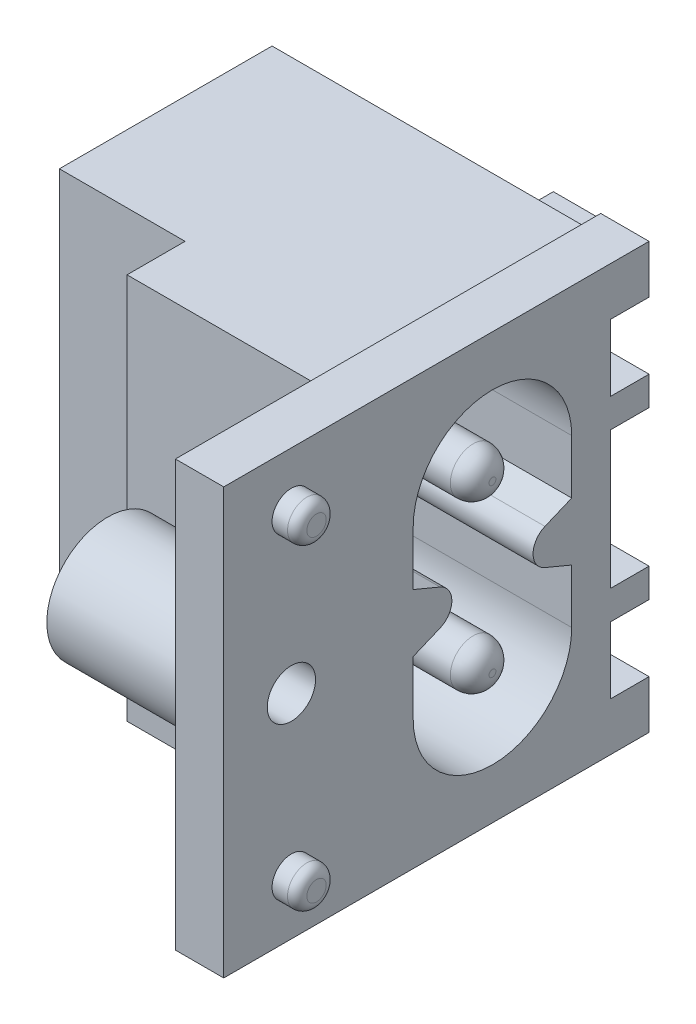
ISO-10303-21;
HEADER;
FILE_DESCRIPTION(('STEP AP214'),'2;1');
FILE_NAME('part.step','',(''),(''),'','','');
FILE_SCHEMA(('AUTOMOTIVE_DESIGN { 1 0 10303 214 1 1 1 1 }'));
ENDSEC;
DATA;
#1=APPLICATION_CONTEXT('core data for automotive mechanical design processes');
#2=APPLICATION_PROTOCOL_DEFINITION('international standard','automotive_design',2000,#1);
#3=PRODUCT_CONTEXT('',#1,'mechanical');
#4=PRODUCT('Part','Part','',(#3));
#5=PRODUCT_RELATED_PRODUCT_CATEGORY('part','',(#4));
#6=PRODUCT_DEFINITION_FORMATION('','',#4);
#7=PRODUCT_DEFINITION_CONTEXT('part definition',#1,'design');
#8=PRODUCT_DEFINITION('design','',#6,#7);
#9=PRODUCT_DEFINITION_SHAPE('','',#8);
#10=(LENGTH_UNIT() NAMED_UNIT(*) SI_UNIT(.MILLI.,.METRE.));
#11=(NAMED_UNIT(*) PLANE_ANGLE_UNIT() SI_UNIT($,.RADIAN.));
#12=(NAMED_UNIT(*) SI_UNIT($,.STERADIAN.) SOLID_ANGLE_UNIT());
#13=UNCERTAINTY_MEASURE_WITH_UNIT(LENGTH_MEASURE(1.E-05),#10,'distance_accuracy_value','');
#14=(GEOMETRIC_REPRESENTATION_CONTEXT(3) GLOBAL_UNCERTAINTY_ASSIGNED_CONTEXT((#13)) GLOBAL_UNIT_ASSIGNED_CONTEXT((#10,
#11,#12)) REPRESENTATION_CONTEXT('',''));
#15=CARTESIAN_POINT('',(0.,0.,0.));
#16=DIRECTION('',(0.,0.,1.));
#17=DIRECTION('',(1.,0.,0.));
#18=AXIS2_PLACEMENT_3D('',#15,#16,#17);
#19=CARTESIAN_POINT('',(0.,11.,22.));
#20=DIRECTION('',(-1.,0.,0.));
#21=DIRECTION('',(0.,-1.,0.));
#22=AXIS2_PLACEMENT_3D('',#19,#20,#21);
#23=PLANE('',#22);
#24=CARTESIAN_POINT('',(0.,8.19125782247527,18.5));
#25=DIRECTION('',(-1.,0.,0.));
#26=DIRECTION('',(0.,-1.,0.));
#27=AXIS2_PLACEMENT_3D('',#24,#25,#26);
#28=CIRCLE('',#27,1.);
#29=CARTESIAN_POINT('',(0.,7.19125782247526,18.5));
#30=VERTEX_POINT('',#29);
#31=EDGE_CURVE('E683',#30,#30,#28,.F.);
#32=ORIENTED_EDGE('',*,*,#31,.F.);
#33=EDGE_LOOP('',(#32));
#34=FACE_BOUND('',#33,.T.);
#35=DIRECTION('',(0.,1.,0.));
#36=VECTOR('',#35,1.);
#37=CARTESIAN_POINT('',(0.,-4.3,4.));
#38=LINE('',#37,#36);
#39=CARTESIAN_POINT('',(0.,-4.3,4.));
#40=VERTEX_POINT('',#39);
#41=CARTESIAN_POINT('',(0.,-1.5,4.));
#42=VERTEX_POINT('',#41);
#43=EDGE_CURVE('E1153',#40,#42,#38,.T.);
#44=ORIENTED_EDGE('',*,*,#43,.F.);
#45=CARTESIAN_POINT('',(0.,-4.3,8.1));
#46=DIRECTION('',(1.,0.,0.));
#47=DIRECTION('',(0.,0.,-1.));
#48=AXIS2_PLACEMENT_3D('',#45,#46,#47);
#49=CIRCLE('',#48,4.1);
#50=CARTESIAN_POINT('',(0.,-4.3,12.2));
#51=VERTEX_POINT('',#50);
#52=EDGE_CURVE('E1113',#51,#40,#49,.T.);
#53=ORIENTED_EDGE('',*,*,#52,.F.);
#54=DIRECTION('',(0.,-1.,0.));
#55=VECTOR('',#54,1.);
#56=CARTESIAN_POINT('',(0.,-4.3,12.2));
#57=LINE('',#56,#55);
#58=CARTESIAN_POINT('',(0.,-1.5,12.2));
#59=VERTEX_POINT('',#58);
#60=EDGE_CURVE('E1118',#59,#51,#57,.T.);
#61=ORIENTED_EDGE('',*,*,#60,.F.);
#62=DIRECTION('',(0.,-0.38461538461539,0.923076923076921));
#63=VECTOR('',#62,1.);
#64=CARTESIAN_POINT('',(0.,-1.5,12.2));
#65=LINE('',#64,#63);
#66=CARTESIAN_POINT('',(0.,-0.92307692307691,10.8153846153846));
#67=VERTEX_POINT('',#66);
#68=EDGE_CURVE('E1180',#67,#59,#65,.T.);
#69=ORIENTED_EDGE('',*,*,#68,.F.);
#70=CARTESIAN_POINT('',(0.,0.,11.2));
#71=DIRECTION('',(-1.,0.,0.));
#72=DIRECTION('',(0.,0.,-1.));
#73=AXIS2_PLACEMENT_3D('',#70,#71,#72);
#74=CIRCLE('',#73,0.999999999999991);
#75=CARTESIAN_POINT('',(0.,0.92307692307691,10.8153846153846));
#76=VERTEX_POINT('',#75);
#77=EDGE_CURVE('E1177',#76,#67,#74,.T.);
#78=ORIENTED_EDGE('',*,*,#77,.F.);
#79=DIRECTION('',(0.,-0.38461538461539,-0.923076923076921));
#80=VECTOR('',#79,1.);
#81=CARTESIAN_POINT('',(0.,0.92307692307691,10.8153846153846));
#82=LINE('',#81,#80);
#83=CARTESIAN_POINT('',(0.,1.5,12.2));
#84=VERTEX_POINT('',#83);
#85=EDGE_CURVE('E1174',#84,#76,#82,.T.);
#86=ORIENTED_EDGE('',*,*,#85,.F.);
#87=DIRECTION('',(0.,-1.,0.));
#88=VECTOR('',#87,1.);
#89=CARTESIAN_POINT('',(0.,1.5,12.2));
#90=LINE('',#89,#88);
#91=CARTESIAN_POINT('',(0.,4.3,12.2));
#92=VERTEX_POINT('',#91);
#93=EDGE_CURVE('E1171',#92,#84,#90,.T.);
#94=ORIENTED_EDGE('',*,*,#93,.F.);
#95=CARTESIAN_POINT('',(0.,4.3,8.1));
#96=DIRECTION('',(1.,0.,0.));
#97=DIRECTION('',(0.,0.,1.));
#98=AXIS2_PLACEMENT_3D('',#95,#96,#97);
#99=CIRCLE('',#98,4.1);
#100=CARTESIAN_POINT('',(0.,4.3,4.));
#101=VERTEX_POINT('',#100);
#102=EDGE_CURVE('E1168',#101,#92,#99,.T.);
#103=ORIENTED_EDGE('',*,*,#102,.F.);
#104=DIRECTION('',(0.,1.,0.));
#105=VECTOR('',#104,1.);
#106=CARTESIAN_POINT('',(0.,1.5,4.));
#107=LINE('',#106,#105);
#108=CARTESIAN_POINT('',(0.,1.5,4.));
#109=VERTEX_POINT('',#108);
#110=EDGE_CURVE('E1165',#109,#101,#107,.T.);
#111=ORIENTED_EDGE('',*,*,#110,.F.);
#112=DIRECTION('',(0.,0.384615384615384,-0.923076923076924));
#113=VECTOR('',#112,1.);
#114=CARTESIAN_POINT('',(0.,0.923076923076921,5.38461538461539));
#115=LINE('',#114,#113);
#116=CARTESIAN_POINT('',(0.,0.923076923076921,5.38461538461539));
#117=VERTEX_POINT('',#116);
#118=EDGE_CURVE('E1162',#117,#109,#115,.T.);
#119=ORIENTED_EDGE('',*,*,#118,.F.);
#120=CARTESIAN_POINT('',(0.,0.,5.));
#121=DIRECTION('',(-1.,0.,0.));
#122=DIRECTION('',(0.,0.,1.));
#123=AXIS2_PLACEMENT_3D('',#120,#121,#122);
#124=CIRCLE('',#123,1.);
#125=CARTESIAN_POINT('',(0.,-0.923076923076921,5.38461538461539));
#126=VERTEX_POINT('',#125);
#127=EDGE_CURVE('E1159',#126,#117,#124,.T.);
#128=ORIENTED_EDGE('',*,*,#127,.F.);
#129=DIRECTION('',(0.,0.384615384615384,0.923076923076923));
#130=VECTOR('',#129,1.);
#131=CARTESIAN_POINT('',(0.,-1.5,4.));
#132=LINE('',#131,#130);
#133=EDGE_CURVE('E1156',#42,#126,#132,.T.);
#134=ORIENTED_EDGE('',*,*,#133,.F.);
#135=EDGE_LOOP('',(#44,#53,#61,#69,#78,#86,#94,#103,#111,#119,#128,#134));
#136=FACE_BOUND('',#135,.T.);
#137=CARTESIAN_POINT('',(0.,0.,18.5));
#138=DIRECTION('',(1.,0.,0.));
#139=DIRECTION('',(0.,0.,-1.));
#140=AXIS2_PLACEMENT_3D('',#137,#138,#139);
#141=CIRCLE('',#140,1.25);
#142=CARTESIAN_POINT('',(0.,0.,17.25));
#143=VERTEX_POINT('',#142);
#144=EDGE_CURVE('E1104',#143,#143,#141,.T.);
#145=ORIENTED_EDGE('',*,*,#144,.F.);
#146=EDGE_LOOP('',(#145));
#147=FACE_BOUND('',#146,.T.);
#148=DIRECTION('',(0.,0.,-1.));
#149=VECTOR('',#148,1.);
#150=CARTESIAN_POINT('',(0.,3.55,2.));
#151=LINE('',#150,#149);
#152=CARTESIAN_POINT('',(0.,3.55,2.));
#153=VERTEX_POINT('',#152);
#154=CARTESIAN_POINT('',(0.,3.55,0.));
#155=VERTEX_POINT('',#154);
#156=EDGE_CURVE('E931',#153,#155,#151,.T.);
#157=ORIENTED_EDGE('',*,*,#156,.T.);
#158=DIRECTION('',(0.,1.,0.));
#159=VECTOR('',#158,1.);
#160=CARTESIAN_POINT('',(0.,11.,0.));
#161=LINE('',#160,#159);
#162=CARTESIAN_POINT('',(0.,5.05,0.));
#163=VERTEX_POINT('',#162);
#164=EDGE_CURVE('E1232',#155,#163,#161,.T.);
#165=ORIENTED_EDGE('',*,*,#164,.T.);
#166=DIRECTION('',(0.,0.,-1.));
#167=VECTOR('',#166,1.);
#168=CARTESIAN_POINT('',(0.,5.05,2.));
#169=LINE('',#168,#167);
#170=CARTESIAN_POINT('',(0.,5.05,2.));
#171=VERTEX_POINT('',#170);
#172=EDGE_CURVE('E1016',#171,#163,#169,.T.);
#173=ORIENTED_EDGE('',*,*,#172,.F.);
#174=DIRECTION('',(0.,1.,0.));
#175=VECTOR('',#174,1.);
#176=CARTESIAN_POINT('',(0.,8.5,2.));
#177=LINE('',#176,#175);
#178=CARTESIAN_POINT('',(0.,8.5,2.));
#179=VERTEX_POINT('',#178);
#180=EDGE_CURVE('E1000',#171,#179,#177,.T.);
#181=ORIENTED_EDGE('',*,*,#180,.T.);
#182=DIRECTION('',(0.,0.,-1.));
#183=VECTOR('',#182,1.);
#184=CARTESIAN_POINT('',(0.,8.5,2.));
#185=LINE('',#184,#183);
#186=CARTESIAN_POINT('',(0.,8.5,0.));
#187=VERTEX_POINT('',#186);
#188=EDGE_CURVE('E1006',#179,#187,#185,.T.);
#189=ORIENTED_EDGE('',*,*,#188,.T.);
#190=CARTESIAN_POINT('',(0.,11.,0.));
#191=VERTEX_POINT('',#190);
#192=EDGE_CURVE('E1226',#187,#191,#161,.T.);
#193=ORIENTED_EDGE('',*,*,#192,.T.);
#194=DIRECTION('',(0.,0.,-1.));
#195=VECTOR('',#194,1.);
#196=CARTESIAN_POINT('',(0.,11.,22.));
#197=LINE('',#196,#195);
#198=CARTESIAN_POINT('',(0.,11.,22.));
#199=VERTEX_POINT('',#198);
#200=EDGE_CURVE('E1257',#199,#191,#197,.T.);
#201=ORIENTED_EDGE('',*,*,#200,.F.);
#202=DIRECTION('',(0.,1.,0.));
#203=VECTOR('',#202,1.);
#204=CARTESIAN_POINT('',(0.,11.,22.));
#205=LINE('',#204,#203);
#206=CARTESIAN_POINT('',(0.,-11.,22.));
#207=VERTEX_POINT('',#206);
#208=EDGE_CURVE('E1216',#207,#199,#205,.T.);
#209=ORIENTED_EDGE('',*,*,#208,.F.);
#210=DIRECTION('',(0.,0.,-1.));
#211=VECTOR('',#210,1.);
#212=CARTESIAN_POINT('',(0.,-11.,22.));
#213=LINE('',#212,#211);
#214=CARTESIAN_POINT('',(0.,-11.,0.));
#215=VERTEX_POINT('',#214);
#216=EDGE_CURVE('E1260',#207,#215,#213,.T.);
#217=ORIENTED_EDGE('',*,*,#216,.T.);
#218=CARTESIAN_POINT('',(0.,-8.5,0.));
#219=VERTEX_POINT('',#218);
#220=EDGE_CURVE('E1227',#215,#219,#161,.T.);
#221=ORIENTED_EDGE('',*,*,#220,.T.);
#222=DIRECTION('',(0.,0.,-1.));
#223=VECTOR('',#222,1.);
#224=CARTESIAN_POINT('',(0.,-8.5,2.));
#225=LINE('',#224,#223);
#226=CARTESIAN_POINT('',(0.,-8.5,2.));
#227=VERTEX_POINT('',#226);
#228=EDGE_CURVE('E991',#227,#219,#225,.T.);
#229=ORIENTED_EDGE('',*,*,#228,.F.);
#230=DIRECTION('',(0.,1.,0.));
#231=VECTOR('',#230,1.);
#232=CARTESIAN_POINT('',(0.,-8.5,2.));
#233=LINE('',#232,#231);
#234=CARTESIAN_POINT('',(0.,-5.05,2.));
#235=VERTEX_POINT('',#234);
#236=EDGE_CURVE('E966',#227,#235,#233,.T.);
#237=ORIENTED_EDGE('',*,*,#236,.T.);
#238=DIRECTION('',(0.,0.,-1.));
#239=VECTOR('',#238,1.);
#240=CARTESIAN_POINT('',(0.,-5.05,2.));
#241=LINE('',#240,#239);
#242=CARTESIAN_POINT('',(0.,-5.05,0.));
#243=VERTEX_POINT('',#242);
#244=EDGE_CURVE('E988',#235,#243,#241,.T.);
#245=ORIENTED_EDGE('',*,*,#244,.T.);
#246=CARTESIAN_POINT('',(0.,-3.55,0.));
#247=VERTEX_POINT('',#246);
#248=EDGE_CURVE('E1231',#243,#247,#161,.T.);
#249=ORIENTED_EDGE('',*,*,#248,.T.);
#250=DIRECTION('',(0.,0.,-1.));
#251=VECTOR('',#250,1.);
#252=CARTESIAN_POINT('',(0.,-3.55,2.));
#253=LINE('',#252,#251);
#254=CARTESIAN_POINT('',(0.,-3.55,2.));
#255=VERTEX_POINT('',#254);
#256=EDGE_CURVE('E950',#255,#247,#253,.T.);
#257=ORIENTED_EDGE('',*,*,#256,.F.);
#258=DIRECTION('',(0.,1.,0.));
#259=VECTOR('',#258,1.);
#260=CARTESIAN_POINT('',(0.,3.55,2.));
#261=LINE('',#260,#259);
#262=EDGE_CURVE('E928',#255,#153,#261,.T.);
#263=ORIENTED_EDGE('',*,*,#262,.T.);
#264=EDGE_LOOP('',(#157,#165,#173,#181,#189,#193,#201,#209,#217,#221,#229,#237,#245,#249,#257,#263));
#265=FACE_BOUND('',#264,.T.);
#266=CARTESIAN_POINT('',(0.,-8.19125782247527,18.5));
#267=DIRECTION('',(-1.,0.,0.));
#268=DIRECTION('',(0.,-1.,0.));
#269=AXIS2_PLACEMENT_3D('',#266,#267,#268);
#270=CIRCLE('',#269,1.);
#271=CARTESIAN_POINT('',(0.,-9.19125782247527,18.5));
#272=VERTEX_POINT('',#271);
#273=EDGE_CURVE('E686',#272,#272,#270,.F.);
#274=ORIENTED_EDGE('',*,*,#273,.F.);
#275=EDGE_LOOP('',(#274));
#276=FACE_BOUND('',#275,.T.);
#277=ADVANCED_FACE('F37',(#34,#136,#147,#265,#276),#23,.F.);
#278=CARTESIAN_POINT('',(-15.7,-3.55,2.));
#279=DIRECTION('',(-1.,0.,0.));
#280=DIRECTION('',(0.,0.,1.));
#281=AXIS2_PLACEMENT_3D('',#278,#279,#280);
#282=PLANE('',#281);
#283=DIRECTION('',(0.,0.,-1.));
#284=VECTOR('',#283,1.);
#285=CARTESIAN_POINT('',(-15.7,-3.8,2.));
#286=LINE('',#285,#284);
#287=CARTESIAN_POINT('',(-15.7,-3.8,2.));
#288=VERTEX_POINT('',#287);
#289=CARTESIAN_POINT('',(-15.7,-3.8,0.));
#290=VERTEX_POINT('',#289);
#291=EDGE_CURVE('E624',#288,#290,#286,.T.);
#292=ORIENTED_EDGE('',*,*,#291,.F.);
#293=DIRECTION('',(0.,1.,0.));
#294=VECTOR('',#293,1.);
#295=CARTESIAN_POINT('',(-15.7,-3.55,2.));
#296=LINE('',#295,#294);
#297=CARTESIAN_POINT('',(-15.7,-3.55,2.));
#298=VERTEX_POINT('',#297);
#299=EDGE_CURVE('E607',#288,#298,#296,.T.);
#300=ORIENTED_EDGE('',*,*,#299,.T.);
#301=DIRECTION('',(0.,0.,-1.));
#302=VECTOR('',#301,1.);
#303=CARTESIAN_POINT('',(-15.7,-3.55,2.));
#304=LINE('',#303,#302);
#305=CARTESIAN_POINT('',(-15.7,-3.55,0.));
#306=VERTEX_POINT('',#305);
#307=EDGE_CURVE('E901',#298,#306,#304,.T.);
#308=ORIENTED_EDGE('',*,*,#307,.T.);
#309=DIRECTION('',(0.,1.,0.));
#310=VECTOR('',#309,1.);
#311=CARTESIAN_POINT('',(-15.7,-3.55,0.));
#312=LINE('',#311,#310);
#313=EDGE_CURVE('E1394',#290,#306,#312,.T.);
#314=ORIENTED_EDGE('',*,*,#313,.F.);
#315=EDGE_LOOP('',(#292,#300,#308,#314));
#316=FACE_BOUND('',#315,.T.);
#317=ADVANCED_FACE('F708',(#316),#282,.T.);
#318=CARTESIAN_POINT('',(-15.7,5.05,2.));
#319=DIRECTION('',(-1.,0.,0.));
#320=DIRECTION('',(0.,0.,1.));
#321=AXIS2_PLACEMENT_3D('',#318,#319,#320);
#322=PLANE('',#321);
#323=DIRECTION('',(0.,0.,-1.));
#324=VECTOR('',#323,1.);
#325=CARTESIAN_POINT('',(-15.7,4.8,2.));
#326=LINE('',#325,#324);
#327=CARTESIAN_POINT('',(-15.7,4.8,2.));
#328=VERTEX_POINT('',#327);
#329=CARTESIAN_POINT('',(-15.7,4.8,0.));
#330=VERTEX_POINT('',#329);
#331=EDGE_CURVE('E864',#328,#330,#326,.T.);
#332=ORIENTED_EDGE('',*,*,#331,.F.);
#333=DIRECTION('',(0.,1.,0.));
#334=VECTOR('',#333,1.);
#335=CARTESIAN_POINT('',(-15.7,5.05,2.));
#336=LINE('',#335,#334);
#337=CARTESIAN_POINT('',(-15.7,5.05,2.));
#338=VERTEX_POINT('',#337);
#339=EDGE_CURVE('E907',#328,#338,#336,.T.);
#340=ORIENTED_EDGE('',*,*,#339,.T.);
#341=DIRECTION('',(0.,0.,-1.));
#342=VECTOR('',#341,1.);
#343=CARTESIAN_POINT('',(-15.7,5.05,2.));
#344=LINE('',#343,#342);
#345=CARTESIAN_POINT('',(-15.7,5.05,0.));
#346=VERTEX_POINT('',#345);
#347=EDGE_CURVE('E910',#338,#346,#344,.T.);
#348=ORIENTED_EDGE('',*,*,#347,.T.);
#349=DIRECTION('',(0.,1.,0.));
#350=VECTOR('',#349,1.);
#351=CARTESIAN_POINT('',(-15.7,5.05,0.));
#352=LINE('',#351,#350);
#353=EDGE_CURVE('E897',#330,#346,#352,.T.);
#354=ORIENTED_EDGE('',*,*,#353,.F.);
#355=EDGE_LOOP('',(#332,#340,#348,#354));
#356=FACE_BOUND('',#355,.T.);
#357=ADVANCED_FACE('F716',(#356),#322,.T.);
#358=CARTESIAN_POINT('',(0.,0.,2.));
#359=DIRECTION('',(0.,0.,1.));
#360=DIRECTION('',(1.,0.,0.));
#361=AXIS2_PLACEMENT_3D('',#358,#359,#360);
#362=PLANE('',#361);
#363=DIRECTION('',(0.,-1.,0.));
#364=VECTOR('',#363,1.);
#365=CARTESIAN_POINT('',(-13.31,0.,2.));
#366=LINE('',#365,#364);
#367=CARTESIAN_POINT('',(-13.31,-6.5,2.));
#368=VERTEX_POINT('',#367);
#369=CARTESIAN_POINT('',(-13.31,-8.5,2.));
#370=VERTEX_POINT('',#369);
#371=EDGE_CURVE('E1366',#368,#370,#366,.T.);
#372=ORIENTED_EDGE('',*,*,#371,.F.);
#373=DIRECTION('',(0.,-1.,0.));
#374=VECTOR('',#373,1.);
#375=CARTESIAN_POINT('',(-13.31,-5.05,2.));
#376=LINE('',#375,#374);
#377=CARTESIAN_POINT('',(-13.31,-5.05,2.));
#378=VERTEX_POINT('',#377);
#379=EDGE_CURVE('E972',#378,#368,#376,.T.);
#380=ORIENTED_EDGE('',*,*,#379,.F.);
#381=DIRECTION('',(-1.,0.,0.));
#382=VECTOR('',#381,1.);
#383=CARTESIAN_POINT('',(0.,-5.05,2.));
#384=LINE('',#383,#382);
#385=EDGE_CURVE('E970',#235,#378,#384,.T.);
#386=ORIENTED_EDGE('',*,*,#385,.F.);
#387=ORIENTED_EDGE('',*,*,#236,.F.);
#388=DIRECTION('',(1.,0.,0.));
#389=VECTOR('',#388,1.);
#390=CARTESIAN_POINT('',(-17.81,-8.5,2.));
#391=LINE('',#390,#389);
#392=EDGE_CURVE('E964',#370,#227,#391,.T.);
#393=ORIENTED_EDGE('',*,*,#392,.F.);
#394=EDGE_LOOP('',(#372,#380,#386,#387,#393));
#395=FACE_BOUND('',#394,.T.);
#396=DIRECTION('',(0.,1.,0.));
#397=VECTOR('',#396,1.);
#398=CARTESIAN_POINT('',(-5.3,-7.4,2.));
#399=LINE('',#398,#397);
#400=CARTESIAN_POINT('',(-5.3,-7.4,2.));
#401=VERTEX_POINT('',#400);
#402=CARTESIAN_POINT('',(-5.3,-6.4,2.));
#403=VERTEX_POINT('',#402);
#404=EDGE_CURVE('E844',#401,#403,#399,.T.);
#405=ORIENTED_EDGE('',*,*,#404,.T.);
#406=DIRECTION('',(-1.,0.,0.));
#407=VECTOR('',#406,1.);
#408=CARTESIAN_POINT('',(-5.3,-6.4,2.));
#409=LINE('',#408,#407);
#410=CARTESIAN_POINT('',(-8.3,-6.4,2.));
#411=VERTEX_POINT('',#410);
#412=EDGE_CURVE('E2661',#403,#411,#409,.T.);
#413=ORIENTED_EDGE('',*,*,#412,.T.);
#414=DIRECTION('',(0.,-1.,0.));
#415=VECTOR('',#414,1.);
#416=CARTESIAN_POINT('',(-8.3,-7.4,2.));
#417=LINE('',#416,#415);
#418=CARTESIAN_POINT('',(-8.3,-7.4,2.));
#419=VERTEX_POINT('',#418);
#420=EDGE_CURVE('E2669',#411,#419,#417,.T.);
#421=ORIENTED_EDGE('',*,*,#420,.T.);
#422=DIRECTION('',(1.,0.,0.));
#423=VECTOR('',#422,1.);
#424=CARTESIAN_POINT('',(-5.3,-7.4,2.));
#425=LINE('',#424,#423);
#426=EDGE_CURVE('E2664',#419,#401,#425,.T.);
#427=ORIENTED_EDGE('',*,*,#426,.T.);
#428=EDGE_LOOP('',(#405,#413,#421,#427));
#429=FACE_BOUND('',#428,.T.);
#430=ADVANCED_FACE('F1580',(#395,#429),#362,.F.);
#431=CARTESIAN_POINT('',(0.,0.,2.));
#432=DIRECTION('',(0.,0.,-1.));
#433=DIRECTION('',(-1.,0.,0.));
#434=AXIS2_PLACEMENT_3D('',#431,#432,#433);
#435=PLANE('',#434);
#436=DIRECTION('',(0.,-1.,0.));
#437=VECTOR('',#436,1.);
#438=CARTESIAN_POINT('',(-13.31,0.,2.));
#439=LINE('',#438,#437);
#440=CARTESIAN_POINT('',(-13.31,8.5,2.));
#441=VERTEX_POINT('',#440);
#442=CARTESIAN_POINT('',(-13.31,6.5,2.));
#443=VERTEX_POINT('',#442);
#444=EDGE_CURVE('E1393',#441,#443,#439,.T.);
#445=ORIENTED_EDGE('',*,*,#444,.F.);
#446=DIRECTION('',(-1.,0.,0.));
#447=VECTOR('',#446,1.);
#448=CARTESIAN_POINT('',(-17.81,8.5,2.));
#449=LINE('',#448,#447);
#450=EDGE_CURVE('E1003',#179,#441,#449,.T.);
#451=ORIENTED_EDGE('',*,*,#450,.F.);
#452=ORIENTED_EDGE('',*,*,#180,.F.);
#453=DIRECTION('',(1.,0.,0.));
#454=VECTOR('',#453,1.);
#455=CARTESIAN_POINT('',(0.,5.05,2.));
#456=LINE('',#455,#454);
#457=CARTESIAN_POINT('',(-13.31,5.05,2.));
#458=VERTEX_POINT('',#457);
#459=EDGE_CURVE('E997',#458,#171,#456,.T.);
#460=ORIENTED_EDGE('',*,*,#459,.F.);
#461=DIRECTION('',(0.,-1.,0.));
#462=VECTOR('',#461,1.);
#463=CARTESIAN_POINT('',(-13.31,5.05,2.));
#464=LINE('',#463,#462);
#465=EDGE_CURVE('E995',#443,#458,#464,.T.);
#466=ORIENTED_EDGE('',*,*,#465,.F.);
#467=EDGE_LOOP('',(#445,#451,#452,#460,#466));
#468=FACE_BOUND('',#467,.T.);
#469=DIRECTION('',(1.,0.,0.));
#470=VECTOR('',#469,1.);
#471=CARTESIAN_POINT('',(-5.3,6.4,2.));
#472=LINE('',#471,#470);
#473=CARTESIAN_POINT('',(-8.3,6.4,2.));
#474=VERTEX_POINT('',#473);
#475=CARTESIAN_POINT('',(-5.3,6.4,2.));
#476=VERTEX_POINT('',#475);
#477=EDGE_CURVE('E1317',#474,#476,#472,.T.);
#478=ORIENTED_EDGE('',*,*,#477,.T.);
#479=DIRECTION('',(0.,1.,0.));
#480=VECTOR('',#479,1.);
#481=CARTESIAN_POINT('',(-5.3,7.4,2.));
#482=LINE('',#481,#480);
#483=CARTESIAN_POINT('',(-5.3,7.4,2.));
#484=VERTEX_POINT('',#483);
#485=EDGE_CURVE('E1323',#476,#484,#482,.T.);
#486=ORIENTED_EDGE('',*,*,#485,.T.);
#487=DIRECTION('',(-1.,0.,0.));
#488=VECTOR('',#487,1.);
#489=CARTESIAN_POINT('',(-5.3,7.4,2.));
#490=LINE('',#489,#488);
#491=CARTESIAN_POINT('',(-8.3,7.4,2.));
#492=VERTEX_POINT('',#491);
#493=EDGE_CURVE('E1332',#484,#492,#490,.T.);
#494=ORIENTED_EDGE('',*,*,#493,.T.);
#495=DIRECTION('',(0.,-1.,0.));
#496=VECTOR('',#495,1.);
#497=CARTESIAN_POINT('',(-8.3,7.4,2.));
#498=LINE('',#497,#496);
#499=EDGE_CURVE('E1335',#492,#474,#498,.T.);
#500=ORIENTED_EDGE('',*,*,#499,.T.);
#501=EDGE_LOOP('',(#478,#486,#494,#500));
#502=FACE_BOUND('',#501,.T.);
#503=ADVANCED_FACE('F1554',(#468,#502),#435,.T.);
#504=CARTESIAN_POINT('',(0.,0.,2.));
#505=DIRECTION('',(0.,0.,-1.));
#506=DIRECTION('',(-1.,0.,0.));
#507=AXIS2_PLACEMENT_3D('',#504,#505,#506);
#508=PLANE('',#507);
#509=DIRECTION('',(0.,1.,0.));
#510=VECTOR('',#509,1.);
#511=CARTESIAN_POINT('',(-13.31,0.,2.));
#512=LINE('',#511,#510);
#513=CARTESIAN_POINT('',(-13.31,-2.1,2.));
#514=VERTEX_POINT('',#513);
#515=CARTESIAN_POINT('',(-13.31,-0.750000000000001,2.));
#516=VERTEX_POINT('',#515);
#517=EDGE_CURVE('E1368',#514,#516,#512,.T.);
#518=ORIENTED_EDGE('',*,*,#517,.T.);
#519=DIRECTION('',(-1.,0.,0.));
#520=VECTOR('',#519,1.);
#521=CARTESIAN_POINT('',(-19.5,-0.75,2.));
#522=LINE('',#521,#520);
#523=CARTESIAN_POINT('',(-19.5,-0.75,2.));
#524=VERTEX_POINT('',#523);
#525=EDGE_CURVE('E961',#516,#524,#522,.T.);
#526=ORIENTED_EDGE('',*,*,#525,.T.);
#527=DIRECTION('',(0.,-1.,0.));
#528=VECTOR('',#527,1.);
#529=CARTESIAN_POINT('',(-19.5,-2.1,2.));
#530=LINE('',#529,#528);
#531=CARTESIAN_POINT('',(-19.5,0.75,2.));
#532=VERTEX_POINT('',#531);
#533=EDGE_CURVE('E921',#532,#524,#530,.T.);
#534=ORIENTED_EDGE('',*,*,#533,.F.);
#535=DIRECTION('',(1.,0.,0.));
#536=VECTOR('',#535,1.);
#537=CARTESIAN_POINT('',(-19.5,0.75,2.));
#538=LINE('',#537,#536);
#539=CARTESIAN_POINT('',(-13.31,0.750000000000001,2.));
#540=VERTEX_POINT('',#539);
#541=EDGE_CURVE('E1285',#532,#540,#538,.T.);
#542=ORIENTED_EDGE('',*,*,#541,.T.);
#543=DIRECTION('',(0.,-1.,0.));
#544=VECTOR('',#543,1.);
#545=CARTESIAN_POINT('',(-13.31,0.,2.));
#546=LINE('',#545,#544);
#547=CARTESIAN_POINT('',(-13.31,2.09999999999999,2.));
#548=VERTEX_POINT('',#547);
#549=EDGE_CURVE('E1305',#548,#540,#546,.T.);
#550=ORIENTED_EDGE('',*,*,#549,.F.);
#551=DIRECTION('',(0.,-1.,0.));
#552=VECTOR('',#551,1.);
#553=CARTESIAN_POINT('',(-13.31,2.09999999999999,2.));
#554=LINE('',#553,#552);
#555=CARTESIAN_POINT('',(-13.31,3.55,2.));
#556=VERTEX_POINT('',#555);
#557=EDGE_CURVE('E917',#556,#548,#554,.T.);
#558=ORIENTED_EDGE('',*,*,#557,.F.);
#559=DIRECTION('',(-1.,0.,0.));
#560=VECTOR('',#559,1.);
#561=CARTESIAN_POINT('',(-13.31,3.55,2.));
#562=LINE('',#561,#560);
#563=EDGE_CURVE('E914',#153,#556,#562,.T.);
#564=ORIENTED_EDGE('',*,*,#563,.F.);
#565=ORIENTED_EDGE('',*,*,#262,.F.);
#566=DIRECTION('',(1.,0.,0.));
#567=VECTOR('',#566,1.);
#568=CARTESIAN_POINT('',(0.,-3.55,2.));
#569=LINE('',#568,#567);
#570=CARTESIAN_POINT('',(-13.31,-3.55,2.));
#571=VERTEX_POINT('',#570);
#572=EDGE_CURVE('E926',#571,#255,#569,.T.);
#573=ORIENTED_EDGE('',*,*,#572,.F.);
#574=DIRECTION('',(0.,-1.,0.));
#575=VECTOR('',#574,1.);
#576=CARTESIAN_POINT('',(-13.31,-3.55,2.));
#577=LINE('',#576,#575);
#578=EDGE_CURVE('E924',#514,#571,#577,.T.);
#579=ORIENTED_EDGE('',*,*,#578,.F.);
#580=EDGE_LOOP('',(#518,#526,#534,#542,#550,#558,#564,#565,#573,#579));
#581=FACE_BOUND('',#580,.T.);
#582=ADVANCED_FACE('F1550',(#581),#508,.T.);
#583=CARTESIAN_POINT('',(-17.81,0.,0.));
#584=DIRECTION('',(1.,0.,0.));
#585=DIRECTION('',(0.,0.,-1.));
#586=AXIS2_PLACEMENT_3D('',#583,#584,#585);
#587=PLANE('',#586);
#588=DIRECTION('',(0.,0.,-1.));
#589=VECTOR('',#588,1.);
#590=CARTESIAN_POINT('',(-17.81,-6.5,2.));
#591=LINE('',#590,#589);
#592=CARTESIAN_POINT('',(-17.81,-6.5,7.));
#593=VERTEX_POINT('',#592);
#594=CARTESIAN_POINT('',(-17.81,-6.5,0.));
#595=VERTEX_POINT('',#594);
#596=EDGE_CURVE('E975',#593,#595,#591,.T.);
#597=ORIENTED_EDGE('',*,*,#596,.F.);
#598=DIRECTION('',(0.,-1.,0.));
#599=VECTOR('',#598,1.);
#600=CARTESIAN_POINT('',(-17.81,0.,7.));
#601=LINE('',#600,#599);
#602=CARTESIAN_POINT('',(-17.81,-2.1,7.));
#603=VERTEX_POINT('',#602);
#604=EDGE_CURVE('E865',#603,#593,#601,.T.);
#605=ORIENTED_EDGE('',*,*,#604,.F.);
#606=DIRECTION('',(0.,0.,1.));
#607=VECTOR('',#606,1.);
#608=CARTESIAN_POINT('',(-17.81,-2.1,0.));
#609=LINE('',#608,#607);
#610=CARTESIAN_POINT('',(-17.81,-2.1,0.));
#611=VERTEX_POINT('',#610);
#612=EDGE_CURVE('E1289',#611,#603,#609,.T.);
#613=ORIENTED_EDGE('',*,*,#612,.F.);
#614=DIRECTION('',(0.,1.,0.));
#615=VECTOR('',#614,1.);
#616=CARTESIAN_POINT('',(-17.81,-8.5,0.));
#617=LINE('',#616,#615);
#618=CARTESIAN_POINT('',(-17.81,-3.55,0.));
#619=VERTEX_POINT('',#618);
#620=EDGE_CURVE('E1048',#619,#611,#617,.T.);
#621=ORIENTED_EDGE('',*,*,#620,.F.);
#622=DIRECTION('',(0.,0.,-1.));
#623=VECTOR('',#622,1.);
#624=CARTESIAN_POINT('',(-17.81,-3.55,0.));
#625=LINE('',#624,#623);
#626=CARTESIAN_POINT('',(-17.81,-3.55,2.));
#627=VERTEX_POINT('',#626);
#628=EDGE_CURVE('E1303',#627,#619,#625,.T.);
#629=ORIENTED_EDGE('',*,*,#628,.F.);
#630=DIRECTION('',(0.,1.,0.));
#631=VECTOR('',#630,1.);
#632=CARTESIAN_POINT('',(-17.81,0.,2.));
#633=LINE('',#632,#631);
#634=CARTESIAN_POINT('',(-17.81,-5.05,2.));
#635=VERTEX_POINT('',#634);
#636=EDGE_CURVE('E1298',#635,#627,#633,.T.);
#637=ORIENTED_EDGE('',*,*,#636,.F.);
#638=DIRECTION('',(0.,0.,1.));
#639=VECTOR('',#638,1.);
#640=CARTESIAN_POINT('',(-17.81,-5.05,0.));
#641=LINE('',#640,#639);
#642=CARTESIAN_POINT('',(-17.81,-5.05,0.));
#643=VERTEX_POINT('',#642);
#644=EDGE_CURVE('E1300',#643,#635,#641,.T.);
#645=ORIENTED_EDGE('',*,*,#644,.F.);
#646=EDGE_CURVE('E1031',#595,#643,#617,.T.);
#647=ORIENTED_EDGE('',*,*,#646,.F.);
#648=EDGE_LOOP('',(#597,#605,#613,#621,#629,#637,#645,#647));
#649=FACE_BOUND('',#648,.T.);
#650=ADVANCED_FACE('F1553',(#649),#587,.F.);
#651=DIRECTION('',(0.,0.,-1.));
#652=VECTOR('',#651,1.);
#653=CARTESIAN_POINT('',(-17.81,2.09999999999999,0.));
#654=LINE('',#653,#652);
#655=CARTESIAN_POINT('',(-17.81,2.09999999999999,7.));
#656=VERTEX_POINT('',#655);
#657=CARTESIAN_POINT('',(-17.81,2.09999999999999,0.));
#658=VERTEX_POINT('',#657);
#659=EDGE_CURVE('E1287',#656,#658,#654,.T.);
#660=ORIENTED_EDGE('',*,*,#659,.F.);
#661=DIRECTION('',(0.,-1.,0.));
#662=VECTOR('',#661,1.);
#663=CARTESIAN_POINT('',(-17.81,0.,7.));
#664=LINE('',#663,#662);
#665=CARTESIAN_POINT('',(-17.81,6.5,7.));
#666=VERTEX_POINT('',#665);
#667=EDGE_CURVE('E1308',#666,#656,#664,.T.);
#668=ORIENTED_EDGE('',*,*,#667,.F.);
#669=DIRECTION('',(0.,0.,-1.));
#670=VECTOR('',#669,1.);
#671=CARTESIAN_POINT('',(-17.81,6.5,2.));
#672=LINE('',#671,#670);
#673=CARTESIAN_POINT('',(-17.81,6.5,0.));
#674=VERTEX_POINT('',#673);
#675=EDGE_CURVE('E1023',#666,#674,#672,.T.);
#676=ORIENTED_EDGE('',*,*,#675,.T.);
#677=CARTESIAN_POINT('',(-17.81,5.05,0.));
#678=VERTEX_POINT('',#677);
#679=EDGE_CURVE('E1026',#678,#674,#617,.T.);
#680=ORIENTED_EDGE('',*,*,#679,.F.);
#681=DIRECTION('',(0.,0.,-1.));
#682=VECTOR('',#681,1.);
#683=CARTESIAN_POINT('',(-17.81,5.05,0.));
#684=LINE('',#683,#682);
#685=CARTESIAN_POINT('',(-17.81,5.05,2.));
#686=VERTEX_POINT('',#685);
#687=EDGE_CURVE('E1296',#686,#678,#684,.T.);
#688=ORIENTED_EDGE('',*,*,#687,.F.);
#689=DIRECTION('',(0.,1.,0.));
#690=VECTOR('',#689,1.);
#691=CARTESIAN_POINT('',(-17.81,0.,2.));
#692=LINE('',#691,#690);
#693=CARTESIAN_POINT('',(-17.81,3.55,2.));
#694=VERTEX_POINT('',#693);
#695=EDGE_CURVE('E1291',#694,#686,#692,.T.);
#696=ORIENTED_EDGE('',*,*,#695,.F.);
#697=DIRECTION('',(0.,0.,1.));
#698=VECTOR('',#697,1.);
#699=CARTESIAN_POINT('',(-17.81,3.55,0.));
#700=LINE('',#699,#698);
#701=CARTESIAN_POINT('',(-17.81,3.55,0.));
#702=VERTEX_POINT('',#701);
#703=EDGE_CURVE('E1293',#702,#694,#700,.T.);
#704=ORIENTED_EDGE('',*,*,#703,.F.);
#705=EDGE_CURVE('E1049',#658,#702,#617,.T.);
#706=ORIENTED_EDGE('',*,*,#705,.F.);
#707=EDGE_LOOP('',(#660,#668,#676,#680,#688,#696,#704,#706));
#708=FACE_BOUND('',#707,.T.);
#709=ADVANCED_FACE('F1422',(#708),#587,.F.);
#710=CARTESIAN_POINT('',(0.,0.,0.));
#711=DIRECTION('',(0.,0.,1.));
#712=DIRECTION('',(1.,0.,0.));
#713=AXIS2_PLACEMENT_3D('',#710,#711,#712);
#714=PLANE('',#713);
#715=DIRECTION('',(0.,1.,0.));
#716=VECTOR('',#715,1.);
#717=CARTESIAN_POINT('',(-15.575,0.,0.));
#718=LINE('',#717,#716);
#719=CARTESIAN_POINT('',(-15.575,-4.8,0.));
#720=VERTEX_POINT('',#719);
#721=CARTESIAN_POINT('',(-15.575,-3.8,0.));
#722=VERTEX_POINT('',#721);
#723=EDGE_CURVE('E635',#720,#722,#718,.T.);
#724=ORIENTED_EDGE('',*,*,#723,.T.);
#725=DIRECTION('',(-1.,0.,0.));
#726=VECTOR('',#725,1.);
#727=CARTESIAN_POINT('',(0.,-3.8,0.));
#728=LINE('',#727,#726);
#729=EDGE_CURVE('E791',#722,#290,#728,.T.);
#730=ORIENTED_EDGE('',*,*,#729,.T.);
#731=ORIENTED_EDGE('',*,*,#313,.T.);
#732=DIRECTION('',(-1.,0.,0.));
#733=VECTOR('',#732,1.);
#734=CARTESIAN_POINT('',(-15.7,-3.55,0.));
#735=LINE('',#734,#733);
#736=EDGE_CURVE('E1402',#306,#619,#735,.T.);
#737=ORIENTED_EDGE('',*,*,#736,.T.);
#738=ORIENTED_EDGE('',*,*,#620,.T.);
#739=DIRECTION('',(1.,0.,0.));
#740=VECTOR('',#739,1.);
#741=CARTESIAN_POINT('',(-13.31,-2.1,0.));
#742=LINE('',#741,#740);
#743=CARTESIAN_POINT('',(-13.31,-2.1,0.));
#744=VERTEX_POINT('',#743);
#745=EDGE_CURVE('E940',#611,#744,#742,.T.);
#746=ORIENTED_EDGE('',*,*,#745,.T.);
#747=DIRECTION('',(0.,-1.,0.));
#748=VECTOR('',#747,1.);
#749=CARTESIAN_POINT('',(-13.31,-3.55,0.));
#750=LINE('',#749,#748);
#751=CARTESIAN_POINT('',(-13.31,-3.55,0.));
#752=VERTEX_POINT('',#751);
#753=EDGE_CURVE('E943',#744,#752,#750,.T.);
#754=ORIENTED_EDGE('',*,*,#753,.T.);
#755=DIRECTION('',(1.,0.,0.));
#756=VECTOR('',#755,1.);
#757=CARTESIAN_POINT('',(0.,-3.55,0.));
#758=LINE('',#757,#756);
#759=EDGE_CURVE('E918',#752,#247,#758,.T.);
#760=ORIENTED_EDGE('',*,*,#759,.T.);
#761=ORIENTED_EDGE('',*,*,#248,.F.);
#762=DIRECTION('',(-1.,0.,0.));
#763=VECTOR('',#762,1.);
#764=CARTESIAN_POINT('',(0.,-5.05,0.));
#765=LINE('',#764,#763);
#766=CARTESIAN_POINT('',(-13.31,-5.05,0.));
#767=VERTEX_POINT('',#766);
#768=EDGE_CURVE('E963',#243,#767,#765,.T.);
#769=ORIENTED_EDGE('',*,*,#768,.T.);
#770=DIRECTION('',(0.,-1.,0.));
#771=VECTOR('',#770,1.);
#772=CARTESIAN_POINT('',(-13.31,-5.05,0.));
#773=LINE('',#772,#771);
#774=CARTESIAN_POINT('',(-13.31,-6.5,0.));
#775=VERTEX_POINT('',#774);
#776=EDGE_CURVE('E978',#767,#775,#773,.T.);
#777=ORIENTED_EDGE('',*,*,#776,.T.);
#778=DIRECTION('',(-1.,0.,0.));
#779=VECTOR('',#778,1.);
#780=CARTESIAN_POINT('',(-13.31,-6.5,0.));
#781=LINE('',#780,#779);
#782=EDGE_CURVE('E967',#775,#595,#781,.T.);
#783=ORIENTED_EDGE('',*,*,#782,.T.);
#784=ORIENTED_EDGE('',*,*,#646,.T.);
#785=DIRECTION('',(1.,0.,0.));
#786=VECTOR('',#785,1.);
#787=CARTESIAN_POINT('',(-15.7,-5.05,0.));
#788=LINE('',#787,#786);
#789=CARTESIAN_POINT('',(-15.7,-5.05,0.));
#790=VERTEX_POINT('',#789);
#791=EDGE_CURVE('E1405',#643,#790,#788,.T.);
#792=ORIENTED_EDGE('',*,*,#791,.T.);
#793=CARTESIAN_POINT('',(-15.7,-4.8,0.));
#794=VERTEX_POINT('',#793);
#795=EDGE_CURVE('E1400',#790,#794,#312,.T.);
#796=ORIENTED_EDGE('',*,*,#795,.T.);
#797=DIRECTION('',(1.,0.,0.));
#798=VECTOR('',#797,1.);
#799=CARTESIAN_POINT('',(0.,-4.8,0.));
#800=LINE('',#799,#798);
#801=EDGE_CURVE('E618',#794,#720,#800,.T.);
#802=ORIENTED_EDGE('',*,*,#801,.T.);
#803=EDGE_LOOP('',(#724,#730,#731,#737,#738,#746,#754,#760,#761,#769,#777,#783,#784,#792,#796,#802));
#804=FACE_BOUND('',#803,.T.);
#805=ADVANCED_FACE('F1734',(#804),#714,.F.);
#806=DIRECTION('',(0.,1.,0.));
#807=VECTOR('',#806,1.);
#808=CARTESIAN_POINT('',(-15.575,0.,0.));
#809=LINE('',#808,#807);
#810=CARTESIAN_POINT('',(-15.575,3.8,0.));
#811=VERTEX_POINT('',#810);
#812=CARTESIAN_POINT('',(-15.575,4.8,0.));
#813=VERTEX_POINT('',#812);
#814=EDGE_CURVE('E625',#811,#813,#809,.T.);
#815=ORIENTED_EDGE('',*,*,#814,.T.);
#816=DIRECTION('',(-1.,0.,0.));
#817=VECTOR('',#816,1.);
#818=CARTESIAN_POINT('',(0.,4.8,0.));
#819=LINE('',#818,#817);
#820=EDGE_CURVE('E816',#813,#330,#819,.T.);
#821=ORIENTED_EDGE('',*,*,#820,.T.);
#822=ORIENTED_EDGE('',*,*,#353,.T.);
#823=DIRECTION('',(-1.,0.,0.));
#824=VECTOR('',#823,1.);
#825=CARTESIAN_POINT('',(-15.7,5.05,0.));
#826=LINE('',#825,#824);
#827=EDGE_CURVE('E896',#346,#678,#826,.T.);
#828=ORIENTED_EDGE('',*,*,#827,.T.);
#829=ORIENTED_EDGE('',*,*,#679,.T.);
#830=DIRECTION('',(1.,0.,0.));
#831=VECTOR('',#830,1.);
#832=CARTESIAN_POINT('',(-13.31,6.5,0.));
#833=LINE('',#832,#831);
#834=CARTESIAN_POINT('',(-13.31,6.5,0.));
#835=VERTEX_POINT('',#834);
#836=EDGE_CURVE('E994',#674,#835,#833,.T.);
#837=ORIENTED_EDGE('',*,*,#836,.T.);
#838=DIRECTION('',(0.,-1.,0.));
#839=VECTOR('',#838,1.);
#840=CARTESIAN_POINT('',(-13.31,5.05,0.));
#841=LINE('',#840,#839);
#842=CARTESIAN_POINT('',(-13.31,5.05,0.));
#843=VERTEX_POINT('',#842);
#844=EDGE_CURVE('E1009',#835,#843,#841,.T.);
#845=ORIENTED_EDGE('',*,*,#844,.T.);
#846=DIRECTION('',(1.,0.,0.));
#847=VECTOR('',#846,1.);
#848=CARTESIAN_POINT('',(0.,5.05,0.));
#849=LINE('',#848,#847);
#850=EDGE_CURVE('E998',#843,#163,#849,.T.);
#851=ORIENTED_EDGE('',*,*,#850,.T.);
#852=ORIENTED_EDGE('',*,*,#164,.F.);
#853=DIRECTION('',(-1.,0.,0.));
#854=VECTOR('',#853,1.);
#855=CARTESIAN_POINT('',(-13.31,3.55,0.));
#856=LINE('',#855,#854);
#857=CARTESIAN_POINT('',(-13.31,3.55,0.));
#858=VERTEX_POINT('',#857);
#859=EDGE_CURVE('E913',#155,#858,#856,.T.);
#860=ORIENTED_EDGE('',*,*,#859,.T.);
#861=DIRECTION('',(0.,-1.,0.));
#862=VECTOR('',#861,1.);
#863=CARTESIAN_POINT('',(-13.31,2.09999999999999,0.));
#864=LINE('',#863,#862);
#865=CARTESIAN_POINT('',(-13.31,2.09999999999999,0.));
#866=VERTEX_POINT('',#865);
#867=EDGE_CURVE('E934',#858,#866,#864,.T.);
#868=ORIENTED_EDGE('',*,*,#867,.T.);
#869=DIRECTION('',(-1.,0.,0.));
#870=VECTOR('',#869,1.);
#871=CARTESIAN_POINT('',(-19.5,2.09999999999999,0.));
#872=LINE('',#871,#870);
#873=EDGE_CURVE('E937',#866,#658,#872,.T.);
#874=ORIENTED_EDGE('',*,*,#873,.T.);
#875=ORIENTED_EDGE('',*,*,#705,.T.);
#876=DIRECTION('',(1.,0.,0.));
#877=VECTOR('',#876,1.);
#878=CARTESIAN_POINT('',(-15.7,3.55,0.));
#879=LINE('',#878,#877);
#880=CARTESIAN_POINT('',(-15.7,3.55,0.));
#881=VERTEX_POINT('',#880);
#882=EDGE_CURVE('E895',#702,#881,#879,.T.);
#883=ORIENTED_EDGE('',*,*,#882,.T.);
#884=CARTESIAN_POINT('',(-15.7,3.8,0.));
#885=VERTEX_POINT('',#884);
#886=EDGE_CURVE('E888',#881,#885,#352,.T.);
#887=ORIENTED_EDGE('',*,*,#886,.T.);
#888=DIRECTION('',(1.,0.,0.));
#889=VECTOR('',#888,1.);
#890=CARTESIAN_POINT('',(0.,3.8,0.));
#891=LINE('',#890,#889);
#892=EDGE_CURVE('E810',#885,#811,#891,.T.);
#893=ORIENTED_EDGE('',*,*,#892,.T.);
#894=EDGE_LOOP('',(#815,#821,#822,#828,#829,#837,#845,#851,#852,#860,#868,#874,#875,#883,#887,#893));
#895=FACE_BOUND('',#894,.T.);
#896=ADVANCED_FACE('F892',(#895),#714,.F.);
#897=CARTESIAN_POINT('',(-19.5,10.,22.));
#898=DIRECTION('',(1.,0.,0.));
#899=DIRECTION('',(0.,0.,-1.));
#900=AXIS2_PLACEMENT_3D('',#897,#898,#899);
#901=PLANE('',#900);
#902=ORIENTED_EDGE('',*,*,#533,.T.);
#903=DIRECTION('',(0.,0.,1.));
#904=VECTOR('',#903,1.);
#905=CARTESIAN_POINT('',(-19.5,-0.75,1.8));
#906=LINE('',#905,#904);
#907=CARTESIAN_POINT('',(-19.5,-0.750000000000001,9.5));
#908=VERTEX_POINT('',#907);
#909=EDGE_CURVE('E1037',#524,#908,#906,.T.);
#910=ORIENTED_EDGE('',*,*,#909,.T.);
#911=DIRECTION('',(0.,-1.,0.));
#912=VECTOR('',#911,1.);
#913=CARTESIAN_POINT('',(-19.5,-0.750000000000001,9.5));
#914=LINE('',#913,#912);
#915=CARTESIAN_POINT('',(-19.5,-8.5,9.5));
#916=VERTEX_POINT('',#915);
#917=EDGE_CURVE('E1039',#908,#916,#914,.T.);
#918=ORIENTED_EDGE('',*,*,#917,.T.);
#919=DIRECTION('',(0.,0.,-1.));
#920=VECTOR('',#919,1.);
#921=CARTESIAN_POINT('',(-19.5,-8.5,9.5));
#922=LINE('',#921,#920);
#923=CARTESIAN_POINT('',(-19.5,-8.5,0.));
#924=VERTEX_POINT('',#923);
#925=EDGE_CURVE('E1042',#916,#924,#922,.T.);
#926=ORIENTED_EDGE('',*,*,#925,.T.);
#927=DIRECTION('',(0.,-1.,0.));
#928=VECTOR('',#927,1.);
#929=CARTESIAN_POINT('',(-19.5,10.,0.));
#930=LINE('',#929,#928);
#931=CARTESIAN_POINT('',(-19.5,-10.,0.));
#932=VERTEX_POINT('',#931);
#933=EDGE_CURVE('E1241',#924,#932,#930,.T.);
#934=ORIENTED_EDGE('',*,*,#933,.T.);
#935=DIRECTION('',(0.,0.,-1.));
#936=VECTOR('',#935,1.);
#937=CARTESIAN_POINT('',(-19.5,-10.,22.));
#938=LINE('',#937,#936);
#939=CARTESIAN_POINT('',(-19.5,-10.,11.));
#940=VERTEX_POINT('',#939);
#941=EDGE_CURVE('E1248',#940,#932,#938,.T.);
#942=ORIENTED_EDGE('',*,*,#941,.F.);
#943=DIRECTION('',(0.,1.,0.));
#944=VECTOR('',#943,1.);
#945=CARTESIAN_POINT('',(-19.5,-11.,11.));
#946=LINE('',#945,#944);
#947=CARTESIAN_POINT('',(-19.5,10.,11.));
#948=VERTEX_POINT('',#947);
#949=EDGE_CURVE('E1085',#940,#948,#946,.T.);
#950=ORIENTED_EDGE('',*,*,#949,.T.);
#951=DIRECTION('',(0.,0.,-1.));
#952=VECTOR('',#951,1.);
#953=CARTESIAN_POINT('',(-19.5,10.,22.));
#954=LINE('',#953,#952);
#955=CARTESIAN_POINT('',(-19.5,10.,0.));
#956=VERTEX_POINT('',#955);
#957=EDGE_CURVE('E1251',#948,#956,#954,.T.);
#958=ORIENTED_EDGE('',*,*,#957,.T.);
#959=CARTESIAN_POINT('',(-19.5,8.5,0.));
#960=VERTEX_POINT('',#959);
#961=EDGE_CURVE('E1242',#956,#960,#930,.T.);
#962=ORIENTED_EDGE('',*,*,#961,.T.);
#963=DIRECTION('',(0.,0.,1.));
#964=VECTOR('',#963,1.);
#965=CARTESIAN_POINT('',(-19.5,8.5,0.));
#966=LINE('',#965,#964);
#967=CARTESIAN_POINT('',(-19.5,8.5,9.5));
#968=VERTEX_POINT('',#967);
#969=EDGE_CURVE('E1027',#960,#968,#966,.T.);
#970=ORIENTED_EDGE('',*,*,#969,.T.);
#971=DIRECTION('',(0.,-1.,0.));
#972=VECTOR('',#971,1.);
#973=CARTESIAN_POINT('',(-19.5,8.5,9.5));
#974=LINE('',#973,#972);
#975=CARTESIAN_POINT('',(-19.5,0.750000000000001,9.5));
#976=VERTEX_POINT('',#975);
#977=EDGE_CURVE('E1030',#968,#976,#974,.T.);
#978=ORIENTED_EDGE('',*,*,#977,.T.);
#979=DIRECTION('',(0.,0.,-1.));
#980=VECTOR('',#979,1.);
#981=CARTESIAN_POINT('',(-19.5,0.750000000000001,9.5));
#982=LINE('',#981,#980);
#983=EDGE_CURVE('E1034',#976,#532,#982,.T.);
#984=ORIENTED_EDGE('',*,*,#983,.T.);
#985=EDGE_LOOP('',(#902,#910,#918,#926,#934,#942,#950,#958,#962,#970,#978,#984));
#986=FACE_BOUND('',#985,.T.);
#987=ADVANCED_FACE('F1628',(#986),#901,.F.);
#988=CARTESIAN_POINT('',(-19.5,-0.75,1.8));
#989=DIRECTION('',(0.,1.,0.));
#990=DIRECTION('',(0.,0.,1.));
#991=AXIS2_PLACEMENT_3D('',#988,#989,#990);
#992=PLANE('',#991);
#993=ORIENTED_EDGE('',*,*,#525,.F.);
#994=DIRECTION('',(0.,0.,1.));
#995=VECTOR('',#994,1.);
#996=CARTESIAN_POINT('',(-13.31,-0.750000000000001,9.5));
#997=LINE('',#996,#995);
#998=CARTESIAN_POINT('',(-13.31,-0.750000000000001,9.5));
#999=VERTEX_POINT('',#998);
#1000=EDGE_CURVE('E1351',#516,#999,#997,.T.);
#1001=ORIENTED_EDGE('',*,*,#1000,.T.);
#1002=DIRECTION('',(1.,0.,0.));
#1003=VECTOR('',#1002,1.);
#1004=CARTESIAN_POINT('',(-19.5,-0.750000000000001,9.5));
#1005=LINE('',#1004,#1003);
#1006=EDGE_CURVE('E1055',#908,#999,#1005,.T.);
#1007=ORIENTED_EDGE('',*,*,#1006,.F.);
#1008=ORIENTED_EDGE('',*,*,#909,.F.);
#1009=EDGE_LOOP('',(#993,#1001,#1007,#1008));
#1010=FACE_BOUND('',#1009,.T.);
#1011=ADVANCED_FACE('F1624',(#1010),#992,.F.);
#1012=CARTESIAN_POINT('',(-19.5,0.750000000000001,9.5));
#1013=DIRECTION('',(0.,-1.,0.));
#1014=DIRECTION('',(0.,0.,-1.));
#1015=AXIS2_PLACEMENT_3D('',#1012,#1013,#1014);
#1016=PLANE('',#1015);
#1017=ORIENTED_EDGE('',*,*,#541,.F.);
#1018=ORIENTED_EDGE('',*,*,#983,.F.);
#1019=DIRECTION('',(1.,0.,0.));
#1020=VECTOR('',#1019,1.);
#1021=CARTESIAN_POINT('',(-19.5,0.750000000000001,9.5));
#1022=LINE('',#1021,#1020);
#1023=CARTESIAN_POINT('',(-13.31,0.750000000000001,9.5));
#1024=VERTEX_POINT('',#1023);
#1025=EDGE_CURVE('E1057',#976,#1024,#1022,.T.);
#1026=ORIENTED_EDGE('',*,*,#1025,.T.);
#1027=DIRECTION('',(0.,0.,-1.));
#1028=VECTOR('',#1027,1.);
#1029=CARTESIAN_POINT('',(-13.31,0.750000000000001,9.5));
#1030=LINE('',#1029,#1028);
#1031=EDGE_CURVE('E1377',#1024,#540,#1030,.T.);
#1032=ORIENTED_EDGE('',*,*,#1031,.T.);
#1033=EDGE_LOOP('',(#1017,#1018,#1026,#1032));
#1034=FACE_BOUND('',#1033,.T.);
#1035=ADVANCED_FACE('F1627',(#1034),#1016,.F.);
#1036=DIRECTION('',(1.,0.,0.));
#1037=VECTOR('',#1036,1.);
#1038=CARTESIAN_POINT('',(-19.5,-8.5,0.));
#1039=LINE('',#1038,#1037);
#1040=EDGE_CURVE('E1050',#924,#219,#1039,.T.);
#1041=ORIENTED_EDGE('',*,*,#1040,.T.);
#1042=ORIENTED_EDGE('',*,*,#220,.F.);
#1043=DIRECTION('',(1.,0.,0.));
#1044=VECTOR('',#1043,1.);
#1045=CARTESIAN_POINT('',(-2.5,-11.,0.));
#1046=LINE('',#1045,#1044);
#1047=CARTESIAN_POINT('',(-2.5,-11.,0.));
#1048=VERTEX_POINT('',#1047);
#1049=EDGE_CURVE('E1224',#1048,#215,#1046,.T.);
#1050=ORIENTED_EDGE('',*,*,#1049,.F.);
#1051=DIRECTION('',(0.,-1.,0.));
#1052=VECTOR('',#1051,1.);
#1053=CARTESIAN_POINT('',(-2.5,-10.,0.));
#1054=LINE('',#1053,#1052);
#1055=CARTESIAN_POINT('',(-2.5,-10.,0.));
#1056=VERTEX_POINT('',#1055);
#1057=EDGE_CURVE('E1187',#1056,#1048,#1054,.T.);
#1058=ORIENTED_EDGE('',*,*,#1057,.F.);
#1059=DIRECTION('',(1.,0.,0.));
#1060=VECTOR('',#1059,1.);
#1061=CARTESIAN_POINT('',(-19.5,-10.,0.));
#1062=LINE('',#1061,#1060);
#1063=EDGE_CURVE('E1214',#932,#1056,#1062,.T.);
#1064=ORIENTED_EDGE('',*,*,#1063,.F.);
#1065=ORIENTED_EDGE('',*,*,#933,.F.);
#1066=EDGE_LOOP('',(#1041,#1042,#1050,#1058,#1064,#1065));
#1067=FACE_BOUND('',#1066,.T.);
#1068=ADVANCED_FACE('F1632',(#1067),#714,.F.);
#1069=ORIENTED_EDGE('',*,*,#192,.F.);
#1070=DIRECTION('',(1.,0.,0.));
#1071=VECTOR('',#1070,1.);
#1072=CARTESIAN_POINT('',(-19.5,8.5,0.));
#1073=LINE('',#1072,#1071);
#1074=EDGE_CURVE('E1045',#960,#187,#1073,.T.);
#1075=ORIENTED_EDGE('',*,*,#1074,.F.);
#1076=ORIENTED_EDGE('',*,*,#961,.F.);
#1077=DIRECTION('',(-1.,0.,0.));
#1078=VECTOR('',#1077,1.);
#1079=CARTESIAN_POINT('',(-19.5,10.,0.));
#1080=LINE('',#1079,#1078);
#1081=CARTESIAN_POINT('',(-2.50000000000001,10.,0.));
#1082=VERTEX_POINT('',#1081);
#1083=EDGE_CURVE('E1238',#1082,#956,#1080,.T.);
#1084=ORIENTED_EDGE('',*,*,#1083,.F.);
#1085=DIRECTION('',(0.,-1.,0.));
#1086=VECTOR('',#1085,1.);
#1087=CARTESIAN_POINT('',(-2.50000000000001,10.,0.));
#1088=LINE('',#1087,#1086);
#1089=CARTESIAN_POINT('',(-2.5,11.,0.));
#1090=VERTEX_POINT('',#1089);
#1091=EDGE_CURVE('E1235',#1090,#1082,#1088,.T.);
#1092=ORIENTED_EDGE('',*,*,#1091,.F.);
#1093=DIRECTION('',(-1.,0.,0.));
#1094=VECTOR('',#1093,1.);
#1095=CARTESIAN_POINT('',(-2.5,11.,0.));
#1096=LINE('',#1095,#1094);
#1097=EDGE_CURVE('E1230',#191,#1090,#1096,.T.);
#1098=ORIENTED_EDGE('',*,*,#1097,.F.);
#1099=EDGE_LOOP('',(#1069,#1075,#1076,#1084,#1092,#1098));
#1100=FACE_BOUND('',#1099,.T.);
#1101=ADVANCED_FACE('F1732',(#1100),#714,.F.);
#1102=CARTESIAN_POINT('',(-2.5,-11.,22.));
#1103=DIRECTION('',(0.,1.,0.));
#1104=DIRECTION('',(0.,0.,1.));
#1105=AXIS2_PLACEMENT_3D('',#1102,#1103,#1104);
#1106=PLANE('',#1105);
#1107=ORIENTED_EDGE('',*,*,#1049,.T.);
#1108=ORIENTED_EDGE('',*,*,#216,.F.);
#1109=DIRECTION('',(1.,0.,0.));
#1110=VECTOR('',#1109,1.);
#1111=CARTESIAN_POINT('',(-2.5,-11.,22.));
#1112=LINE('',#1111,#1110);
#1113=CARTESIAN_POINT('',(-2.5,-11.,22.));
#1114=VERTEX_POINT('',#1113);
#1115=EDGE_CURVE('E1213',#1114,#207,#1112,.T.);
#1116=ORIENTED_EDGE('',*,*,#1115,.F.);
#1117=DIRECTION('',(0.,0.,-1.));
#1118=VECTOR('',#1117,1.);
#1119=CARTESIAN_POINT('',(-2.5,-11.,22.));
#1120=LINE('',#1119,#1118);
#1121=EDGE_CURVE('E1263',#1114,#1048,#1120,.T.);
#1122=ORIENTED_EDGE('',*,*,#1121,.T.);
#1123=EDGE_LOOP('',(#1107,#1108,#1116,#1122));
#1124=FACE_BOUND('',#1123,.T.);
#1125=ADVANCED_FACE('F1750',(#1124),#1106,.F.);
#1126=CARTESIAN_POINT('',(-2.5,11.,22.));
#1127=DIRECTION('',(0.,-1.,0.));
#1128=DIRECTION('',(0.,0.,-1.));
#1129=AXIS2_PLACEMENT_3D('',#1126,#1127,#1128);
#1130=PLANE('',#1129);
#1131=ORIENTED_EDGE('',*,*,#1097,.T.);
#1132=DIRECTION('',(0.,0.,-1.));
#1133=VECTOR('',#1132,1.);
#1134=CARTESIAN_POINT('',(-2.5,11.,22.));
#1135=LINE('',#1134,#1133);
#1136=CARTESIAN_POINT('',(-2.5,11.,22.));
#1137=VERTEX_POINT('',#1136);
#1138=EDGE_CURVE('E1255',#1137,#1090,#1135,.T.);
#1139=ORIENTED_EDGE('',*,*,#1138,.F.);
#1140=DIRECTION('',(-1.,0.,0.));
#1141=VECTOR('',#1140,1.);
#1142=CARTESIAN_POINT('',(-2.5,11.,22.));
#1143=LINE('',#1142,#1141);
#1144=EDGE_CURVE('E1218',#199,#1137,#1143,.T.);
#1145=ORIENTED_EDGE('',*,*,#1144,.F.);
#1146=ORIENTED_EDGE('',*,*,#200,.T.);
#1147=EDGE_LOOP('',(#1131,#1139,#1145,#1146));
#1148=FACE_BOUND('',#1147,.T.);
#1149=ADVANCED_FACE('F1747',(#1148),#1130,.F.);
#1150=CARTESIAN_POINT('',(-2.50000000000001,10.,22.));
#1151=DIRECTION('',(1.,0.,0.));
#1152=DIRECTION('',(0.,1.,0.));
#1153=AXIS2_PLACEMENT_3D('',#1150,#1151,#1152);
#1154=PLANE('',#1153);
#1155=ORIENTED_EDGE('',*,*,#1057,.T.);
#1156=ORIENTED_EDGE('',*,*,#1121,.F.);
#1157=DIRECTION('',(0.,-1.,0.));
#1158=VECTOR('',#1157,1.);
#1159=CARTESIAN_POINT('',(-2.5,-10.,22.));
#1160=LINE('',#1159,#1158);
#1161=EDGE_CURVE('E1210',#1137,#1114,#1160,.T.);
#1162=ORIENTED_EDGE('',*,*,#1161,.F.);
#1163=ORIENTED_EDGE('',*,*,#1138,.T.);
#1164=ORIENTED_EDGE('',*,*,#1091,.T.);
#1165=DIRECTION('',(0.,0.,-1.));
#1166=VECTOR('',#1165,1.);
#1167=CARTESIAN_POINT('',(-2.50000000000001,10.,22.));
#1168=LINE('',#1167,#1166);
#1169=CARTESIAN_POINT('',(-2.5,10.,14.));
#1170=VERTEX_POINT('',#1169);
#1171=EDGE_CURVE('E1253',#1170,#1082,#1168,.T.);
#1172=ORIENTED_EDGE('',*,*,#1171,.F.);
#1173=DIRECTION('',(0.,1.,0.));
#1174=VECTOR('',#1173,1.);
#1175=CARTESIAN_POINT('',(-2.5,11.,14.));
#1176=LINE('',#1175,#1174);
#1177=CARTESIAN_POINT('',(-2.5,0.750000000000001,14.));
#1178=VERTEX_POINT('',#1177);
#1179=EDGE_CURVE('E1052',#1178,#1170,#1176,.T.);
#1180=ORIENTED_EDGE('',*,*,#1179,.F.);
#1181=DIRECTION('',(0.,0.,-1.));
#1182=VECTOR('',#1181,1.);
#1183=CARTESIAN_POINT('',(-2.5,0.750000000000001,14.));
#1184=LINE('',#1183,#1182);
#1185=CARTESIAN_POINT('',(-2.5,0.75,15.4405882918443));
#1186=VERTEX_POINT('',#1185);
#1187=EDGE_CURVE('E1073',#1186,#1178,#1184,.T.);
#1188=ORIENTED_EDGE('',*,*,#1187,.F.);
#1189=CARTESIAN_POINT('',(-2.5,0.,18.5));
#1190=DIRECTION('',(-1.,0.,0.));
#1191=DIRECTION('',(0.,0.,-1.));
#1192=AXIS2_PLACEMENT_3D('',#1189,#1190,#1191);
#1193=CIRCLE('',#1192,3.15);
#1194=CARTESIAN_POINT('',(-2.5,-0.750000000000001,15.4405882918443));
#1195=VERTEX_POINT('',#1194);
#1196=EDGE_CURVE('E1070',#1195,#1186,#1193,.T.);
#1197=ORIENTED_EDGE('',*,*,#1196,.F.);
#1198=DIRECTION('',(0.,0.,1.));
#1199=VECTOR('',#1198,1.);
#1200=CARTESIAN_POINT('',(-2.5,-0.750000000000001,14.));
#1201=LINE('',#1200,#1199);
#1202=CARTESIAN_POINT('',(-2.5,-0.750000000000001,14.));
#1203=VERTEX_POINT('',#1202);
#1204=EDGE_CURVE('E1067',#1203,#1195,#1201,.T.);
#1205=ORIENTED_EDGE('',*,*,#1204,.F.);
#1206=DIRECTION('',(0.,1.,0.));
#1207=VECTOR('',#1206,1.);
#1208=CARTESIAN_POINT('',(-2.5,-0.750000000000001,14.));
#1209=LINE('',#1208,#1207);
#1210=CARTESIAN_POINT('',(-2.5,-10.,14.));
#1211=VERTEX_POINT('',#1210);
#1212=EDGE_CURVE('E1064',#1211,#1203,#1209,.T.);
#1213=ORIENTED_EDGE('',*,*,#1212,.F.);
#1214=DIRECTION('',(0.,0.,-1.));
#1215=VECTOR('',#1214,1.);
#1216=CARTESIAN_POINT('',(-2.5,-10.,22.));
#1217=LINE('',#1216,#1215);
#1218=EDGE_CURVE('E1221',#1211,#1056,#1217,.T.);
#1219=ORIENTED_EDGE('',*,*,#1218,.T.);
#1220=EDGE_LOOP('',(#1155,#1156,#1162,#1163,#1164,#1172,#1180,#1188,#1197,#1205,#1213,#1219));
#1221=FACE_BOUND('',#1220,.T.);
#1222=ADVANCED_FACE('F1744',(#1221),#1154,.F.);
#1223=CARTESIAN_POINT('',(-19.5,10.,22.));
#1224=DIRECTION('',(0.,-1.,0.));
#1225=DIRECTION('',(1.,0.,0.));
#1226=AXIS2_PLACEMENT_3D('',#1223,#1224,#1225);
#1227=PLANE('',#1226);
#1228=DIRECTION('',(1.,0.,0.));
#1229=VECTOR('',#1228,1.);
#1230=CARTESIAN_POINT('',(-19.5,10.,14.));
#1231=LINE('',#1230,#1229);
#1232=CARTESIAN_POINT('',(-13.,10.,14.));
#1233=VERTEX_POINT('',#1232);
#1234=EDGE_CURVE('E1096',#1233,#1170,#1231,.T.);
#1235=ORIENTED_EDGE('',*,*,#1234,.T.);
#1236=ORIENTED_EDGE('',*,*,#1171,.T.);
#1237=ORIENTED_EDGE('',*,*,#1083,.T.);
#1238=ORIENTED_EDGE('',*,*,#957,.F.);
#1239=DIRECTION('',(1.,0.,0.));
#1240=VECTOR('',#1239,1.);
#1241=CARTESIAN_POINT('',(-19.5,10.,11.));
#1242=LINE('',#1241,#1240);
#1243=CARTESIAN_POINT('',(-13.,10.,11.));
#1244=VERTEX_POINT('',#1243);
#1245=EDGE_CURVE('E1101',#948,#1244,#1242,.T.);
#1246=ORIENTED_EDGE('',*,*,#1245,.T.);
#1247=DIRECTION('',(0.,0.,1.));
#1248=VECTOR('',#1247,1.);
#1249=CARTESIAN_POINT('',(-13.,10.,22.));
#1250=LINE('',#1249,#1248);
#1251=EDGE_CURVE('E1098',#1244,#1233,#1250,.T.);
#1252=ORIENTED_EDGE('',*,*,#1251,.T.);
#1253=EDGE_LOOP('',(#1235,#1236,#1237,#1238,#1246,#1252));
#1254=FACE_BOUND('',#1253,.T.);
#1255=ADVANCED_FACE('F1737',(#1254),#1227,.F.);
#1256=CARTESIAN_POINT('',(-19.5,-10.,22.));
#1257=DIRECTION('',(0.,1.,0.));
#1258=DIRECTION('',(-1.,0.,0.));
#1259=AXIS2_PLACEMENT_3D('',#1256,#1257,#1258);
#1260=PLANE('',#1259);
#1261=ORIENTED_EDGE('',*,*,#1218,.F.);
#1262=DIRECTION('',(-1.,0.,0.));
#1263=VECTOR('',#1262,1.);
#1264=CARTESIAN_POINT('',(-19.5,-10.,14.));
#1265=LINE('',#1264,#1263);
#1266=CARTESIAN_POINT('',(-13.,-10.,14.));
#1267=VERTEX_POINT('',#1266);
#1268=EDGE_CURVE('E1265',#1211,#1267,#1265,.T.);
#1269=ORIENTED_EDGE('',*,*,#1268,.T.);
#1270=DIRECTION('',(0.,0.,-1.));
#1271=VECTOR('',#1270,1.);
#1272=CARTESIAN_POINT('',(-13.,-10.,22.));
#1273=LINE('',#1272,#1271);
#1274=CARTESIAN_POINT('',(-13.,-10.,11.));
#1275=VERTEX_POINT('',#1274);
#1276=EDGE_CURVE('E1270',#1267,#1275,#1273,.T.);
#1277=ORIENTED_EDGE('',*,*,#1276,.T.);
#1278=DIRECTION('',(-1.,0.,0.));
#1279=VECTOR('',#1278,1.);
#1280=CARTESIAN_POINT('',(-19.5,-10.,11.));
#1281=LINE('',#1280,#1279);
#1282=EDGE_CURVE('E1273',#1275,#940,#1281,.T.);
#1283=ORIENTED_EDGE('',*,*,#1282,.T.);
#1284=ORIENTED_EDGE('',*,*,#941,.T.);
#1285=ORIENTED_EDGE('',*,*,#1063,.T.);
#1286=EDGE_LOOP('',(#1261,#1269,#1277,#1283,#1284,#1285));
#1287=FACE_BOUND('',#1286,.T.);
#1288=ADVANCED_FACE('F1728',(#1287),#1260,.F.);
#1289=CARTESIAN_POINT('',(0.,0.,22.));
#1290=DIRECTION('',(0.,0.,1.));
#1291=DIRECTION('',(1.,0.,0.));
#1292=AXIS2_PLACEMENT_3D('',#1289,#1290,#1291);
#1293=PLANE('',#1292);
#1294=ORIENTED_EDGE('',*,*,#1144,.T.);
#1295=ORIENTED_EDGE('',*,*,#1161,.T.);
#1296=ORIENTED_EDGE('',*,*,#1115,.T.);
#1297=ORIENTED_EDGE('',*,*,#208,.T.);
#1298=EDGE_LOOP('',(#1294,#1295,#1296,#1297));
#1299=FACE_BOUND('',#1298,.T.);
#1300=ADVANCED_FACE('F1724',(#1299),#1293,.T.);
#1301=CARTESIAN_POINT('',(-10.,-4.3,8.1));
#1302=DIRECTION('',(1.,0.,0.));
#1303=DIRECTION('',(0.,0.,-1.));
#1304=AXIS2_PLACEMENT_3D('',#1301,#1302,#1303);
#1305=CYLINDRICAL_SURFACE('',#1304,4.1);
#1306=ORIENTED_EDGE('',*,*,#52,.T.);
#1307=DIRECTION('',(1.,0.,0.));
#1308=VECTOR('',#1307,1.);
#1309=CARTESIAN_POINT('',(-10.,-4.3,4.));
#1310=LINE('',#1309,#1308);
#1311=CARTESIAN_POINT('',(-10.,-4.3,4.));
#1312=VERTEX_POINT('',#1311);
#1313=EDGE_CURVE('E1151',#1312,#40,#1310,.T.);
#1314=ORIENTED_EDGE('',*,*,#1313,.F.);
#1315=CARTESIAN_POINT('',(-10.,-4.3,8.1));
#1316=DIRECTION('',(1.,0.,0.));
#1317=DIRECTION('',(0.,0.,-1.));
#1318=AXIS2_PLACEMENT_3D('',#1315,#1316,#1317);
#1319=CIRCLE('',#1318,4.1);
#1320=CARTESIAN_POINT('',(-10.,-4.3,12.2));
#1321=VERTEX_POINT('',#1320);
#1322=EDGE_CURVE('E1114',#1321,#1312,#1319,.T.);
#1323=ORIENTED_EDGE('',*,*,#1322,.F.);
#1324=DIRECTION('',(1.,0.,0.));
#1325=VECTOR('',#1324,1.);
#1326=CARTESIAN_POINT('',(-10.,-4.3,12.2));
#1327=LINE('',#1326,#1325);
#1328=EDGE_CURVE('E1185',#1321,#51,#1327,.T.);
#1329=ORIENTED_EDGE('',*,*,#1328,.T.);
#1330=EDGE_LOOP('',(#1306,#1314,#1323,#1329));
#1331=FACE_BOUND('',#1330,.T.);
#1332=ADVANCED_FACE('F1682',(#1331),#1305,.F.);
#1333=CARTESIAN_POINT('',(-10.,-4.3,12.2));
#1334=DIRECTION('',(0.,0.,1.));
#1335=DIRECTION('',(0.,-1.,0.));
#1336=AXIS2_PLACEMENT_3D('',#1333,#1334,#1335);
#1337=PLANE('',#1336);
#1338=ORIENTED_EDGE('',*,*,#60,.T.);
#1339=ORIENTED_EDGE('',*,*,#1328,.F.);
#1340=DIRECTION('',(0.,-1.,0.));
#1341=VECTOR('',#1340,1.);
#1342=CARTESIAN_POINT('',(-10.,-4.3,12.2));
#1343=LINE('',#1342,#1341);
#1344=CARTESIAN_POINT('',(-10.,-1.5,12.2));
#1345=VERTEX_POINT('',#1344);
#1346=EDGE_CURVE('E1148',#1345,#1321,#1343,.T.);
#1347=ORIENTED_EDGE('',*,*,#1346,.F.);
#1348=DIRECTION('',(1.,0.,0.));
#1349=VECTOR('',#1348,1.);
#1350=CARTESIAN_POINT('',(-10.,-1.5,12.2));
#1351=LINE('',#1350,#1349);
#1352=EDGE_CURVE('E1188',#1345,#59,#1351,.T.);
#1353=ORIENTED_EDGE('',*,*,#1352,.T.);
#1354=EDGE_LOOP('',(#1338,#1339,#1347,#1353));
#1355=FACE_BOUND('',#1354,.T.);
#1356=ADVANCED_FACE('F1678',(#1355),#1337,.F.);
#1357=CARTESIAN_POINT('',(-10.,-1.5,12.2));
#1358=DIRECTION('',(0.,0.923076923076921,0.38461538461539));
#1359=DIRECTION('',(0.,-0.38461538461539,0.923076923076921));
#1360=AXIS2_PLACEMENT_3D('',#1357,#1358,#1359);
#1361=PLANE('',#1360);
#1362=ORIENTED_EDGE('',*,*,#68,.T.);
#1363=ORIENTED_EDGE('',*,*,#1352,.F.);
#1364=DIRECTION('',(0.,-0.38461538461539,0.923076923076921));
#1365=VECTOR('',#1364,1.);
#1366=CARTESIAN_POINT('',(-10.,-1.5,12.2));
#1367=LINE('',#1366,#1365);
#1368=CARTESIAN_POINT('',(-10.,-0.92307692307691,10.8153846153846));
#1369=VERTEX_POINT('',#1368);
#1370=EDGE_CURVE('E1145',#1369,#1345,#1367,.T.);
#1371=ORIENTED_EDGE('',*,*,#1370,.F.);
#1372=DIRECTION('',(1.,0.,0.));
#1373=VECTOR('',#1372,1.);
#1374=CARTESIAN_POINT('',(-10.,-0.92307692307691,10.8153846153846));
#1375=LINE('',#1374,#1373);
#1376=EDGE_CURVE('E1190',#1369,#67,#1375,.T.);
#1377=ORIENTED_EDGE('',*,*,#1376,.T.);
#1378=EDGE_LOOP('',(#1362,#1363,#1371,#1377));
#1379=FACE_BOUND('',#1378,.T.);
#1380=ADVANCED_FACE('F1681',(#1379),#1361,.F.);
#1381=CARTESIAN_POINT('',(-10.,0.,11.2));
#1382=DIRECTION('',(1.,0.,0.));
#1383=DIRECTION('',(0.,0.,-1.));
#1384=AXIS2_PLACEMENT_3D('',#1381,#1382,#1383);
#1385=CYLINDRICAL_SURFACE('',#1384,0.999999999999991);
#1386=ORIENTED_EDGE('',*,*,#77,.T.);
#1387=ORIENTED_EDGE('',*,*,#1376,.F.);
#1388=CARTESIAN_POINT('',(-10.,0.,11.2));
#1389=DIRECTION('',(-1.,0.,0.));
#1390=DIRECTION('',(0.,0.,-1.));
#1391=AXIS2_PLACEMENT_3D('',#1388,#1389,#1390);
#1392=CIRCLE('',#1391,0.999999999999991);
#1393=CARTESIAN_POINT('',(-10.,0.92307692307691,10.8153846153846));
#1394=VERTEX_POINT('',#1393);
#1395=EDGE_CURVE('E1142',#1394,#1369,#1392,.T.);
#1396=ORIENTED_EDGE('',*,*,#1395,.F.);
#1397=DIRECTION('',(1.,0.,0.));
#1398=VECTOR('',#1397,1.);
#1399=CARTESIAN_POINT('',(-10.,0.92307692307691,10.8153846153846));
#1400=LINE('',#1399,#1398);
#1401=EDGE_CURVE('E1192',#1394,#76,#1400,.T.);
#1402=ORIENTED_EDGE('',*,*,#1401,.T.);
#1403=EDGE_LOOP('',(#1386,#1387,#1396,#1402));
#1404=FACE_BOUND('',#1403,.T.);
#1405=ADVANCED_FACE('F1686',(#1404),#1385,.T.);
#1406=CARTESIAN_POINT('',(-10.,0.92307692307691,10.8153846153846));
#1407=DIRECTION('',(0.,-0.923076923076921,0.38461538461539));
#1408=DIRECTION('',(0.,-0.38461538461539,-0.923076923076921));
#1409=AXIS2_PLACEMENT_3D('',#1406,#1407,#1408);
#1410=PLANE('',#1409);
#1411=ORIENTED_EDGE('',*,*,#85,.T.);
#1412=ORIENTED_EDGE('',*,*,#1401,.F.);
#1413=DIRECTION('',(0.,-0.38461538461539,-0.923076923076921));
#1414=VECTOR('',#1413,1.);
#1415=CARTESIAN_POINT('',(-10.,0.92307692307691,10.8153846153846));
#1416=LINE('',#1415,#1414);
#1417=CARTESIAN_POINT('',(-10.,1.5,12.2));
#1418=VERTEX_POINT('',#1417);
#1419=EDGE_CURVE('E1139',#1418,#1394,#1416,.T.);
#1420=ORIENTED_EDGE('',*,*,#1419,.F.);
#1421=DIRECTION('',(1.,0.,0.));
#1422=VECTOR('',#1421,1.);
#1423=CARTESIAN_POINT('',(-10.,1.5,12.2));
#1424=LINE('',#1423,#1422);
#1425=EDGE_CURVE('E1194',#1418,#84,#1424,.T.);
#1426=ORIENTED_EDGE('',*,*,#1425,.T.);
#1427=EDGE_LOOP('',(#1411,#1412,#1420,#1426));
#1428=FACE_BOUND('',#1427,.T.);
#1429=ADVANCED_FACE('F1690',(#1428),#1410,.F.);
#1430=CARTESIAN_POINT('',(-10.,1.5,12.2));
#1431=DIRECTION('',(0.,0.,1.));
#1432=DIRECTION('',(0.,-1.,0.));
#1433=AXIS2_PLACEMENT_3D('',#1430,#1431,#1432);
#1434=PLANE('',#1433);
#1435=ORIENTED_EDGE('',*,*,#93,.T.);
#1436=ORIENTED_EDGE('',*,*,#1425,.F.);
#1437=DIRECTION('',(0.,-1.,0.));
#1438=VECTOR('',#1437,1.);
#1439=CARTESIAN_POINT('',(-10.,1.5,12.2));
#1440=LINE('',#1439,#1438);
#1441=CARTESIAN_POINT('',(-10.,4.3,12.2));
#1442=VERTEX_POINT('',#1441);
#1443=EDGE_CURVE('E1136',#1442,#1418,#1440,.T.);
#1444=ORIENTED_EDGE('',*,*,#1443,.F.);
#1445=DIRECTION('',(1.,0.,0.));
#1446=VECTOR('',#1445,1.);
#1447=CARTESIAN_POINT('',(-10.,4.3,12.2));
#1448=LINE('',#1447,#1446);
#1449=EDGE_CURVE('E1196',#1442,#92,#1448,.T.);
#1450=ORIENTED_EDGE('',*,*,#1449,.T.);
#1451=EDGE_LOOP('',(#1435,#1436,#1444,#1450));
#1452=FACE_BOUND('',#1451,.T.);
#1453=ADVANCED_FACE('F1694',(#1452),#1434,.F.);
#1454=CARTESIAN_POINT('',(-10.,4.3,8.1));
#1455=DIRECTION('',(1.,0.,0.));
#1456=DIRECTION('',(0.,0.,-1.));
#1457=AXIS2_PLACEMENT_3D('',#1454,#1455,#1456);
#1458=CYLINDRICAL_SURFACE('',#1457,4.1);
#1459=ORIENTED_EDGE('',*,*,#102,.T.);
#1460=ORIENTED_EDGE('',*,*,#1449,.F.);
#1461=CARTESIAN_POINT('',(-10.,4.3,8.1));
#1462=DIRECTION('',(1.,0.,0.));
#1463=DIRECTION('',(0.,0.,1.));
#1464=AXIS2_PLACEMENT_3D('',#1461,#1462,#1463);
#1465=CIRCLE('',#1464,4.1);
#1466=CARTESIAN_POINT('',(-10.,4.3,4.));
#1467=VERTEX_POINT('',#1466);
#1468=EDGE_CURVE('E1133',#1467,#1442,#1465,.T.);
#1469=ORIENTED_EDGE('',*,*,#1468,.F.);
#1470=DIRECTION('',(1.,0.,0.));
#1471=VECTOR('',#1470,1.);
#1472=CARTESIAN_POINT('',(-10.,4.3,4.));
#1473=LINE('',#1472,#1471);
#1474=EDGE_CURVE('E1198',#1467,#101,#1473,.T.);
#1475=ORIENTED_EDGE('',*,*,#1474,.T.);
#1476=EDGE_LOOP('',(#1459,#1460,#1469,#1475));
#1477=FACE_BOUND('',#1476,.T.);
#1478=ADVANCED_FACE('F1698',(#1477),#1458,.F.);
#1479=CARTESIAN_POINT('',(-10.,1.5,4.));
#1480=DIRECTION('',(0.,0.,-1.));
#1481=DIRECTION('',(-1.,0.,0.));
#1482=AXIS2_PLACEMENT_3D('',#1479,#1480,#1481);
#1483=PLANE('',#1482);
#1484=ORIENTED_EDGE('',*,*,#110,.T.);
#1485=ORIENTED_EDGE('',*,*,#1474,.F.);
#1486=DIRECTION('',(0.,1.,0.));
#1487=VECTOR('',#1486,1.);
#1488=CARTESIAN_POINT('',(-10.,1.5,4.));
#1489=LINE('',#1488,#1487);
#1490=CARTESIAN_POINT('',(-10.,1.5,4.));
#1491=VERTEX_POINT('',#1490);
#1492=EDGE_CURVE('E1130',#1491,#1467,#1489,.T.);
#1493=ORIENTED_EDGE('',*,*,#1492,.F.);
#1494=DIRECTION('',(1.,0.,0.));
#1495=VECTOR('',#1494,1.);
#1496=CARTESIAN_POINT('',(-10.,1.5,4.));
#1497=LINE('',#1496,#1495);
#1498=EDGE_CURVE('E1200',#1491,#109,#1497,.T.);
#1499=ORIENTED_EDGE('',*,*,#1498,.T.);
#1500=EDGE_LOOP('',(#1484,#1485,#1493,#1499));
#1501=FACE_BOUND('',#1500,.T.);
#1502=ADVANCED_FACE('F1702',(#1501),#1483,.F.);
#1503=CARTESIAN_POINT('',(-10.,0.923076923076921,5.38461538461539));
#1504=DIRECTION('',(0.,-0.923076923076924,-0.384615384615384));
#1505=DIRECTION('',(0.,0.384615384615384,-0.923076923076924));
#1506=AXIS2_PLACEMENT_3D('',#1503,#1504,#1505);
#1507=PLANE('',#1506);
#1508=ORIENTED_EDGE('',*,*,#118,.T.);
#1509=ORIENTED_EDGE('',*,*,#1498,.F.);
#1510=DIRECTION('',(0.,0.384615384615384,-0.923076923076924));
#1511=VECTOR('',#1510,1.);
#1512=CARTESIAN_POINT('',(-10.,0.923076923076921,5.38461538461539));
#1513=LINE('',#1512,#1511);
#1514=CARTESIAN_POINT('',(-10.,0.923076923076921,5.38461538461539));
#1515=VERTEX_POINT('',#1514);
#1516=EDGE_CURVE('E1127',#1515,#1491,#1513,.T.);
#1517=ORIENTED_EDGE('',*,*,#1516,.F.);
#1518=DIRECTION('',(1.,0.,0.));
#1519=VECTOR('',#1518,1.);
#1520=CARTESIAN_POINT('',(-10.,0.923076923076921,5.38461538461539));
#1521=LINE('',#1520,#1519);
#1522=EDGE_CURVE('E1202',#1515,#117,#1521,.T.);
#1523=ORIENTED_EDGE('',*,*,#1522,.T.);
#1524=EDGE_LOOP('',(#1508,#1509,#1517,#1523));
#1525=FACE_BOUND('',#1524,.T.);
#1526=ADVANCED_FACE('F1706',(#1525),#1507,.F.);
#1527=CARTESIAN_POINT('',(-10.,0.,5.));
#1528=DIRECTION('',(1.,0.,0.));
#1529=DIRECTION('',(0.,0.,-1.));
#1530=AXIS2_PLACEMENT_3D('',#1527,#1528,#1529);
#1531=CYLINDRICAL_SURFACE('',#1530,1.);
#1532=ORIENTED_EDGE('',*,*,#127,.T.);
#1533=ORIENTED_EDGE('',*,*,#1522,.F.);
#1534=CARTESIAN_POINT('',(-10.,0.,5.));
#1535=DIRECTION('',(-1.,0.,0.));
#1536=DIRECTION('',(0.,0.,1.));
#1537=AXIS2_PLACEMENT_3D('',#1534,#1535,#1536);
#1538=CIRCLE('',#1537,1.);
#1539=CARTESIAN_POINT('',(-10.,-0.923076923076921,5.38461538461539));
#1540=VERTEX_POINT('',#1539);
#1541=EDGE_CURVE('E1124',#1540,#1515,#1538,.T.);
#1542=ORIENTED_EDGE('',*,*,#1541,.F.);
#1543=DIRECTION('',(1.,0.,0.));
#1544=VECTOR('',#1543,1.);
#1545=CARTESIAN_POINT('',(-10.,-0.923076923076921,5.38461538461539));
#1546=LINE('',#1545,#1544);
#1547=EDGE_CURVE('E1204',#1540,#126,#1546,.T.);
#1548=ORIENTED_EDGE('',*,*,#1547,.T.);
#1549=EDGE_LOOP('',(#1532,#1533,#1542,#1548));
#1550=FACE_BOUND('',#1549,.T.);
#1551=ADVANCED_FACE('F1710',(#1550),#1531,.T.);
#1552=CARTESIAN_POINT('',(-10.,-1.5,4.));
#1553=DIRECTION('',(0.,0.923076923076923,-0.384615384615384));
#1554=DIRECTION('',(0.,0.384615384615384,0.923076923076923));
#1555=AXIS2_PLACEMENT_3D('',#1552,#1553,#1554);
#1556=PLANE('',#1555);
#1557=ORIENTED_EDGE('',*,*,#133,.T.);
#1558=ORIENTED_EDGE('',*,*,#1547,.F.);
#1559=DIRECTION('',(0.,0.384615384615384,0.923076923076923));
#1560=VECTOR('',#1559,1.);
#1561=CARTESIAN_POINT('',(-10.,-1.5,4.));
#1562=LINE('',#1561,#1560);
#1563=CARTESIAN_POINT('',(-10.,-1.5,4.));
#1564=VERTEX_POINT('',#1563);
#1565=EDGE_CURVE('E1121',#1564,#1540,#1562,.T.);
#1566=ORIENTED_EDGE('',*,*,#1565,.F.);
#1567=DIRECTION('',(1.,0.,0.));
#1568=VECTOR('',#1567,1.);
#1569=CARTESIAN_POINT('',(-10.,-1.5,4.));
#1570=LINE('',#1569,#1568);
#1571=EDGE_CURVE('E1206',#1564,#42,#1570,.T.);
#1572=ORIENTED_EDGE('',*,*,#1571,.T.);
#1573=EDGE_LOOP('',(#1557,#1558,#1566,#1572));
#1574=FACE_BOUND('',#1573,.T.);
#1575=ADVANCED_FACE('F1714',(#1574),#1556,.F.);
#1576=CARTESIAN_POINT('',(-10.,-4.3,4.));
#1577=DIRECTION('',(0.,0.,-1.));
#1578=DIRECTION('',(-1.,0.,0.));
#1579=AXIS2_PLACEMENT_3D('',#1576,#1577,#1578);
#1580=PLANE('',#1579);
#1581=ORIENTED_EDGE('',*,*,#43,.T.);
#1582=ORIENTED_EDGE('',*,*,#1571,.F.);
#1583=DIRECTION('',(0.,1.,0.));
#1584=VECTOR('',#1583,1.);
#1585=CARTESIAN_POINT('',(-10.,-4.3,4.));
#1586=LINE('',#1585,#1584);
#1587=EDGE_CURVE('E1117',#1312,#1564,#1586,.T.);
#1588=ORIENTED_EDGE('',*,*,#1587,.F.);
#1589=ORIENTED_EDGE('',*,*,#1313,.T.);
#1590=EDGE_LOOP('',(#1581,#1582,#1588,#1589));
#1591=FACE_BOUND('',#1590,.T.);
#1592=ADVANCED_FACE('F1676',(#1591),#1580,.F.);
#1593=CARTESIAN_POINT('',(-10.,-4.3,8.1));
#1594=DIRECTION('',(1.,0.,0.));
#1595=DIRECTION('',(0.,0.,-1.));
#1596=AXIS2_PLACEMENT_3D('',#1593,#1594,#1595);
#1597=PLANE('',#1596);
#1598=CARTESIAN_POINT('',(-10.,4.3,8.1));
#1599=DIRECTION('',(1.,0.,0.));
#1600=DIRECTION('',(0.,0.,-1.));
#1601=AXIS2_PLACEMENT_3D('',#1598,#1599,#1600);
#1602=CIRCLE('',#1601,1.18);
#1603=CARTESIAN_POINT('',(-10.,4.3,6.92));
#1604=VERTEX_POINT('',#1603);
#1605=EDGE_CURVE('E1107',#1604,#1604,#1602,.T.);
#1606=ORIENTED_EDGE('',*,*,#1605,.F.);
#1607=EDGE_LOOP('',(#1606));
#1608=FACE_BOUND('',#1607,.T.);
#1609=CARTESIAN_POINT('',(-10.,-4.3,8.1));
#1610=DIRECTION('',(1.,0.,0.));
#1611=DIRECTION('',(0.,0.,-1.));
#1612=AXIS2_PLACEMENT_3D('',#1609,#1610,#1611);
#1613=CIRCLE('',#1612,1.18);
#1614=CARTESIAN_POINT('',(-10.,-4.3,6.92));
#1615=VERTEX_POINT('',#1614);
#1616=EDGE_CURVE('E1110',#1615,#1615,#1613,.T.);
#1617=ORIENTED_EDGE('',*,*,#1616,.F.);
#1618=EDGE_LOOP('',(#1617));
#1619=FACE_BOUND('',#1618,.T.);
#1620=ORIENTED_EDGE('',*,*,#1322,.T.);
#1621=ORIENTED_EDGE('',*,*,#1587,.T.);
#1622=ORIENTED_EDGE('',*,*,#1565,.T.);
#1623=ORIENTED_EDGE('',*,*,#1541,.T.);
#1624=ORIENTED_EDGE('',*,*,#1516,.T.);
#1625=ORIENTED_EDGE('',*,*,#1492,.T.);
#1626=ORIENTED_EDGE('',*,*,#1468,.T.);
#1627=ORIENTED_EDGE('',*,*,#1443,.T.);
#1628=ORIENTED_EDGE('',*,*,#1419,.T.);
#1629=ORIENTED_EDGE('',*,*,#1395,.T.);
#1630=ORIENTED_EDGE('',*,*,#1370,.T.);
#1631=ORIENTED_EDGE('',*,*,#1346,.T.);
#1632=EDGE_LOOP('',(#1620,#1621,#1622,#1623,#1624,#1625,#1626,#1627,#1628,#1629,#1630,#1631));
#1633=FACE_BOUND('',#1632,.T.);
#1634=ADVANCED_FACE('F1672',(#1608,#1619,#1633),#1597,.T.);
#1635=CARTESIAN_POINT('',(-10.,-4.3,8.1));
#1636=DIRECTION('',(1.,0.,0.));
#1637=DIRECTION('',(0.,0.,-1.));
#1638=AXIS2_PLACEMENT_3D('',#1635,#1636,#1637);
#1639=CYLINDRICAL_SURFACE('',#1638,1.18);
#1640=CARTESIAN_POINT('',(-0.999999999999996,-4.3,8.1));
#1641=DIRECTION('',(-1.,0.,0.));
#1642=DIRECTION('',(0.,-1.,0.));
#1643=AXIS2_PLACEMENT_3D('',#1640,#1641,#1642);
#1644=CIRCLE('',#1643,1.18);
#1645=CARTESIAN_POINT('',(-0.999999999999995,-5.48,8.1));
#1646=VERTEX_POINT('',#1645);
#1647=EDGE_CURVE('E641',#1646,#1646,#1644,.T.);
#1648=ORIENTED_EDGE('',*,*,#1647,.T.);
#1649=EDGE_LOOP('',(#1648));
#1650=FACE_BOUND('',#1649,.T.);
#1651=ORIENTED_EDGE('',*,*,#1616,.T.);
#1652=EDGE_LOOP('',(#1651));
#1653=FACE_BOUND('',#1652,.T.);
#1654=ADVANCED_FACE('F1668',(#1650,#1653),#1639,.T.);
#1655=CARTESIAN_POINT('',(-10.,4.3,8.1));
#1656=DIRECTION('',(1.,0.,0.));
#1657=DIRECTION('',(0.,0.,-1.));
#1658=AXIS2_PLACEMENT_3D('',#1655,#1656,#1657);
#1659=CYLINDRICAL_SURFACE('',#1658,1.18);
#1660=CARTESIAN_POINT('',(-0.999999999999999,4.3,8.1));
#1661=DIRECTION('',(-1.,0.,0.));
#1662=DIRECTION('',(0.,-1.,0.));
#1663=AXIS2_PLACEMENT_3D('',#1660,#1661,#1662);
#1664=CIRCLE('',#1663,1.18);
#1665=CARTESIAN_POINT('',(-0.999999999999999,3.12,8.1));
#1666=VERTEX_POINT('',#1665);
#1667=EDGE_CURVE('E647',#1666,#1666,#1664,.T.);
#1668=ORIENTED_EDGE('',*,*,#1667,.T.);
#1669=EDGE_LOOP('',(#1668));
#1670=FACE_BOUND('',#1669,.T.);
#1671=ORIENTED_EDGE('',*,*,#1605,.T.);
#1672=EDGE_LOOP('',(#1671));
#1673=FACE_BOUND('',#1672,.T.);
#1674=ADVANCED_FACE('F724',(#1670,#1673),#1659,.T.);
#1675=CARTESIAN_POINT('',(0.,-4.3,8.1));
#1676=DIRECTION('',(-1.,0.,0.));
#1677=DIRECTION('',(0.,-1.,0.));
#1678=AXIS2_PLACEMENT_3D('',#1675,#1676,#1677);
#1679=CIRCLE('',#1678,0.179999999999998);
#1680=CARTESIAN_POINT('',(0.,-4.48,8.1));
#1681=VERTEX_POINT('',#1680);
#1682=EDGE_CURVE('E638',#1681,#1681,#1679,.F.);
#1683=ORIENTED_EDGE('',*,*,#1682,.T.);
#1684=EDGE_LOOP('',(#1683));
#1685=FACE_BOUND('',#1684,.T.);
#1686=ADVANCED_FACE('F711',(#1685),#23,.F.);
#1687=CARTESIAN_POINT('',(0.,4.3,8.1));
#1688=DIRECTION('',(-1.,0.,0.));
#1689=DIRECTION('',(0.,-1.,0.));
#1690=AXIS2_PLACEMENT_3D('',#1687,#1688,#1689);
#1691=CIRCLE('',#1690,0.179999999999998);
#1692=CARTESIAN_POINT('',(0.,4.12,8.1));
#1693=VERTEX_POINT('',#1692);
#1694=EDGE_CURVE('E644',#1693,#1693,#1691,.F.);
#1695=ORIENTED_EDGE('',*,*,#1694,.T.);
#1696=EDGE_LOOP('',(#1695));
#1697=FACE_BOUND('',#1696,.T.);
#1698=ADVANCED_FACE('F712',(#1697),#23,.F.);
#1699=CARTESIAN_POINT('',(-10.,0.,18.5));
#1700=DIRECTION('',(1.,0.,0.));
#1701=DIRECTION('',(0.,0.,-1.));
#1702=AXIS2_PLACEMENT_3D('',#1699,#1700,#1701);
#1703=CYLINDRICAL_SURFACE('',#1702,1.25);
#1704=CARTESIAN_POINT('',(-9.5,0.,18.5));
#1705=DIRECTION('',(1.,0.,0.));
#1706=DIRECTION('',(0.,0.,-1.));
#1707=AXIS2_PLACEMENT_3D('',#1704,#1705,#1706);
#1708=CIRCLE('',#1707,1.25);
#1709=CARTESIAN_POINT('',(-9.5,0.,17.25));
#1710=VERTEX_POINT('',#1709);
#1711=EDGE_CURVE('E1088',#1710,#1710,#1708,.F.);
#1712=ORIENTED_EDGE('',*,*,#1711,.T.);
#1713=EDGE_LOOP('',(#1712));
#1714=FACE_BOUND('',#1713,.T.);
#1715=ORIENTED_EDGE('',*,*,#144,.T.);
#1716=EDGE_LOOP('',(#1715));
#1717=FACE_BOUND('',#1716,.T.);
#1718=ADVANCED_FACE('F727',(#1714,#1717),#1703,.F.);
#1719=CARTESIAN_POINT('',(-13.,-11.,11.));
#1720=DIRECTION('',(0.,0.,-1.));
#1721=DIRECTION('',(-1.,0.,0.));
#1722=AXIS2_PLACEMENT_3D('',#1719,#1720,#1721);
#1723=PLANE('',#1722);
#1724=ORIENTED_EDGE('',*,*,#949,.F.);
#1725=ORIENTED_EDGE('',*,*,#1282,.F.);
#1726=DIRECTION('',(0.,1.,0.));
#1727=VECTOR('',#1726,1.);
#1728=CARTESIAN_POINT('',(-13.,-11.,11.));
#1729=LINE('',#1728,#1727);
#1730=EDGE_CURVE('E1089',#1275,#1244,#1729,.T.);
#1731=ORIENTED_EDGE('',*,*,#1730,.T.);
#1732=ORIENTED_EDGE('',*,*,#1245,.F.);
#1733=EDGE_LOOP('',(#1724,#1725,#1731,#1732));
#1734=FACE_BOUND('',#1733,.T.);
#1735=ADVANCED_FACE('F732',(#1734),#1723,.F.);
#1736=CARTESIAN_POINT('',(-13.,-11.,14.));
#1737=DIRECTION('',(1.,0.,0.));
#1738=DIRECTION('',(0.,0.,-1.));
#1739=AXIS2_PLACEMENT_3D('',#1736,#1737,#1738);
#1740=PLANE('',#1739);
#1741=ORIENTED_EDGE('',*,*,#1730,.F.);
#1742=ORIENTED_EDGE('',*,*,#1276,.F.);
#1743=DIRECTION('',(0.,1.,0.));
#1744=VECTOR('',#1743,1.);
#1745=CARTESIAN_POINT('',(-13.,-11.,14.));
#1746=LINE('',#1745,#1744);
#1747=EDGE_CURVE('E1092',#1267,#1233,#1746,.T.);
#1748=ORIENTED_EDGE('',*,*,#1747,.T.);
#1749=ORIENTED_EDGE('',*,*,#1251,.F.);
#1750=EDGE_LOOP('',(#1741,#1742,#1748,#1749));
#1751=FACE_BOUND('',#1750,.T.);
#1752=ADVANCED_FACE('F1654',(#1751),#1740,.F.);
#1753=CARTESIAN_POINT('',(-9.5,-11.,14.));
#1754=DIRECTION('',(0.,0.,-1.));
#1755=DIRECTION('',(-1.,0.,0.));
#1756=AXIS2_PLACEMENT_3D('',#1753,#1754,#1755);
#1757=PLANE('',#1756);
#1758=DIRECTION('',(0.,1.,0.));
#1759=VECTOR('',#1758,1.);
#1760=CARTESIAN_POINT('',(-9.5,-11.,14.));
#1761=LINE('',#1760,#1759);
#1762=CARTESIAN_POINT('',(-9.5,-0.750000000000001,14.));
#1763=VERTEX_POINT('',#1762);
#1764=CARTESIAN_POINT('',(-9.5,0.750000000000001,14.));
#1765=VERTEX_POINT('',#1764);
#1766=EDGE_CURVE('E1079',#1763,#1765,#1761,.T.);
#1767=ORIENTED_EDGE('',*,*,#1766,.T.);
#1768=DIRECTION('',(1.,0.,0.));
#1769=VECTOR('',#1768,1.);
#1770=CARTESIAN_POINT('',(-19.5,0.750000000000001,14.));
#1771=LINE('',#1770,#1769);
#1772=EDGE_CURVE('E1077',#1765,#1178,#1771,.T.);
#1773=ORIENTED_EDGE('',*,*,#1772,.T.);
#1774=ORIENTED_EDGE('',*,*,#1179,.T.);
#1775=ORIENTED_EDGE('',*,*,#1234,.F.);
#1776=ORIENTED_EDGE('',*,*,#1747,.F.);
#1777=ORIENTED_EDGE('',*,*,#1268,.F.);
#1778=ORIENTED_EDGE('',*,*,#1212,.T.);
#1779=DIRECTION('',(1.,0.,0.));
#1780=VECTOR('',#1779,1.);
#1781=CARTESIAN_POINT('',(-19.5,-0.750000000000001,14.));
#1782=LINE('',#1781,#1780);
#1783=EDGE_CURVE('E1076',#1763,#1203,#1782,.T.);
#1784=ORIENTED_EDGE('',*,*,#1783,.F.);
#1785=EDGE_LOOP('',(#1767,#1773,#1774,#1775,#1776,#1777,#1778,#1784));
#1786=FACE_BOUND('',#1785,.T.);
#1787=ADVANCED_FACE('F1658',(#1786),#1757,.F.);
#1788=CARTESIAN_POINT('',(-9.5,-11.,21.8));
#1789=DIRECTION('',(1.,0.,0.));
#1790=DIRECTION('',(0.,0.,-1.));
#1791=AXIS2_PLACEMENT_3D('',#1788,#1789,#1790);
#1792=PLANE('',#1791);
#1793=ORIENTED_EDGE('',*,*,#1711,.F.);
#1794=EDGE_LOOP('',(#1793));
#1795=FACE_BOUND('',#1794,.T.);
#1796=CARTESIAN_POINT('',(-9.5,0.,18.5));
#1797=DIRECTION('',(1.,0.,0.));
#1798=DIRECTION('',(0.,0.,-1.));
#1799=AXIS2_PLACEMENT_3D('',#1796,#1797,#1798);
#1800=CIRCLE('',#1799,3.15);
#1801=CARTESIAN_POINT('',(-9.5,-0.750000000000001,15.4405882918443));
#1802=VERTEX_POINT('',#1801);
#1803=CARTESIAN_POINT('',(-9.5,0.75,15.4405882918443));
#1804=VERTEX_POINT('',#1803);
#1805=EDGE_CURVE('E1279',#1802,#1804,#1800,.F.);
#1806=ORIENTED_EDGE('',*,*,#1805,.T.);
#1807=DIRECTION('',(0.,0.,-1.));
#1808=VECTOR('',#1807,1.);
#1809=CARTESIAN_POINT('',(-9.5,0.749999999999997,21.8));
#1810=LINE('',#1809,#1808);
#1811=EDGE_CURVE('E1282',#1804,#1765,#1810,.T.);
#1812=ORIENTED_EDGE('',*,*,#1811,.T.);
#1813=ORIENTED_EDGE('',*,*,#1766,.F.);
#1814=DIRECTION('',(0.,0.,1.));
#1815=VECTOR('',#1814,1.);
#1816=CARTESIAN_POINT('',(-9.5,-0.749999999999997,21.8));
#1817=LINE('',#1816,#1815);
#1818=EDGE_CURVE('E1276',#1763,#1802,#1817,.T.);
#1819=ORIENTED_EDGE('',*,*,#1818,.T.);
#1820=EDGE_LOOP('',(#1806,#1812,#1813,#1819));
#1821=FACE_BOUND('',#1820,.T.);
#1822=ADVANCED_FACE('F1644',(#1795,#1821),#1792,.F.);
#1823=CARTESIAN_POINT('',(-19.5,0.750000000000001,14.));
#1824=DIRECTION('',(0.,-1.,0.));
#1825=DIRECTION('',(0.,0.,-1.));
#1826=AXIS2_PLACEMENT_3D('',#1823,#1824,#1825);
#1827=PLANE('',#1826);
#1828=DIRECTION('',(1.,0.,0.));
#1829=VECTOR('',#1828,1.);
#1830=CARTESIAN_POINT('',(-19.5,0.75,15.4405882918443));
#1831=LINE('',#1830,#1829);
#1832=EDGE_CURVE('E1080',#1804,#1186,#1831,.T.);
#1833=ORIENTED_EDGE('',*,*,#1832,.T.);
#1834=ORIENTED_EDGE('',*,*,#1187,.T.);
#1835=ORIENTED_EDGE('',*,*,#1772,.F.);
#1836=ORIENTED_EDGE('',*,*,#1811,.F.);
#1837=EDGE_LOOP('',(#1833,#1834,#1835,#1836));
#1838=FACE_BOUND('',#1837,.T.);
#1839=ADVANCED_FACE('F1640',(#1838),#1827,.F.);
#1840=CARTESIAN_POINT('',(-19.5,0.,18.5));
#1841=DIRECTION('',(1.,0.,0.));
#1842=DIRECTION('',(0.,0.,-1.));
#1843=AXIS2_PLACEMENT_3D('',#1840,#1841,#1842);
#1844=CYLINDRICAL_SURFACE('',#1843,3.15);
#1845=DIRECTION('',(1.,0.,0.));
#1846=VECTOR('',#1845,1.);
#1847=CARTESIAN_POINT('',(-19.5,-0.750000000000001,15.4405882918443));
#1848=LINE('',#1847,#1846);
#1849=EDGE_CURVE('E1082',#1802,#1195,#1848,.T.);
#1850=ORIENTED_EDGE('',*,*,#1849,.T.);
#1851=ORIENTED_EDGE('',*,*,#1196,.T.);
#1852=ORIENTED_EDGE('',*,*,#1832,.F.);
#1853=ORIENTED_EDGE('',*,*,#1805,.F.);
#1854=EDGE_LOOP('',(#1850,#1851,#1852,#1853));
#1855=FACE_BOUND('',#1854,.T.);
#1856=ADVANCED_FACE('F1643',(#1855),#1844,.T.);
#1857=CARTESIAN_POINT('',(-19.5,-0.750000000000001,14.));
#1858=DIRECTION('',(0.,1.,0.));
#1859=DIRECTION('',(0.,0.,1.));
#1860=AXIS2_PLACEMENT_3D('',#1857,#1858,#1859);
#1861=PLANE('',#1860);
#1862=ORIENTED_EDGE('',*,*,#1783,.T.);
#1863=ORIENTED_EDGE('',*,*,#1204,.T.);
#1864=ORIENTED_EDGE('',*,*,#1849,.F.);
#1865=ORIENTED_EDGE('',*,*,#1818,.F.);
#1866=EDGE_LOOP('',(#1862,#1863,#1864,#1865));
#1867=FACE_BOUND('',#1866,.T.);
#1868=ADVANCED_FACE('F1618',(#1867),#1861,.F.);
#1869=CARTESIAN_POINT('',(-19.5,-8.5,9.5));
#1870=DIRECTION('',(0.,-1.,0.));
#1871=DIRECTION('',(0.,0.,-1.));
#1872=AXIS2_PLACEMENT_3D('',#1869,#1870,#1871);
#1873=PLANE('',#1872);
#1874=DIRECTION('',(1.,0.,0.));
#1875=VECTOR('',#1874,1.);
#1876=CARTESIAN_POINT('',(-19.5,-8.5,9.5));
#1877=LINE('',#1876,#1875);
#1878=CARTESIAN_POINT('',(-13.31,-8.5,9.5));
#1879=VERTEX_POINT('',#1878);
#1880=EDGE_CURVE('E1053',#916,#1879,#1877,.T.);
#1881=ORIENTED_EDGE('',*,*,#1880,.T.);
#1882=DIRECTION('',(0.,0.,-1.));
#1883=VECTOR('',#1882,1.);
#1884=CARTESIAN_POINT('',(-13.31,-8.5,0.));
#1885=LINE('',#1884,#1883);
#1886=EDGE_CURVE('E1357',#1879,#370,#1885,.T.);
#1887=ORIENTED_EDGE('',*,*,#1886,.T.);
#1888=ORIENTED_EDGE('',*,*,#392,.T.);
#1889=ORIENTED_EDGE('',*,*,#228,.T.);
#1890=ORIENTED_EDGE('',*,*,#1040,.F.);
#1891=ORIENTED_EDGE('',*,*,#925,.F.);
#1892=EDGE_LOOP('',(#1881,#1887,#1888,#1889,#1890,#1891));
#1893=FACE_BOUND('',#1892,.T.);
#1894=ADVANCED_FACE('F1614',(#1893),#1873,.F.);
#1895=CARTESIAN_POINT('',(-19.5,-0.750000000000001,9.5));
#1896=DIRECTION('',(0.,0.,1.));
#1897=DIRECTION('',(1.,0.,0.));
#1898=AXIS2_PLACEMENT_3D('',#1895,#1896,#1897);
#1899=PLANE('',#1898);
#1900=ORIENTED_EDGE('',*,*,#1006,.T.);
#1901=DIRECTION('',(0.,-1.,0.));
#1902=VECTOR('',#1901,1.);
#1903=CARTESIAN_POINT('',(-13.31,-8.5,9.5));
#1904=LINE('',#1903,#1902);
#1905=EDGE_CURVE('E1354',#999,#1879,#1904,.T.);
#1906=ORIENTED_EDGE('',*,*,#1905,.T.);
#1907=ORIENTED_EDGE('',*,*,#1880,.F.);
#1908=ORIENTED_EDGE('',*,*,#917,.F.);
#1909=EDGE_LOOP('',(#1900,#1906,#1907,#1908));
#1910=FACE_BOUND('',#1909,.T.);
#1911=ADVANCED_FACE('F1617',(#1910),#1899,.F.);
#1912=CARTESIAN_POINT('',(-19.5,8.5,9.5));
#1913=DIRECTION('',(0.,0.,1.));
#1914=DIRECTION('',(1.,0.,0.));
#1915=AXIS2_PLACEMENT_3D('',#1912,#1913,#1914);
#1916=PLANE('',#1915);
#1917=DIRECTION('',(1.,0.,0.));
#1918=VECTOR('',#1917,1.);
#1919=CARTESIAN_POINT('',(-19.5,8.5,9.5));
#1920=LINE('',#1919,#1918);
#1921=CARTESIAN_POINT('',(-13.31,8.5,9.5));
#1922=VERTEX_POINT('',#1921);
#1923=EDGE_CURVE('E1059',#968,#1922,#1920,.T.);
#1924=ORIENTED_EDGE('',*,*,#1923,.T.);
#1925=DIRECTION('',(0.,-1.,0.));
#1926=VECTOR('',#1925,1.);
#1927=CARTESIAN_POINT('',(-13.31,8.5,9.5));
#1928=LINE('',#1927,#1926);
#1929=EDGE_CURVE('E1374',#1922,#1024,#1928,.T.);
#1930=ORIENTED_EDGE('',*,*,#1929,.T.);
#1931=ORIENTED_EDGE('',*,*,#1025,.F.);
#1932=ORIENTED_EDGE('',*,*,#977,.F.);
#1933=EDGE_LOOP('',(#1924,#1930,#1931,#1932));
#1934=FACE_BOUND('',#1933,.T.);
#1935=ADVANCED_FACE('F1622',(#1934),#1916,.F.);
#1936=CARTESIAN_POINT('',(-19.5,8.5,0.));
#1937=DIRECTION('',(0.,1.,0.));
#1938=DIRECTION('',(0.,0.,1.));
#1939=AXIS2_PLACEMENT_3D('',#1936,#1937,#1938);
#1940=PLANE('',#1939);
#1941=DIRECTION('',(0.,0.,1.));
#1942=VECTOR('',#1941,1.);
#1943=CARTESIAN_POINT('',(-13.31,8.5,0.));
#1944=LINE('',#1943,#1942);
#1945=EDGE_CURVE('E1371',#441,#1922,#1944,.T.);
#1946=ORIENTED_EDGE('',*,*,#1945,.T.);
#1947=ORIENTED_EDGE('',*,*,#1923,.F.);
#1948=ORIENTED_EDGE('',*,*,#969,.F.);
#1949=ORIENTED_EDGE('',*,*,#1074,.T.);
#1950=ORIENTED_EDGE('',*,*,#188,.F.);
#1951=ORIENTED_EDGE('',*,*,#450,.T.);
#1952=EDGE_LOOP('',(#1946,#1947,#1948,#1949,#1950,#1951));
#1953=FACE_BOUND('',#1952,.T.);
#1954=ADVANCED_FACE('F1609',(#1953),#1940,.F.);
#1955=CARTESIAN_POINT('',(-13.31,6.5,2.));
#1956=DIRECTION('',(0.,1.,0.));
#1957=DIRECTION('',(0.,0.,1.));
#1958=AXIS2_PLACEMENT_3D('',#1955,#1956,#1957);
#1959=PLANE('',#1958);
#1960=ORIENTED_EDGE('',*,*,#836,.F.);
#1961=ORIENTED_EDGE('',*,*,#675,.F.);
#1962=DIRECTION('',(-1.,0.,0.));
#1963=VECTOR('',#1962,1.);
#1964=CARTESIAN_POINT('',(-13.31,6.5,7.));
#1965=LINE('',#1964,#1963);
#1966=CARTESIAN_POINT('',(-13.31,6.5,7.));
#1967=VERTEX_POINT('',#1966);
#1968=EDGE_CURVE('E1387',#1967,#666,#1965,.T.);
#1969=ORIENTED_EDGE('',*,*,#1968,.F.);
#1970=DIRECTION('',(0.,0.,-1.));
#1971=VECTOR('',#1970,1.);
#1972=CARTESIAN_POINT('',(-13.31,6.5,0.));
#1973=LINE('',#1972,#1971);
#1974=EDGE_CURVE('E1384',#1967,#443,#1973,.T.);
#1975=ORIENTED_EDGE('',*,*,#1974,.T.);
#1976=DIRECTION('',(0.,0.,-1.));
#1977=VECTOR('',#1976,1.);
#1978=CARTESIAN_POINT('',(-13.31,6.5,2.));
#1979=LINE('',#1978,#1977);
#1980=EDGE_CURVE('E1021',#443,#835,#1979,.T.);
#1981=ORIENTED_EDGE('',*,*,#1980,.T.);
#1982=EDGE_LOOP('',(#1960,#1961,#1969,#1975,#1981));
#1983=FACE_BOUND('',#1982,.T.);
#1984=ADVANCED_FACE('F1605',(#1983),#1959,.T.);
#1985=CARTESIAN_POINT('',(-13.31,5.05,2.));
#1986=DIRECTION('',(1.,0.,0.));
#1987=DIRECTION('',(0.,0.,-1.));
#1988=AXIS2_PLACEMENT_3D('',#1985,#1986,#1987);
#1989=PLANE('',#1988);
#1990=ORIENTED_EDGE('',*,*,#844,.F.);
#1991=ORIENTED_EDGE('',*,*,#1980,.F.);
#1992=ORIENTED_EDGE('',*,*,#465,.T.);
#1993=DIRECTION('',(0.,0.,-1.));
#1994=VECTOR('',#1993,1.);
#1995=CARTESIAN_POINT('',(-13.31,5.05,2.));
#1996=LINE('',#1995,#1994);
#1997=EDGE_CURVE('E1019',#458,#843,#1996,.T.);
#1998=ORIENTED_EDGE('',*,*,#1997,.T.);
#1999=EDGE_LOOP('',(#1990,#1991,#1992,#1998));
#2000=FACE_BOUND('',#1999,.T.);
#2001=ADVANCED_FACE('F1601',(#2000),#1989,.T.);
#2002=CARTESIAN_POINT('',(0.,5.05,2.));
#2003=DIRECTION('',(0.,1.,0.));
#2004=DIRECTION('',(-1.,0.,0.));
#2005=AXIS2_PLACEMENT_3D('',#2002,#2003,#2004);
#2006=PLANE('',#2005);
#2007=ORIENTED_EDGE('',*,*,#850,.F.);
#2008=ORIENTED_EDGE('',*,*,#1997,.F.);
#2009=ORIENTED_EDGE('',*,*,#459,.T.);
#2010=ORIENTED_EDGE('',*,*,#172,.T.);
#2011=EDGE_LOOP('',(#2007,#2008,#2009,#2010));
#2012=FACE_BOUND('',#2011,.T.);
#2013=ADVANCED_FACE('F1594',(#2012),#2006,.T.);
#2014=CARTESIAN_POINT('',(0.,-5.05,2.));
#2015=DIRECTION('',(0.,-1.,0.));
#2016=DIRECTION('',(1.,0.,0.));
#2017=AXIS2_PLACEMENT_3D('',#2014,#2015,#2016);
#2018=PLANE('',#2017);
#2019=ORIENTED_EDGE('',*,*,#768,.F.);
#2020=ORIENTED_EDGE('',*,*,#244,.F.);
#2021=ORIENTED_EDGE('',*,*,#385,.T.);
#2022=DIRECTION('',(0.,0.,-1.));
#2023=VECTOR('',#2022,1.);
#2024=CARTESIAN_POINT('',(-13.31,-5.05,2.));
#2025=LINE('',#2024,#2023);
#2026=EDGE_CURVE('E986',#378,#767,#2025,.T.);
#2027=ORIENTED_EDGE('',*,*,#2026,.T.);
#2028=EDGE_LOOP('',(#2019,#2020,#2021,#2027));
#2029=FACE_BOUND('',#2028,.T.);
#2030=ADVANCED_FACE('F1590',(#2029),#2018,.T.);
#2031=CARTESIAN_POINT('',(-13.31,-5.05,2.));
#2032=DIRECTION('',(1.,0.,0.));
#2033=DIRECTION('',(0.,1.,0.));
#2034=AXIS2_PLACEMENT_3D('',#2031,#2032,#2033);
#2035=PLANE('',#2034);
#2036=ORIENTED_EDGE('',*,*,#776,.F.);
#2037=ORIENTED_EDGE('',*,*,#2026,.F.);
#2038=ORIENTED_EDGE('',*,*,#379,.T.);
#2039=DIRECTION('',(0.,0.,-1.));
#2040=VECTOR('',#2039,1.);
#2041=CARTESIAN_POINT('',(-13.31,-6.5,2.));
#2042=LINE('',#2041,#2040);
#2043=EDGE_CURVE('E984',#368,#775,#2042,.T.);
#2044=ORIENTED_EDGE('',*,*,#2043,.T.);
#2045=EDGE_LOOP('',(#2036,#2037,#2038,#2044));
#2046=FACE_BOUND('',#2045,.T.);
#2047=ADVANCED_FACE('F1586',(#2046),#2035,.T.);
#2048=CARTESIAN_POINT('',(-13.31,-6.5,2.));
#2049=DIRECTION('',(0.,-1.,0.));
#2050=DIRECTION('',(0.,0.,-1.));
#2051=AXIS2_PLACEMENT_3D('',#2048,#2049,#2050);
#2052=PLANE('',#2051);
#2053=ORIENTED_EDGE('',*,*,#782,.F.);
#2054=ORIENTED_EDGE('',*,*,#2043,.F.);
#2055=DIRECTION('',(0.,0.,1.));
#2056=VECTOR('',#2055,1.);
#2057=CARTESIAN_POINT('',(-13.31,-6.5,7.));
#2058=LINE('',#2057,#2056);
#2059=CARTESIAN_POINT('',(-13.31,-6.5,7.));
#2060=VERTEX_POINT('',#2059);
#2061=EDGE_CURVE('E1344',#368,#2060,#2058,.T.);
#2062=ORIENTED_EDGE('',*,*,#2061,.T.);
#2063=DIRECTION('',(-1.,0.,0.));
#2064=VECTOR('',#2063,1.);
#2065=CARTESIAN_POINT('',(-13.31,-6.5,7.));
#2066=LINE('',#2065,#2064);
#2067=EDGE_CURVE('E1363',#2060,#593,#2066,.T.);
#2068=ORIENTED_EDGE('',*,*,#2067,.T.);
#2069=ORIENTED_EDGE('',*,*,#596,.T.);
#2070=EDGE_LOOP('',(#2053,#2054,#2062,#2068,#2069));
#2071=FACE_BOUND('',#2070,.T.);
#2072=ADVANCED_FACE('F1572',(#2071),#2052,.T.);
#2073=CARTESIAN_POINT('',(-19.5,2.09999999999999,2.));
#2074=DIRECTION('',(0.,-1.,0.));
#2075=DIRECTION('',(0.,0.,-1.));
#2076=AXIS2_PLACEMENT_3D('',#2073,#2074,#2075);
#2077=PLANE('',#2076);
#2078=ORIENTED_EDGE('',*,*,#659,.T.);
#2079=ORIENTED_EDGE('',*,*,#873,.F.);
#2080=DIRECTION('',(0.,0.,-1.));
#2081=VECTOR('',#2080,1.);
#2082=CARTESIAN_POINT('',(-13.31,2.09999999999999,2.));
#2083=LINE('',#2082,#2081);
#2084=EDGE_CURVE('E956',#548,#866,#2083,.T.);
#2085=ORIENTED_EDGE('',*,*,#2084,.F.);
#2086=DIRECTION('',(0.,0.,1.));
#2087=VECTOR('',#2086,1.);
#2088=CARTESIAN_POINT('',(-13.31,2.09999999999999,0.));
#2089=LINE('',#2088,#2087);
#2090=CARTESIAN_POINT('',(-13.31,2.09999999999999,7.));
#2091=VERTEX_POINT('',#2090);
#2092=EDGE_CURVE('E1380',#548,#2091,#2089,.T.);
#2093=ORIENTED_EDGE('',*,*,#2092,.T.);
#2094=DIRECTION('',(-1.,0.,0.));
#2095=VECTOR('',#2094,1.);
#2096=CARTESIAN_POINT('',(-13.31,2.09999999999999,7.));
#2097=LINE('',#2096,#2095);
#2098=EDGE_CURVE('E1390',#2091,#656,#2097,.T.);
#2099=ORIENTED_EDGE('',*,*,#2098,.T.);
#2100=EDGE_LOOP('',(#2078,#2079,#2085,#2093,#2099));
#2101=FACE_BOUND('',#2100,.T.);
#2102=ADVANCED_FACE('F1568',(#2101),#2077,.T.);
#2103=CARTESIAN_POINT('',(-13.31,-2.1,2.));
#2104=DIRECTION('',(0.,1.,0.));
#2105=DIRECTION('',(-1.,0.,0.));
#2106=AXIS2_PLACEMENT_3D('',#2103,#2104,#2105);
#2107=PLANE('',#2106);
#2108=ORIENTED_EDGE('',*,*,#612,.T.);
#2109=DIRECTION('',(-1.,0.,0.));
#2110=VECTOR('',#2109,1.);
#2111=CARTESIAN_POINT('',(-13.31,-2.1,7.));
#2112=LINE('',#2111,#2110);
#2113=CARTESIAN_POINT('',(-13.31,-2.1,7.));
#2114=VERTEX_POINT('',#2113);
#2115=EDGE_CURVE('E1360',#2114,#603,#2112,.T.);
#2116=ORIENTED_EDGE('',*,*,#2115,.F.);
#2117=DIRECTION('',(0.,0.,-1.));
#2118=VECTOR('',#2117,1.);
#2119=CARTESIAN_POINT('',(-13.31,-2.1,0.));
#2120=LINE('',#2119,#2118);
#2121=EDGE_CURVE('E1348',#2114,#514,#2120,.T.);
#2122=ORIENTED_EDGE('',*,*,#2121,.T.);
#2123=DIRECTION('',(0.,0.,-1.));
#2124=VECTOR('',#2123,1.);
#2125=CARTESIAN_POINT('',(-13.31,-2.1,2.));
#2126=LINE('',#2125,#2124);
#2127=EDGE_CURVE('E954',#514,#744,#2126,.T.);
#2128=ORIENTED_EDGE('',*,*,#2127,.T.);
#2129=ORIENTED_EDGE('',*,*,#745,.F.);
#2130=EDGE_LOOP('',(#2108,#2116,#2122,#2128,#2129));
#2131=FACE_BOUND('',#2130,.T.);
#2132=ADVANCED_FACE('F1564',(#2131),#2107,.T.);
#2133=CARTESIAN_POINT('',(-13.31,3.55,2.));
#2134=DIRECTION('',(0.,-1.,0.));
#2135=DIRECTION('',(1.,0.,0.));
#2136=AXIS2_PLACEMENT_3D('',#2133,#2134,#2135);
#2137=PLANE('',#2136);
#2138=ORIENTED_EDGE('',*,*,#859,.F.);
#2139=ORIENTED_EDGE('',*,*,#156,.F.);
#2140=ORIENTED_EDGE('',*,*,#563,.T.);
#2141=DIRECTION('',(0.,0.,-1.));
#2142=VECTOR('',#2141,1.);
#2143=CARTESIAN_POINT('',(-13.31,3.55,2.));
#2144=LINE('',#2143,#2142);
#2145=EDGE_CURVE('E958',#556,#858,#2144,.T.);
#2146=ORIENTED_EDGE('',*,*,#2145,.T.);
#2147=EDGE_LOOP('',(#2138,#2139,#2140,#2146));
#2148=FACE_BOUND('',#2147,.T.);
#2149=ADVANCED_FACE('F1567',(#2148),#2137,.T.);
#2150=CARTESIAN_POINT('',(-13.31,2.09999999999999,2.));
#2151=DIRECTION('',(1.,0.,0.));
#2152=DIRECTION('',(0.,0.,-1.));
#2153=AXIS2_PLACEMENT_3D('',#2150,#2151,#2152);
#2154=PLANE('',#2153);
#2155=ORIENTED_EDGE('',*,*,#867,.F.);
#2156=ORIENTED_EDGE('',*,*,#2145,.F.);
#2157=ORIENTED_EDGE('',*,*,#557,.T.);
#2158=ORIENTED_EDGE('',*,*,#2084,.T.);
#2159=EDGE_LOOP('',(#2155,#2156,#2157,#2158));
#2160=FACE_BOUND('',#2159,.T.);
#2161=ADVANCED_FACE('F1562',(#2160),#2154,.T.);
#2162=CARTESIAN_POINT('',(-13.31,-3.55,2.));
#2163=DIRECTION('',(1.,0.,0.));
#2164=DIRECTION('',(0.,0.,-1.));
#2165=AXIS2_PLACEMENT_3D('',#2162,#2163,#2164);
#2166=PLANE('',#2165);
#2167=ORIENTED_EDGE('',*,*,#753,.F.);
#2168=ORIENTED_EDGE('',*,*,#2127,.F.);
#2169=ORIENTED_EDGE('',*,*,#578,.T.);
#2170=DIRECTION('',(0.,0.,-1.));
#2171=VECTOR('',#2170,1.);
#2172=CARTESIAN_POINT('',(-13.31,-3.55,2.));
#2173=LINE('',#2172,#2171);
#2174=EDGE_CURVE('E952',#571,#752,#2173,.T.);
#2175=ORIENTED_EDGE('',*,*,#2174,.T.);
#2176=EDGE_LOOP('',(#2167,#2168,#2169,#2175));
#2177=FACE_BOUND('',#2176,.T.);
#2178=ADVANCED_FACE('F1558',(#2177),#2166,.T.);
#2179=CARTESIAN_POINT('',(0.,-3.55,2.));
#2180=DIRECTION('',(0.,1.,0.));
#2181=DIRECTION('',(-1.,0.,0.));
#2182=AXIS2_PLACEMENT_3D('',#2179,#2180,#2181);
#2183=PLANE('',#2182);
#2184=ORIENTED_EDGE('',*,*,#759,.F.);
#2185=ORIENTED_EDGE('',*,*,#2174,.F.);
#2186=ORIENTED_EDGE('',*,*,#572,.T.);
#2187=ORIENTED_EDGE('',*,*,#256,.T.);
#2188=EDGE_LOOP('',(#2184,#2185,#2186,#2187));
#2189=FACE_BOUND('',#2188,.T.);
#2190=ADVANCED_FACE('F1547',(#2189),#2183,.T.);
#2191=CARTESIAN_POINT('',(-15.7,5.05,2.));
#2192=DIRECTION('',(0.,-1.,0.));
#2193=DIRECTION('',(1.,0.,0.));
#2194=AXIS2_PLACEMENT_3D('',#2191,#2192,#2193);
#2195=PLANE('',#2194);
#2196=ORIENTED_EDGE('',*,*,#687,.T.);
#2197=ORIENTED_EDGE('',*,*,#827,.F.);
#2198=ORIENTED_EDGE('',*,*,#347,.F.);
#2199=DIRECTION('',(-1.,0.,0.));
#2200=VECTOR('',#2199,1.);
#2201=CARTESIAN_POINT('',(-15.7,5.05,2.));
#2202=LINE('',#2201,#2200);
#2203=EDGE_CURVE('E1411',#338,#686,#2202,.T.);
#2204=ORIENTED_EDGE('',*,*,#2203,.T.);
#2205=EDGE_LOOP('',(#2196,#2197,#2198,#2204));
#2206=FACE_BOUND('',#2205,.T.);
#2207=ADVANCED_FACE('F1426',(#2206),#2195,.T.);
#2208=CARTESIAN_POINT('',(-15.7,3.55,2.));
#2209=DIRECTION('',(0.,1.,0.));
#2210=DIRECTION('',(-1.,0.,0.));
#2211=AXIS2_PLACEMENT_3D('',#2208,#2209,#2210);
#2212=PLANE('',#2211);
#2213=ORIENTED_EDGE('',*,*,#703,.T.);
#2214=DIRECTION('',(1.,0.,0.));
#2215=VECTOR('',#2214,1.);
#2216=CARTESIAN_POINT('',(-15.7,3.55,2.));
#2217=LINE('',#2216,#2215);
#2218=CARTESIAN_POINT('',(-15.7,3.55,2.));
#2219=VERTEX_POINT('',#2218);
#2220=EDGE_CURVE('E903',#694,#2219,#2217,.T.);
#2221=ORIENTED_EDGE('',*,*,#2220,.T.);
#2222=DIRECTION('',(0.,0.,-1.));
#2223=VECTOR('',#2222,1.);
#2224=CARTESIAN_POINT('',(-15.7,3.55,2.));
#2225=LINE('',#2224,#2223);
#2226=EDGE_CURVE('E908',#2219,#881,#2225,.T.);
#2227=ORIENTED_EDGE('',*,*,#2226,.T.);
#2228=ORIENTED_EDGE('',*,*,#882,.F.);
#2229=EDGE_LOOP('',(#2213,#2221,#2227,#2228));
#2230=FACE_BOUND('',#2229,.T.);
#2231=ADVANCED_FACE('F1418',(#2230),#2212,.T.);
#2232=CARTESIAN_POINT('',(0.,0.,2.));
#2233=DIRECTION('',(0.,0.,-1.));
#2234=DIRECTION('',(-1.,0.,0.));
#2235=AXIS2_PLACEMENT_3D('',#2232,#2233,#2234);
#2236=PLANE('',#2235);
#2237=DIRECTION('',(1.,0.,0.));
#2238=VECTOR('',#2237,1.);
#2239=CARTESIAN_POINT('',(0.,4.8,2.));
#2240=LINE('',#2239,#2238);
#2241=CARTESIAN_POINT('',(-15.825,4.8,2.));
#2242=VERTEX_POINT('',#2241);
#2243=EDGE_CURVE('E813',#2242,#328,#2240,.T.);
#2244=ORIENTED_EDGE('',*,*,#2243,.F.);
#2245=DIRECTION('',(0.,1.,0.));
#2246=VECTOR('',#2245,1.);
#2247=CARTESIAN_POINT('',(-15.825,0.,2.));
#2248=LINE('',#2247,#2246);
#2249=CARTESIAN_POINT('',(-15.825,3.8,2.));
#2250=VERTEX_POINT('',#2249);
#2251=EDGE_CURVE('E630',#2250,#2242,#2248,.T.);
#2252=ORIENTED_EDGE('',*,*,#2251,.F.);
#2253=DIRECTION('',(-1.,0.,0.));
#2254=VECTOR('',#2253,1.);
#2255=CARTESIAN_POINT('',(0.,3.8,2.));
#2256=LINE('',#2255,#2254);
#2257=CARTESIAN_POINT('',(-15.7,3.8,2.));
#2258=VERTEX_POINT('',#2257);
#2259=EDGE_CURVE('E802',#2258,#2250,#2256,.T.);
#2260=ORIENTED_EDGE('',*,*,#2259,.F.);
#2261=EDGE_CURVE('E890',#2219,#2258,#336,.T.);
#2262=ORIENTED_EDGE('',*,*,#2261,.F.);
#2263=ORIENTED_EDGE('',*,*,#2220,.F.);
#2264=ORIENTED_EDGE('',*,*,#695,.T.);
#2265=ORIENTED_EDGE('',*,*,#2203,.F.);
#2266=ORIENTED_EDGE('',*,*,#339,.F.);
#2267=EDGE_LOOP('',(#2244,#2252,#2260,#2262,#2263,#2264,#2265,#2266));
#2268=FACE_BOUND('',#2267,.T.);
#2269=ADVANCED_FACE('F876',(#2268),#2236,.T.);
#2270=DIRECTION('',(0.,0.,1.));
#2271=VECTOR('',#2270,1.);
#2272=CARTESIAN_POINT('',(-15.7,3.8,2.));
#2273=LINE('',#2272,#2271);
#2274=EDGE_CURVE('E861',#885,#2258,#2273,.T.);
#2275=ORIENTED_EDGE('',*,*,#2274,.F.);
#2276=ORIENTED_EDGE('',*,*,#886,.F.);
#2277=ORIENTED_EDGE('',*,*,#2226,.F.);
#2278=ORIENTED_EDGE('',*,*,#2261,.T.);
#2279=EDGE_LOOP('',(#2275,#2276,#2277,#2278));
#2280=FACE_BOUND('',#2279,.T.);
#2281=ADVANCED_FACE('F886',(#2280),#322,.T.);
#2282=CARTESIAN_POINT('',(-15.7,-3.55,2.));
#2283=DIRECTION('',(0.,-1.,0.));
#2284=DIRECTION('',(1.,0.,0.));
#2285=AXIS2_PLACEMENT_3D('',#2282,#2283,#2284);
#2286=PLANE('',#2285);
#2287=ORIENTED_EDGE('',*,*,#628,.T.);
#2288=ORIENTED_EDGE('',*,*,#736,.F.);
#2289=ORIENTED_EDGE('',*,*,#307,.F.);
#2290=DIRECTION('',(-1.,0.,0.));
#2291=VECTOR('',#2290,1.);
#2292=CARTESIAN_POINT('',(-15.7,-3.55,2.));
#2293=LINE('',#2292,#2291);
#2294=EDGE_CURVE('E606',#298,#627,#2293,.T.);
#2295=ORIENTED_EDGE('',*,*,#2294,.T.);
#2296=EDGE_LOOP('',(#2287,#2288,#2289,#2295));
#2297=FACE_BOUND('',#2296,.T.);
#2298=ADVANCED_FACE('F1535',(#2297),#2286,.T.);
#2299=CARTESIAN_POINT('',(-15.7,-5.05,2.));
#2300=DIRECTION('',(0.,1.,0.));
#2301=DIRECTION('',(-1.,0.,0.));
#2302=AXIS2_PLACEMENT_3D('',#2299,#2300,#2301);
#2303=PLANE('',#2302);
#2304=ORIENTED_EDGE('',*,*,#644,.T.);
#2305=DIRECTION('',(1.,0.,0.));
#2306=VECTOR('',#2305,1.);
#2307=CARTESIAN_POINT('',(-15.7,-5.05,2.));
#2308=LINE('',#2307,#2306);
#2309=CARTESIAN_POINT('',(-15.7,-5.05,2.));
#2310=VERTEX_POINT('',#2309);
#2311=EDGE_CURVE('E1398',#635,#2310,#2308,.T.);
#2312=ORIENTED_EDGE('',*,*,#2311,.T.);
#2313=DIRECTION('',(0.,0.,-1.));
#2314=VECTOR('',#2313,1.);
#2315=CARTESIAN_POINT('',(-15.7,-5.05,2.));
#2316=LINE('',#2315,#2314);
#2317=EDGE_CURVE('E604',#2310,#790,#2316,.T.);
#2318=ORIENTED_EDGE('',*,*,#2317,.T.);
#2319=ORIENTED_EDGE('',*,*,#791,.F.);
#2320=EDGE_LOOP('',(#2304,#2312,#2318,#2319));
#2321=FACE_BOUND('',#2320,.T.);
#2322=ADVANCED_FACE('F1532',(#2321),#2303,.T.);
#2323=CARTESIAN_POINT('',(0.,0.,2.));
#2324=DIRECTION('',(0.,0.,-1.));
#2325=DIRECTION('',(-1.,0.,0.));
#2326=AXIS2_PLACEMENT_3D('',#2323,#2324,#2325);
#2327=PLANE('',#2326);
#2328=DIRECTION('',(1.,0.,0.));
#2329=VECTOR('',#2328,1.);
#2330=CARTESIAN_POINT('',(0.,-3.8,2.));
#2331=LINE('',#2330,#2329);
#2332=CARTESIAN_POINT('',(-15.825,-3.8,2.));
#2333=VERTEX_POINT('',#2332);
#2334=EDGE_CURVE('E788',#2333,#288,#2331,.T.);
#2335=ORIENTED_EDGE('',*,*,#2334,.F.);
#2336=DIRECTION('',(0.,1.,0.));
#2337=VECTOR('',#2336,1.);
#2338=CARTESIAN_POINT('',(-15.825,0.,2.));
#2339=LINE('',#2338,#2337);
#2340=CARTESIAN_POINT('',(-15.825,-4.8,2.));
#2341=VERTEX_POINT('',#2340);
#2342=EDGE_CURVE('E615',#2341,#2333,#2339,.T.);
#2343=ORIENTED_EDGE('',*,*,#2342,.F.);
#2344=DIRECTION('',(-1.,0.,0.));
#2345=VECTOR('',#2344,1.);
#2346=CARTESIAN_POINT('',(0.,-4.8,2.));
#2347=LINE('',#2346,#2345);
#2348=CARTESIAN_POINT('',(-15.7,-4.8,2.));
#2349=VERTEX_POINT('',#2348);
#2350=EDGE_CURVE('E611',#2349,#2341,#2347,.T.);
#2351=ORIENTED_EDGE('',*,*,#2350,.F.);
#2352=EDGE_CURVE('E597',#2310,#2349,#296,.T.);
#2353=ORIENTED_EDGE('',*,*,#2352,.F.);
#2354=ORIENTED_EDGE('',*,*,#2311,.F.);
#2355=ORIENTED_EDGE('',*,*,#636,.T.);
#2356=ORIENTED_EDGE('',*,*,#2294,.F.);
#2357=ORIENTED_EDGE('',*,*,#299,.F.);
#2358=EDGE_LOOP('',(#2335,#2343,#2351,#2353,#2354,#2355,#2356,#2357));
#2359=FACE_BOUND('',#2358,.T.);
#2360=ADVANCED_FACE('F613',(#2359),#2327,.T.);
#2361=DIRECTION('',(0.,0.,1.));
#2362=VECTOR('',#2361,1.);
#2363=CARTESIAN_POINT('',(-15.7,-4.8,2.));
#2364=LINE('',#2363,#2362);
#2365=EDGE_CURVE('E602',#794,#2349,#2364,.T.);
#2366=ORIENTED_EDGE('',*,*,#2365,.F.);
#2367=ORIENTED_EDGE('',*,*,#795,.F.);
#2368=ORIENTED_EDGE('',*,*,#2317,.F.);
#2369=ORIENTED_EDGE('',*,*,#2352,.T.);
#2370=EDGE_LOOP('',(#2366,#2367,#2368,#2369));
#2371=FACE_BOUND('',#2370,.T.);
#2372=ADVANCED_FACE('F599',(#2371),#282,.T.);
#2373=CARTESIAN_POINT('',(-13.31,2.09999999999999,7.));
#2374=DIRECTION('',(0.,0.,1.));
#2375=DIRECTION('',(1.,0.,0.));
#2376=AXIS2_PLACEMENT_3D('',#2373,#2374,#2375);
#2377=PLANE('',#2376);
#2378=ORIENTED_EDGE('',*,*,#667,.T.);
#2379=ORIENTED_EDGE('',*,*,#2098,.F.);
#2380=DIRECTION('',(0.,1.,0.));
#2381=VECTOR('',#2380,1.);
#2382=CARTESIAN_POINT('',(-13.31,2.09999999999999,7.));
#2383=LINE('',#2382,#2381);
#2384=EDGE_CURVE('E1382',#2091,#1967,#2383,.T.);
#2385=ORIENTED_EDGE('',*,*,#2384,.T.);
#2386=ORIENTED_EDGE('',*,*,#1968,.T.);
#2387=EDGE_LOOP('',(#2378,#2379,#2385,#2386));
#2388=FACE_BOUND('',#2387,.T.);
#2389=ADVANCED_FACE('F1525',(#2388),#2377,.T.);
#2390=CARTESIAN_POINT('',(-13.31,0.,0.));
#2391=DIRECTION('',(1.,0.,0.));
#2392=DIRECTION('',(0.,0.,-1.));
#2393=AXIS2_PLACEMENT_3D('',#2390,#2391,#2392);
#2394=PLANE('',#2393);
#2395=ORIENTED_EDGE('',*,*,#444,.T.);
#2396=ORIENTED_EDGE('',*,*,#1974,.F.);
#2397=ORIENTED_EDGE('',*,*,#2384,.F.);
#2398=ORIENTED_EDGE('',*,*,#2092,.F.);
#2399=ORIENTED_EDGE('',*,*,#549,.T.);
#2400=ORIENTED_EDGE('',*,*,#1031,.F.);
#2401=ORIENTED_EDGE('',*,*,#1929,.F.);
#2402=ORIENTED_EDGE('',*,*,#1945,.F.);
#2403=EDGE_LOOP('',(#2395,#2396,#2397,#2398,#2399,#2400,#2401,#2402));
#2404=FACE_BOUND('',#2403,.T.);
#2405=ADVANCED_FACE('F1521',(#2404),#2394,.F.);
#2406=CARTESIAN_POINT('',(-13.31,-2.1,7.));
#2407=DIRECTION('',(0.,0.,1.));
#2408=DIRECTION('',(0.,-1.,0.));
#2409=AXIS2_PLACEMENT_3D('',#2406,#2407,#2408);
#2410=PLANE('',#2409);
#2411=ORIENTED_EDGE('',*,*,#604,.T.);
#2412=ORIENTED_EDGE('',*,*,#2067,.F.);
#2413=DIRECTION('',(0.,1.,0.));
#2414=VECTOR('',#2413,1.);
#2415=CARTESIAN_POINT('',(-13.31,-2.1,7.));
#2416=LINE('',#2415,#2414);
#2417=EDGE_CURVE('E1346',#2060,#2114,#2416,.T.);
#2418=ORIENTED_EDGE('',*,*,#2417,.T.);
#2419=ORIENTED_EDGE('',*,*,#2115,.T.);
#2420=EDGE_LOOP('',(#2411,#2412,#2418,#2419));
#2421=FACE_BOUND('',#2420,.T.);
#2422=ADVANCED_FACE('F1517',(#2421),#2410,.T.);
#2423=CARTESIAN_POINT('',(-13.31,0.,0.));
#2424=DIRECTION('',(-1.,0.,0.));
#2425=DIRECTION('',(0.,0.,1.));
#2426=AXIS2_PLACEMENT_3D('',#2423,#2424,#2425);
#2427=PLANE('',#2426);
#2428=ORIENTED_EDGE('',*,*,#2121,.F.);
#2429=ORIENTED_EDGE('',*,*,#2417,.F.);
#2430=ORIENTED_EDGE('',*,*,#2061,.F.);
#2431=ORIENTED_EDGE('',*,*,#371,.T.);
#2432=ORIENTED_EDGE('',*,*,#1886,.F.);
#2433=ORIENTED_EDGE('',*,*,#1905,.F.);
#2434=ORIENTED_EDGE('',*,*,#1000,.F.);
#2435=ORIENTED_EDGE('',*,*,#517,.F.);
#2436=EDGE_LOOP('',(#2428,#2429,#2430,#2431,#2432,#2433,#2434,#2435));
#2437=FACE_BOUND('',#2436,.T.);
#2438=ADVANCED_FACE('F1513',(#2437),#2427,.T.);
#2439=CARTESIAN_POINT('',(-5.3,7.4,2.));
#2440=DIRECTION('',(-1.,0.,0.));
#2441=DIRECTION('',(0.,0.,1.));
#2442=AXIS2_PLACEMENT_3D('',#2439,#2440,#2441);
#2443=PLANE('',#2442);
#2444=DIRECTION('',(0.,0.,-1.));
#2445=VECTOR('',#2444,1.);
#2446=CARTESIAN_POINT('',(-5.3,6.4,2.));
#2447=LINE('',#2446,#2445);
#2448=CARTESIAN_POINT('',(-5.3,6.4,-1.75));
#2449=VERTEX_POINT('',#2448);
#2450=EDGE_CURVE('E1313',#476,#2449,#2447,.T.);
#2451=ORIENTED_EDGE('',*,*,#2450,.T.);
#2452=DIRECTION('',(0.,-1.,0.));
#2453=VECTOR('',#2452,1.);
#2454=CARTESIAN_POINT('',(-5.3,5.8,-1.75));
#2455=LINE('',#2454,#2453);
#2456=CARTESIAN_POINT('',(-5.3,5.8,-1.75));
#2457=VERTEX_POINT('',#2456);
#2458=EDGE_CURVE('E839',#2449,#2457,#2455,.T.);
#2459=ORIENTED_EDGE('',*,*,#2458,.T.);
#2460=DIRECTION('',(0.,0.6,-0.8));
#2461=VECTOR('',#2460,1.);
#2462=CARTESIAN_POINT('',(-5.3,7.,-3.35));
#2463=LINE('',#2462,#2461);
#2464=CARTESIAN_POINT('',(-5.3,7.,-3.35));
#2465=VERTEX_POINT('',#2464);
#2466=EDGE_CURVE('E2698',#2457,#2465,#2463,.T.);
#2467=ORIENTED_EDGE('',*,*,#2466,.T.);
#2468=DIRECTION('',(0.,1.,0.));
#2469=VECTOR('',#2468,1.);
#2470=CARTESIAN_POINT('',(-5.3,7.4,-3.35));
#2471=LINE('',#2470,#2469);
#2472=CARTESIAN_POINT('',(-5.3,7.4,-3.35));
#2473=VERTEX_POINT('',#2472);
#2474=EDGE_CURVE('E838',#2465,#2473,#2471,.T.);
#2475=ORIENTED_EDGE('',*,*,#2474,.T.);
#2476=DIRECTION('',(0.,0.,-1.));
#2477=VECTOR('',#2476,1.);
#2478=CARTESIAN_POINT('',(-5.3,7.4,2.));
#2479=LINE('',#2478,#2477);
#2480=EDGE_CURVE('E1342',#484,#2473,#2479,.T.);
#2481=ORIENTED_EDGE('',*,*,#2480,.F.);
#2482=ORIENTED_EDGE('',*,*,#485,.F.);
#2483=EDGE_LOOP('',(#2451,#2459,#2467,#2475,#2481,#2482));
#2484=FACE_BOUND('',#2483,.T.);
#2485=ADVANCED_FACE('F1509',(#2484),#2443,.F.);
#2486=CARTESIAN_POINT('',(-5.3,7.4,2.));
#2487=DIRECTION('',(0.,-1.,0.));
#2488=DIRECTION('',(0.,0.,-1.));
#2489=AXIS2_PLACEMENT_3D('',#2486,#2487,#2488);
#2490=PLANE('',#2489);
#2491=ORIENTED_EDGE('',*,*,#2480,.T.);
#2492=DIRECTION('',(1.,0.,0.));
#2493=VECTOR('',#2492,1.);
#2494=CARTESIAN_POINT('',(-8.3,7.4,-3.35));
#2495=LINE('',#2494,#2493);
#2496=CARTESIAN_POINT('',(-8.3,7.4,-3.35));
#2497=VERTEX_POINT('',#2496);
#2498=EDGE_CURVE('E851',#2497,#2473,#2495,.T.);
#2499=ORIENTED_EDGE('',*,*,#2498,.F.);
#2500=DIRECTION('',(0.,0.,-1.));
#2501=VECTOR('',#2500,1.);
#2502=CARTESIAN_POINT('',(-8.3,7.4,2.));
#2503=LINE('',#2502,#2501);
#2504=EDGE_CURVE('E1340',#492,#2497,#2503,.T.);
#2505=ORIENTED_EDGE('',*,*,#2504,.F.);
#2506=ORIENTED_EDGE('',*,*,#493,.F.);
#2507=EDGE_LOOP('',(#2491,#2499,#2505,#2506));
#2508=FACE_BOUND('',#2507,.T.);
#2509=ADVANCED_FACE('F1505',(#2508),#2490,.F.);
#2510=CARTESIAN_POINT('',(-8.3,7.4,2.));
#2511=DIRECTION('',(1.,0.,0.));
#2512=DIRECTION('',(0.,0.,-1.));
#2513=AXIS2_PLACEMENT_3D('',#2510,#2511,#2512);
#2514=PLANE('',#2513);
#2515=ORIENTED_EDGE('',*,*,#2504,.T.);
#2516=DIRECTION('',(0.,1.,0.));
#2517=VECTOR('',#2516,1.);
#2518=CARTESIAN_POINT('',(-8.3,7.4,-3.35));
#2519=LINE('',#2518,#2517);
#2520=CARTESIAN_POINT('',(-8.3,7.,-3.35));
#2521=VERTEX_POINT('',#2520);
#2522=EDGE_CURVE('E2711',#2521,#2497,#2519,.T.);
#2523=ORIENTED_EDGE('',*,*,#2522,.F.);
#2524=DIRECTION('',(0.,0.6,-0.8));
#2525=VECTOR('',#2524,1.);
#2526=CARTESIAN_POINT('',(-8.3,7.,-3.35));
#2527=LINE('',#2526,#2525);
#2528=CARTESIAN_POINT('',(-8.3,5.8,-1.75));
#2529=VERTEX_POINT('',#2528);
#2530=EDGE_CURVE('E832',#2529,#2521,#2527,.T.);
#2531=ORIENTED_EDGE('',*,*,#2530,.F.);
#2532=DIRECTION('',(0.,-1.,0.));
#2533=VECTOR('',#2532,1.);
#2534=CARTESIAN_POINT('',(-8.3,5.8,-1.75));
#2535=LINE('',#2534,#2533);
#2536=CARTESIAN_POINT('',(-8.3,6.4,-1.75));
#2537=VERTEX_POINT('',#2536);
#2538=EDGE_CURVE('E835',#2537,#2529,#2535,.T.);
#2539=ORIENTED_EDGE('',*,*,#2538,.F.);
#2540=DIRECTION('',(0.,0.,-1.));
#2541=VECTOR('',#2540,1.);
#2542=CARTESIAN_POINT('',(-8.3,6.4,2.));
#2543=LINE('',#2542,#2541);
#2544=EDGE_CURVE('E1316',#474,#2537,#2543,.T.);
#2545=ORIENTED_EDGE('',*,*,#2544,.F.);
#2546=ORIENTED_EDGE('',*,*,#499,.F.);
#2547=EDGE_LOOP('',(#2515,#2523,#2531,#2539,#2545,#2546));
#2548=FACE_BOUND('',#2547,.T.);
#2549=ADVANCED_FACE('F1501',(#2548),#2514,.F.);
#2550=CARTESIAN_POINT('',(-5.3,6.4,2.));
#2551=DIRECTION('',(0.,1.,0.));
#2552=DIRECTION('',(-1.,0.,0.));
#2553=AXIS2_PLACEMENT_3D('',#2550,#2551,#2552);
#2554=PLANE('',#2553);
#2555=ORIENTED_EDGE('',*,*,#2544,.T.);
#2556=DIRECTION('',(1.,0.,0.));
#2557=VECTOR('',#2556,1.);
#2558=CARTESIAN_POINT('',(-5.3,6.4,-1.75));
#2559=LINE('',#2558,#2557);
#2560=EDGE_CURVE('E857',#2537,#2449,#2559,.T.);
#2561=ORIENTED_EDGE('',*,*,#2560,.T.);
#2562=ORIENTED_EDGE('',*,*,#2450,.F.);
#2563=ORIENTED_EDGE('',*,*,#477,.F.);
#2564=EDGE_LOOP('',(#2555,#2561,#2562,#2563));
#2565=FACE_BOUND('',#2564,.T.);
#2566=ADVANCED_FACE('F1497',(#2565),#2554,.F.);
#2567=CARTESIAN_POINT('',(-5.3,-7.4,2.));
#2568=DIRECTION('',(-1.,0.,0.));
#2569=DIRECTION('',(0.,0.,1.));
#2570=AXIS2_PLACEMENT_3D('',#2567,#2568,#2569);
#2571=PLANE('',#2570);
#2572=DIRECTION('',(0.,0.,-1.));
#2573=VECTOR('',#2572,1.);
#2574=CARTESIAN_POINT('',(-5.3,-7.4,2.));
#2575=LINE('',#2574,#2573);
#2576=CARTESIAN_POINT('',(-5.3,-7.4,-3.35));
#2577=VERTEX_POINT('',#2576);
#2578=EDGE_CURVE('E2694',#401,#2577,#2575,.T.);
#2579=ORIENTED_EDGE('',*,*,#2578,.T.);
#2580=DIRECTION('',(0.,1.,0.));
#2581=VECTOR('',#2580,1.);
#2582=CARTESIAN_POINT('',(-5.3,-7.4,-3.35));
#2583=LINE('',#2582,#2581);
#2584=CARTESIAN_POINT('',(-5.3,-7.,-3.35));
#2585=VERTEX_POINT('',#2584);
#2586=EDGE_CURVE('E2675',#2577,#2585,#2583,.T.);
#2587=ORIENTED_EDGE('',*,*,#2586,.T.);
#2588=DIRECTION('',(0.,0.6,0.8));
#2589=VECTOR('',#2588,1.);
#2590=CARTESIAN_POINT('',(-5.3,-7.,-3.35));
#2591=LINE('',#2590,#2589);
#2592=CARTESIAN_POINT('',(-5.3,-5.8,-1.75));
#2593=VERTEX_POINT('',#2592);
#2594=EDGE_CURVE('E827',#2585,#2593,#2591,.T.);
#2595=ORIENTED_EDGE('',*,*,#2594,.T.);
#2596=DIRECTION('',(0.,-1.,0.));
#2597=VECTOR('',#2596,1.);
#2598=CARTESIAN_POINT('',(-5.3,-5.8,-1.75));
#2599=LINE('',#2598,#2597);
#2600=CARTESIAN_POINT('',(-5.3,-6.4,-1.75));
#2601=VERTEX_POINT('',#2600);
#2602=EDGE_CURVE('E818',#2593,#2601,#2599,.T.);
#2603=ORIENTED_EDGE('',*,*,#2602,.T.);
#2604=DIRECTION('',(0.,0.,-1.));
#2605=VECTOR('',#2604,1.);
#2606=CARTESIAN_POINT('',(-5.3,-6.4,2.));
#2607=LINE('',#2606,#2605);
#2608=EDGE_CURVE('E854',#403,#2601,#2607,.T.);
#2609=ORIENTED_EDGE('',*,*,#2608,.F.);
#2610=ORIENTED_EDGE('',*,*,#404,.F.);
#2611=EDGE_LOOP('',(#2579,#2587,#2595,#2603,#2609,#2610));
#2612=FACE_BOUND('',#2611,.T.);
#2613=ADVANCED_FACE('F1493',(#2612),#2571,.F.);
#2614=CARTESIAN_POINT('',(-5.3,-6.4,2.));
#2615=DIRECTION('',(0.,-1.,0.));
#2616=DIRECTION('',(1.,0.,0.));
#2617=AXIS2_PLACEMENT_3D('',#2614,#2615,#2616);
#2618=PLANE('',#2617);
#2619=ORIENTED_EDGE('',*,*,#2608,.T.);
#2620=DIRECTION('',(-1.,0.,0.));
#2621=VECTOR('',#2620,1.);
#2622=CARTESIAN_POINT('',(-5.3,-6.4,-1.75));
#2623=LINE('',#2622,#2621);
#2624=CARTESIAN_POINT('',(-8.3,-6.4,-1.75));
#2625=VERTEX_POINT('',#2624);
#2626=EDGE_CURVE('E847',#2601,#2625,#2623,.T.);
#2627=ORIENTED_EDGE('',*,*,#2626,.T.);
#2628=DIRECTION('',(0.,0.,-1.));
#2629=VECTOR('',#2628,1.);
#2630=CARTESIAN_POINT('',(-8.3,-6.4,2.));
#2631=LINE('',#2630,#2629);
#2632=EDGE_CURVE('E858',#411,#2625,#2631,.T.);
#2633=ORIENTED_EDGE('',*,*,#2632,.F.);
#2634=ORIENTED_EDGE('',*,*,#412,.F.);
#2635=EDGE_LOOP('',(#2619,#2627,#2633,#2634));
#2636=FACE_BOUND('',#2635,.T.);
#2637=ADVANCED_FACE('F1489',(#2636),#2618,.F.);
#2638=CARTESIAN_POINT('',(-8.3,-7.4,2.));
#2639=DIRECTION('',(1.,0.,0.));
#2640=DIRECTION('',(0.,0.,-1.));
#2641=AXIS2_PLACEMENT_3D('',#2638,#2639,#2640);
#2642=PLANE('',#2641);
#2643=ORIENTED_EDGE('',*,*,#2632,.T.);
#2644=DIRECTION('',(0.,-1.,0.));
#2645=VECTOR('',#2644,1.);
#2646=CARTESIAN_POINT('',(-8.3,-5.8,-1.75));
#2647=LINE('',#2646,#2645);
#2648=CARTESIAN_POINT('',(-8.3,-5.8,-1.75));
#2649=VERTEX_POINT('',#2648);
#2650=EDGE_CURVE('E824',#2649,#2625,#2647,.T.);
#2651=ORIENTED_EDGE('',*,*,#2650,.F.);
#2652=DIRECTION('',(0.,0.6,0.8));
#2653=VECTOR('',#2652,1.);
#2654=CARTESIAN_POINT('',(-8.3,-7.,-3.35));
#2655=LINE('',#2654,#2653);
#2656=CARTESIAN_POINT('',(-8.3,-7.,-3.35));
#2657=VERTEX_POINT('',#2656);
#2658=EDGE_CURVE('E2686',#2657,#2649,#2655,.T.);
#2659=ORIENTED_EDGE('',*,*,#2658,.F.);
#2660=DIRECTION('',(0.,1.,0.));
#2661=VECTOR('',#2660,1.);
#2662=CARTESIAN_POINT('',(-8.3,-7.4,-3.35));
#2663=LINE('',#2662,#2661);
#2664=CARTESIAN_POINT('',(-8.3,-7.4,-3.35));
#2665=VERTEX_POINT('',#2664);
#2666=EDGE_CURVE('E821',#2665,#2657,#2663,.T.);
#2667=ORIENTED_EDGE('',*,*,#2666,.F.);
#2668=DIRECTION('',(0.,0.,-1.));
#2669=VECTOR('',#2668,1.);
#2670=CARTESIAN_POINT('',(-8.3,-7.4,2.));
#2671=LINE('',#2670,#2669);
#2672=EDGE_CURVE('E1328',#419,#2665,#2671,.T.);
#2673=ORIENTED_EDGE('',*,*,#2672,.F.);
#2674=ORIENTED_EDGE('',*,*,#420,.F.);
#2675=EDGE_LOOP('',(#2643,#2651,#2659,#2667,#2673,#2674));
#2676=FACE_BOUND('',#2675,.T.);
#2677=ADVANCED_FACE('F1485',(#2676),#2642,.F.);
#2678=CARTESIAN_POINT('',(-5.3,-7.4,2.));
#2679=DIRECTION('',(0.,1.,0.));
#2680=DIRECTION('',(0.,0.,1.));
#2681=AXIS2_PLACEMENT_3D('',#2678,#2679,#2680);
#2682=PLANE('',#2681);
#2683=ORIENTED_EDGE('',*,*,#2672,.T.);
#2684=DIRECTION('',(1.,0.,0.));
#2685=VECTOR('',#2684,1.);
#2686=CARTESIAN_POINT('',(-8.3,-7.4,-3.35));
#2687=LINE('',#2686,#2685);
#2688=EDGE_CURVE('E2684',#2665,#2577,#2687,.T.);
#2689=ORIENTED_EDGE('',*,*,#2688,.T.);
#2690=ORIENTED_EDGE('',*,*,#2578,.F.);
#2691=ORIENTED_EDGE('',*,*,#426,.F.);
#2692=EDGE_LOOP('',(#2683,#2689,#2690,#2691));
#2693=FACE_BOUND('',#2692,.T.);
#2694=ADVANCED_FACE('F1481',(#2693),#2682,.F.);
#2695=CARTESIAN_POINT('',(-8.3,5.8,-1.75));
#2696=DIRECTION('',(0.,0.,1.));
#2697=DIRECTION('',(1.,0.,0.));
#2698=AXIS2_PLACEMENT_3D('',#2695,#2696,#2697);
#2699=PLANE('',#2698);
#2700=ORIENTED_EDGE('',*,*,#2560,.F.);
#2701=ORIENTED_EDGE('',*,*,#2538,.T.);
#2702=DIRECTION('',(1.,0.,0.));
#2703=VECTOR('',#2702,1.);
#2704=CARTESIAN_POINT('',(-8.3,5.8,-1.75));
#2705=LINE('',#2704,#2703);
#2706=EDGE_CURVE('E2710',#2529,#2457,#2705,.T.);
#2707=ORIENTED_EDGE('',*,*,#2706,.T.);
#2708=ORIENTED_EDGE('',*,*,#2458,.F.);
#2709=EDGE_LOOP('',(#2700,#2701,#2707,#2708));
#2710=FACE_BOUND('',#2709,.T.);
#2711=ADVANCED_FACE('F1474',(#2710),#2699,.T.);
#2712=CARTESIAN_POINT('',(-8.3,7.4,-3.35));
#2713=DIRECTION('',(0.,0.,-1.));
#2714=DIRECTION('',(-1.,0.,0.));
#2715=AXIS2_PLACEMENT_3D('',#2712,#2713,#2714);
#2716=PLANE('',#2715);
#2717=ORIENTED_EDGE('',*,*,#2474,.F.);
#2718=DIRECTION('',(1.,0.,0.));
#2719=VECTOR('',#2718,1.);
#2720=CARTESIAN_POINT('',(-8.3,7.,-3.35));
#2721=LINE('',#2720,#2719);
#2722=EDGE_CURVE('E2709',#2521,#2465,#2721,.T.);
#2723=ORIENTED_EDGE('',*,*,#2722,.F.);
#2724=ORIENTED_EDGE('',*,*,#2522,.T.);
#2725=ORIENTED_EDGE('',*,*,#2498,.T.);
#2726=EDGE_LOOP('',(#2717,#2723,#2724,#2725));
#2727=FACE_BOUND('',#2726,.T.);
#2728=ADVANCED_FACE('F1471',(#2727),#2716,.T.);
#2729=CARTESIAN_POINT('',(-8.3,7.,-3.35));
#2730=DIRECTION('',(0.,-0.8,-0.6));
#2731=DIRECTION('',(0.,0.6,-0.8));
#2732=AXIS2_PLACEMENT_3D('',#2729,#2730,#2731);
#2733=PLANE('',#2732);
#2734=ORIENTED_EDGE('',*,*,#2466,.F.);
#2735=ORIENTED_EDGE('',*,*,#2706,.F.);
#2736=ORIENTED_EDGE('',*,*,#2530,.T.);
#2737=ORIENTED_EDGE('',*,*,#2722,.T.);
#2738=EDGE_LOOP('',(#2734,#2735,#2736,#2737));
#2739=FACE_BOUND('',#2738,.T.);
#2740=ADVANCED_FACE('F1469',(#2739),#2733,.T.);
#2741=CARTESIAN_POINT('',(-8.3,-5.8,-1.75));
#2742=DIRECTION('',(0.,0.,1.));
#2743=DIRECTION('',(1.,0.,0.));
#2744=AXIS2_PLACEMENT_3D('',#2741,#2742,#2743);
#2745=PLANE('',#2744);
#2746=ORIENTED_EDGE('',*,*,#2626,.F.);
#2747=ORIENTED_EDGE('',*,*,#2602,.F.);
#2748=DIRECTION('',(1.,0.,0.));
#2749=VECTOR('',#2748,1.);
#2750=CARTESIAN_POINT('',(-8.3,-5.8,-1.75));
#2751=LINE('',#2750,#2749);
#2752=EDGE_CURVE('E2681',#2649,#2593,#2751,.T.);
#2753=ORIENTED_EDGE('',*,*,#2752,.F.);
#2754=ORIENTED_EDGE('',*,*,#2650,.T.);
#2755=EDGE_LOOP('',(#2746,#2747,#2753,#2754));
#2756=FACE_BOUND('',#2755,.T.);
#2757=ADVANCED_FACE('F1464',(#2756),#2745,.T.);
#2758=CARTESIAN_POINT('',(-8.3,-7.,-3.35));
#2759=DIRECTION('',(0.,0.8,-0.6));
#2760=DIRECTION('',(0.,0.6,0.8));
#2761=AXIS2_PLACEMENT_3D('',#2758,#2759,#2760);
#2762=PLANE('',#2761);
#2763=ORIENTED_EDGE('',*,*,#2594,.F.);
#2764=DIRECTION('',(1.,0.,0.));
#2765=VECTOR('',#2764,1.);
#2766=CARTESIAN_POINT('',(-8.3,-7.,-3.35));
#2767=LINE('',#2766,#2765);
#2768=EDGE_CURVE('E2683',#2657,#2585,#2767,.T.);
#2769=ORIENTED_EDGE('',*,*,#2768,.F.);
#2770=ORIENTED_EDGE('',*,*,#2658,.T.);
#2771=ORIENTED_EDGE('',*,*,#2752,.T.);
#2772=EDGE_LOOP('',(#2763,#2769,#2770,#2771));
#2773=FACE_BOUND('',#2772,.T.);
#2774=ADVANCED_FACE('F1454',(#2773),#2762,.T.);
#2775=CARTESIAN_POINT('',(-8.3,-7.4,-3.35));
#2776=DIRECTION('',(0.,0.,-1.));
#2777=DIRECTION('',(-1.,0.,0.));
#2778=AXIS2_PLACEMENT_3D('',#2775,#2776,#2777);
#2779=PLANE('',#2778);
#2780=ORIENTED_EDGE('',*,*,#2586,.F.);
#2781=ORIENTED_EDGE('',*,*,#2688,.F.);
#2782=ORIENTED_EDGE('',*,*,#2666,.T.);
#2783=ORIENTED_EDGE('',*,*,#2768,.T.);
#2784=EDGE_LOOP('',(#2780,#2781,#2782,#2783));
#2785=FACE_BOUND('',#2784,.T.);
#2786=ADVANCED_FACE('F1447',(#2785),#2779,.T.);
#2787=CARTESIAN_POINT('',(-15.575,4.8,-4.1));
#2788=DIRECTION('',(1.,0.,0.));
#2789=DIRECTION('',(0.,0.,-1.));
#2790=AXIS2_PLACEMENT_3D('',#2787,#2788,#2789);
#2791=PLANE('',#2790);
#2792=DIRECTION('',(0.,0.,1.));
#2793=VECTOR('',#2792,1.);
#2794=CARTESIAN_POINT('',(-15.575,3.8,-4.1));
#2795=LINE('',#2794,#2793);
#2796=CARTESIAN_POINT('',(-15.575,3.8,-3.7));
#2797=VERTEX_POINT('',#2796);
#2798=EDGE_CURVE('E805',#2797,#811,#2795,.T.);
#2799=ORIENTED_EDGE('',*,*,#2798,.F.);
#2800=CARTESIAN_POINT('',(-15.575,4.2,-3.7));
#2801=DIRECTION('',(1.,0.,0.));
#2802=DIRECTION('',(0.,0.,-1.));
#2803=AXIS2_PLACEMENT_3D('',#2800,#2801,#2802);
#2804=CIRCLE('',#2803,0.4);
#2805=CARTESIAN_POINT('',(-15.575,4.2,-4.1));
#2806=VERTEX_POINT('',#2805);
#2807=EDGE_CURVE('E655',#2797,#2806,#2804,.T.);
#2808=ORIENTED_EDGE('',*,*,#2807,.T.);
#2809=DIRECTION('',(0.,1.,0.));
#2810=VECTOR('',#2809,1.);
#2811=CARTESIAN_POINT('',(-15.575,4.8,-4.1));
#2812=LINE('',#2811,#2810);
#2813=CARTESIAN_POINT('',(-15.575,4.4,-4.1));
#2814=VERTEX_POINT('',#2813);
#2815=EDGE_CURVE('E796',#2806,#2814,#2812,.T.);
#2816=ORIENTED_EDGE('',*,*,#2815,.T.);
#2817=CARTESIAN_POINT('',(-15.575,4.4,-3.7));
#2818=DIRECTION('',(1.,0.,0.));
#2819=DIRECTION('',(0.,0.,-1.));
#2820=AXIS2_PLACEMENT_3D('',#2817,#2818,#2819);
#2821=CIRCLE('',#2820,0.4);
#2822=CARTESIAN_POINT('',(-15.575,4.8,-3.7));
#2823=VERTEX_POINT('',#2822);
#2824=EDGE_CURVE('E653',#2814,#2823,#2821,.T.);
#2825=ORIENTED_EDGE('',*,*,#2824,.T.);
#2826=DIRECTION('',(0.,0.,1.));
#2827=VECTOR('',#2826,1.);
#2828=CARTESIAN_POINT('',(-15.575,4.8,-4.1));
#2829=LINE('',#2828,#2827);
#2830=EDGE_CURVE('E803',#2823,#813,#2829,.T.);
#2831=ORIENTED_EDGE('',*,*,#2830,.T.);
#2832=ORIENTED_EDGE('',*,*,#814,.F.);
#2833=EDGE_LOOP('',(#2799,#2808,#2816,#2825,#2831,#2832));
#2834=FACE_BOUND('',#2833,.T.);
#2835=ADVANCED_FACE('F1445',(#2834),#2791,.T.);
#2836=CARTESIAN_POINT('',(-15.575,4.8,-4.1));
#2837=DIRECTION('',(0.,1.,0.));
#2838=DIRECTION('',(0.,0.,1.));
#2839=AXIS2_PLACEMENT_3D('',#2836,#2837,#2838);
#2840=PLANE('',#2839);
#2841=ORIENTED_EDGE('',*,*,#2830,.F.);
#2842=DIRECTION('',(-1.,0.,0.));
#2843=VECTOR('',#2842,1.);
#2844=CARTESIAN_POINT('',(-15.575,4.8,-3.7));
#2845=LINE('',#2844,#2843);
#2846=CARTESIAN_POINT('',(-15.825,4.8,-3.7));
#2847=VERTEX_POINT('',#2846);
#2848=EDGE_CURVE('E665',#2823,#2847,#2845,.T.);
#2849=ORIENTED_EDGE('',*,*,#2848,.T.);
#2850=DIRECTION('',(0.,0.,1.));
#2851=VECTOR('',#2850,1.);
#2852=CARTESIAN_POINT('',(-15.825,4.8,-4.1));
#2853=LINE('',#2852,#2851);
#2854=EDGE_CURVE('E800',#2847,#2242,#2853,.T.);
#2855=ORIENTED_EDGE('',*,*,#2854,.T.);
#2856=ORIENTED_EDGE('',*,*,#2243,.T.);
#2857=ORIENTED_EDGE('',*,*,#331,.T.);
#2858=ORIENTED_EDGE('',*,*,#820,.F.);
#2859=EDGE_LOOP('',(#2841,#2849,#2855,#2856,#2857,#2858));
#2860=FACE_BOUND('',#2859,.T.);
#2861=ADVANCED_FACE('F1433',(#2860),#2840,.T.);
#2862=CARTESIAN_POINT('',(-15.575,3.8,-4.1));
#2863=DIRECTION('',(0.,-1.,0.));
#2864=DIRECTION('',(0.,0.,-1.));
#2865=AXIS2_PLACEMENT_3D('',#2862,#2863,#2864);
#2866=PLANE('',#2865);
#2867=DIRECTION('',(0.,0.,1.));
#2868=VECTOR('',#2867,1.);
#2869=CARTESIAN_POINT('',(-15.825,3.8,-4.1));
#2870=LINE('',#2869,#2868);
#2871=CARTESIAN_POINT('',(-15.825,3.8,-3.7));
#2872=VERTEX_POINT('',#2871);
#2873=EDGE_CURVE('E799',#2872,#2250,#2870,.T.);
#2874=ORIENTED_EDGE('',*,*,#2873,.F.);
#2875=DIRECTION('',(1.,0.,0.));
#2876=VECTOR('',#2875,1.);
#2877=CARTESIAN_POINT('',(-15.575,3.8,-3.7));
#2878=LINE('',#2877,#2876);
#2879=EDGE_CURVE('E650',#2872,#2797,#2878,.T.);
#2880=ORIENTED_EDGE('',*,*,#2879,.T.);
#2881=ORIENTED_EDGE('',*,*,#2798,.T.);
#2882=ORIENTED_EDGE('',*,*,#892,.F.);
#2883=ORIENTED_EDGE('',*,*,#2274,.T.);
#2884=ORIENTED_EDGE('',*,*,#2259,.T.);
#2885=EDGE_LOOP('',(#2874,#2880,#2881,#2882,#2883,#2884));
#2886=FACE_BOUND('',#2885,.T.);
#2887=ADVANCED_FACE('F880',(#2886),#2866,.T.);
#2888=CARTESIAN_POINT('',(-15.825,4.8,-4.1));
#2889=DIRECTION('',(-1.,0.,0.));
#2890=DIRECTION('',(0.,0.,1.));
#2891=AXIS2_PLACEMENT_3D('',#2888,#2889,#2890);
#2892=PLANE('',#2891);
#2893=DIRECTION('',(0.,-1.,0.));
#2894=VECTOR('',#2893,1.);
#2895=CARTESIAN_POINT('',(-15.825,4.8,-4.1));
#2896=LINE('',#2895,#2894);
#2897=CARTESIAN_POINT('',(-15.825,4.4,-4.1));
#2898=VERTEX_POINT('',#2897);
#2899=CARTESIAN_POINT('',(-15.825,4.2,-4.1));
#2900=VERTEX_POINT('',#2899);
#2901=EDGE_CURVE('E793',#2898,#2900,#2896,.T.);
#2902=ORIENTED_EDGE('',*,*,#2901,.T.);
#2903=CARTESIAN_POINT('',(-15.825,4.2,-3.7));
#2904=DIRECTION('',(-1.,0.,0.));
#2905=DIRECTION('',(0.,0.,1.));
#2906=AXIS2_PLACEMENT_3D('',#2903,#2904,#2905);
#2907=CIRCLE('',#2906,0.4);
#2908=EDGE_CURVE('E663',#2900,#2872,#2907,.T.);
#2909=ORIENTED_EDGE('',*,*,#2908,.T.);
#2910=ORIENTED_EDGE('',*,*,#2873,.T.);
#2911=ORIENTED_EDGE('',*,*,#2251,.T.);
#2912=ORIENTED_EDGE('',*,*,#2854,.F.);
#2913=CARTESIAN_POINT('',(-15.825,4.4,-3.7));
#2914=DIRECTION('',(-1.,0.,0.));
#2915=DIRECTION('',(0.,0.,1.));
#2916=AXIS2_PLACEMENT_3D('',#2913,#2914,#2915);
#2917=CIRCLE('',#2916,0.4);
#2918=EDGE_CURVE('E661',#2847,#2898,#2917,.T.);
#2919=ORIENTED_EDGE('',*,*,#2918,.T.);
#2920=EDGE_LOOP('',(#2902,#2909,#2910,#2911,#2912,#2919));
#2921=FACE_BOUND('',#2920,.T.);
#2922=ADVANCED_FACE('F871',(#2921),#2892,.T.);
#2923=CARTESIAN_POINT('',(0.,0.,-4.1));
#2924=DIRECTION('',(0.,0.,-1.));
#2925=DIRECTION('',(-1.,0.,0.));
#2926=AXIS2_PLACEMENT_3D('',#2923,#2924,#2925);
#2927=PLANE('',#2926);
#2928=ORIENTED_EDGE('',*,*,#2815,.F.);
#2929=DIRECTION('',(1.,0.,0.));
#2930=VECTOR('',#2929,1.);
#2931=CARTESIAN_POINT('',(0.,4.2,-4.1));
#2932=LINE('',#2931,#2930);
#2933=EDGE_CURVE('E659',#2806,#2900,#2932,.F.);
#2934=ORIENTED_EDGE('',*,*,#2933,.T.);
#2935=ORIENTED_EDGE('',*,*,#2901,.F.);
#2936=DIRECTION('',(-1.,0.,0.));
#2937=VECTOR('',#2936,1.);
#2938=CARTESIAN_POINT('',(0.,4.4,-4.1));
#2939=LINE('',#2938,#2937);
#2940=EDGE_CURVE('E657',#2898,#2814,#2939,.F.);
#2941=ORIENTED_EDGE('',*,*,#2940,.T.);
#2942=EDGE_LOOP('',(#2928,#2934,#2935,#2941));
#2943=FACE_BOUND('',#2942,.T.);
#2944=ADVANCED_FACE('F1441',(#2943),#2927,.T.);
#2945=CARTESIAN_POINT('',(-15.575,-3.8,-4.1));
#2946=DIRECTION('',(1.,0.,0.));
#2947=DIRECTION('',(0.,0.,-1.));
#2948=AXIS2_PLACEMENT_3D('',#2945,#2946,#2947);
#2949=PLANE('',#2948);
#2950=DIRECTION('',(0.,1.,0.));
#2951=VECTOR('',#2950,1.);
#2952=CARTESIAN_POINT('',(-15.575,-3.8,-4.1));
#2953=LINE('',#2952,#2951);
#2954=CARTESIAN_POINT('',(-15.575,-4.4,-4.1));
#2955=VERTEX_POINT('',#2954);
#2956=CARTESIAN_POINT('',(-15.575,-4.2,-4.1));
#2957=VERTEX_POINT('',#2956);
#2958=EDGE_CURVE('E780',#2955,#2957,#2953,.T.);
#2959=ORIENTED_EDGE('',*,*,#2958,.T.);
#2960=CARTESIAN_POINT('',(-15.575,-4.2,-3.7));
#2961=DIRECTION('',(1.,0.,0.));
#2962=DIRECTION('',(0.,0.,-1.));
#2963=AXIS2_PLACEMENT_3D('',#2960,#2961,#2962);
#2964=CIRCLE('',#2963,0.4);
#2965=CARTESIAN_POINT('',(-15.575,-3.8,-3.7));
#2966=VERTEX_POINT('',#2965);
#2967=EDGE_CURVE('E679',#2957,#2966,#2964,.T.);
#2968=ORIENTED_EDGE('',*,*,#2967,.T.);
#2969=DIRECTION('',(0.,0.,1.));
#2970=VECTOR('',#2969,1.);
#2971=CARTESIAN_POINT('',(-15.575,-3.8,-4.1));
#2972=LINE('',#2971,#2970);
#2973=EDGE_CURVE('E782',#2966,#722,#2972,.T.);
#2974=ORIENTED_EDGE('',*,*,#2973,.T.);
#2975=ORIENTED_EDGE('',*,*,#723,.F.);
#2976=DIRECTION('',(0.,0.,1.));
#2977=VECTOR('',#2976,1.);
#2978=CARTESIAN_POINT('',(-15.575,-4.8,-4.1));
#2979=LINE('',#2978,#2977);
#2980=CARTESIAN_POINT('',(-15.575,-4.8,-3.7));
#2981=VERTEX_POINT('',#2980);
#2982=EDGE_CURVE('E779',#2981,#720,#2979,.T.);
#2983=ORIENTED_EDGE('',*,*,#2982,.F.);
#2984=CARTESIAN_POINT('',(-15.575,-4.4,-3.7));
#2985=DIRECTION('',(1.,0.,0.));
#2986=DIRECTION('',(0.,0.,-1.));
#2987=AXIS2_PLACEMENT_3D('',#2984,#2985,#2986);
#2988=CIRCLE('',#2987,0.4);
#2989=EDGE_CURVE('E52',#2981,#2955,#2988,.T.);
#2990=ORIENTED_EDGE('',*,*,#2989,.T.);
#2991=EDGE_LOOP('',(#2959,#2968,#2974,#2975,#2983,#2990));
#2992=FACE_BOUND('',#2991,.T.);
#2993=ADVANCED_FACE('F1835',(#2992),#2949,.T.);
#2994=CARTESIAN_POINT('',(-15.575,-3.8,-4.1));
#2995=DIRECTION('',(0.,1.,0.));
#2996=DIRECTION('',(0.,0.,1.));
#2997=AXIS2_PLACEMENT_3D('',#2994,#2995,#2996);
#2998=PLANE('',#2997);
#2999=ORIENTED_EDGE('',*,*,#2973,.F.);
#3000=DIRECTION('',(-1.,0.,0.));
#3001=VECTOR('',#3000,1.);
#3002=CARTESIAN_POINT('',(-15.575,-3.8,-3.7));
#3003=LINE('',#3002,#3001);
#3004=CARTESIAN_POINT('',(-15.825,-3.8,-3.7));
#3005=VERTEX_POINT('',#3004);
#3006=EDGE_CURVE('E668',#2966,#3005,#3003,.T.);
#3007=ORIENTED_EDGE('',*,*,#3006,.T.);
#3008=DIRECTION('',(0.,0.,1.));
#3009=VECTOR('',#3008,1.);
#3010=CARTESIAN_POINT('',(-15.825,-3.8,-4.1));
#3011=LINE('',#3010,#3009);
#3012=EDGE_CURVE('E619',#3005,#2333,#3011,.T.);
#3013=ORIENTED_EDGE('',*,*,#3012,.T.);
#3014=ORIENTED_EDGE('',*,*,#2334,.T.);
#3015=ORIENTED_EDGE('',*,*,#291,.T.);
#3016=ORIENTED_EDGE('',*,*,#729,.F.);
#3017=EDGE_LOOP('',(#2999,#3007,#3013,#3014,#3015,#3016));
#3018=FACE_BOUND('',#3017,.T.);
#3019=ADVANCED_FACE('F1842',(#3018),#2998,.T.);
#3020=CARTESIAN_POINT('',(-15.575,-4.8,-4.1));
#3021=DIRECTION('',(0.,-1.,0.));
#3022=DIRECTION('',(0.,0.,-1.));
#3023=AXIS2_PLACEMENT_3D('',#3020,#3021,#3022);
#3024=PLANE('',#3023);
#3025=DIRECTION('',(0.,0.,1.));
#3026=VECTOR('',#3025,1.);
#3027=CARTESIAN_POINT('',(-15.825,-4.8,-4.1));
#3028=LINE('',#3027,#3026);
#3029=CARTESIAN_POINT('',(-15.825,-4.8,-3.7));
#3030=VERTEX_POINT('',#3029);
#3031=EDGE_CURVE('E776',#3030,#2341,#3028,.T.);
#3032=ORIENTED_EDGE('',*,*,#3031,.F.);
#3033=DIRECTION('',(1.,0.,0.));
#3034=VECTOR('',#3033,1.);
#3035=CARTESIAN_POINT('',(-15.575,-4.8,-3.7));
#3036=LINE('',#3035,#3034);
#3037=EDGE_CURVE('E681',#3030,#2981,#3036,.T.);
#3038=ORIENTED_EDGE('',*,*,#3037,.T.);
#3039=ORIENTED_EDGE('',*,*,#2982,.T.);
#3040=ORIENTED_EDGE('',*,*,#801,.F.);
#3041=ORIENTED_EDGE('',*,*,#2365,.T.);
#3042=ORIENTED_EDGE('',*,*,#2350,.T.);
#3043=EDGE_LOOP('',(#3032,#3038,#3039,#3040,#3041,#3042));
#3044=FACE_BOUND('',#3043,.T.);
#3045=ADVANCED_FACE('F622',(#3044),#3024,.T.);
#3046=CARTESIAN_POINT('',(-15.825,-3.8,-4.1));
#3047=DIRECTION('',(-1.,0.,0.));
#3048=DIRECTION('',(0.,0.,1.));
#3049=AXIS2_PLACEMENT_3D('',#3046,#3047,#3048);
#3050=PLANE('',#3049);
#3051=ORIENTED_EDGE('',*,*,#3012,.F.);
#3052=CARTESIAN_POINT('',(-15.825,-4.2,-3.7));
#3053=DIRECTION('',(-1.,0.,0.));
#3054=DIRECTION('',(0.,0.,1.));
#3055=AXIS2_PLACEMENT_3D('',#3052,#3053,#3054);
#3056=CIRCLE('',#3055,0.4);
#3057=CARTESIAN_POINT('',(-15.825,-4.2,-4.1));
#3058=VERTEX_POINT('',#3057);
#3059=EDGE_CURVE('E673',#3005,#3058,#3056,.T.);
#3060=ORIENTED_EDGE('',*,*,#3059,.T.);
#3061=DIRECTION('',(0.,-1.,0.));
#3062=VECTOR('',#3061,1.);
#3063=CARTESIAN_POINT('',(-15.825,-3.8,-4.1));
#3064=LINE('',#3063,#3062);
#3065=CARTESIAN_POINT('',(-15.825,-4.4,-4.1));
#3066=VERTEX_POINT('',#3065);
#3067=EDGE_CURVE('E777',#3058,#3066,#3064,.T.);
#3068=ORIENTED_EDGE('',*,*,#3067,.T.);
#3069=CARTESIAN_POINT('',(-15.825,-4.4,-3.7));
#3070=DIRECTION('',(-1.,0.,0.));
#3071=DIRECTION('',(0.,0.,1.));
#3072=AXIS2_PLACEMENT_3D('',#3069,#3070,#3071);
#3073=CIRCLE('',#3072,0.4);
#3074=EDGE_CURVE('E671',#3066,#3030,#3073,.T.);
#3075=ORIENTED_EDGE('',*,*,#3074,.T.);
#3076=ORIENTED_EDGE('',*,*,#3031,.T.);
#3077=ORIENTED_EDGE('',*,*,#2342,.T.);
#3078=EDGE_LOOP('',(#3051,#3060,#3068,#3075,#3076,#3077));
#3079=FACE_BOUND('',#3078,.T.);
#3080=ADVANCED_FACE('F775',(#3079),#3050,.T.);
#3081=CARTESIAN_POINT('',(0.,0.,-4.1));
#3082=DIRECTION('',(0.,0.,-1.));
#3083=DIRECTION('',(-1.,0.,0.));
#3084=AXIS2_PLACEMENT_3D('',#3081,#3082,#3083);
#3085=PLANE('',#3084);
#3086=ORIENTED_EDGE('',*,*,#3067,.F.);
#3087=DIRECTION('',(-1.,0.,0.));
#3088=VECTOR('',#3087,1.);
#3089=CARTESIAN_POINT('',(0.,-4.2,-4.1));
#3090=LINE('',#3089,#3088);
#3091=EDGE_CURVE('E60',#3058,#2957,#3090,.F.);
#3092=ORIENTED_EDGE('',*,*,#3091,.T.);
#3093=ORIENTED_EDGE('',*,*,#2958,.F.);
#3094=DIRECTION('',(1.,0.,0.));
#3095=VECTOR('',#3094,1.);
#3096=CARTESIAN_POINT('',(0.,-4.4,-4.1));
#3097=LINE('',#3096,#3095);
#3098=EDGE_CURVE('E675',#2955,#3066,#3097,.F.);
#3099=ORIENTED_EDGE('',*,*,#3098,.T.);
#3100=EDGE_LOOP('',(#3086,#3092,#3093,#3099));
#3101=FACE_BOUND('',#3100,.T.);
#3102=ADVANCED_FACE('F750',(#3101),#3085,.T.);
#3103=CARTESIAN_POINT('',(-0.999999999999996,-4.3,8.1));
#3104=DIRECTION('',(-1.,0.,0.));
#3105=DIRECTION('',(0.,-1.,0.));
#3106=AXIS2_PLACEMENT_3D('',#3103,#3104,#3105);
#3107=DEGENERATE_TOROIDAL_SURFACE('',#3106,0.179999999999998,1.,.T.);
#3108=ORIENTED_EDGE('',*,*,#1647,.F.);
#3109=EDGE_LOOP('',(#3108));
#3110=FACE_BOUND('',#3109,.T.);
#3111=ORIENTED_EDGE('',*,*,#1682,.F.);
#3112=EDGE_LOOP('',(#3111));
#3113=FACE_BOUND('',#3112,.T.);
#3114=ADVANCED_FACE('F740',(#3110,#3113),#3107,.T.);
#3115=CARTESIAN_POINT('',(-0.999999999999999,4.3,8.1));
#3116=DIRECTION('',(-1.,0.,0.));
#3117=DIRECTION('',(0.,-1.,0.));
#3118=AXIS2_PLACEMENT_3D('',#3115,#3116,#3117);
#3119=DEGENERATE_TOROIDAL_SURFACE('',#3118,0.179999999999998,1.,.T.);
#3120=ORIENTED_EDGE('',*,*,#1667,.F.);
#3121=EDGE_LOOP('',(#3120));
#3122=FACE_BOUND('',#3121,.T.);
#3123=ORIENTED_EDGE('',*,*,#1694,.F.);
#3124=EDGE_LOOP('',(#3123));
#3125=FACE_BOUND('',#3124,.T.);
#3126=ADVANCED_FACE('F737',(#3122,#3125),#3119,.T.);
#3127=CARTESIAN_POINT('',(-15.575,4.2,-3.7));
#3128=DIRECTION('',(1.,0.,0.));
#3129=DIRECTION('',(0.,0.,-1.));
#3130=AXIS2_PLACEMENT_3D('',#3127,#3128,#3129);
#3131=CYLINDRICAL_SURFACE('',#3130,0.4);
#3132=ORIENTED_EDGE('',*,*,#2908,.F.);
#3133=ORIENTED_EDGE('',*,*,#2933,.F.);
#3134=ORIENTED_EDGE('',*,*,#2807,.F.);
#3135=ORIENTED_EDGE('',*,*,#2879,.F.);
#3136=EDGE_LOOP('',(#3132,#3133,#3134,#3135));
#3137=FACE_BOUND('',#3136,.T.);
#3138=ADVANCED_FACE('F739',(#3137),#3131,.T.);
#3139=CARTESIAN_POINT('',(-15.575,4.4,-3.7));
#3140=DIRECTION('',(-1.,0.,0.));
#3141=DIRECTION('',(0.,0.,1.));
#3142=AXIS2_PLACEMENT_3D('',#3139,#3140,#3141);
#3143=CYLINDRICAL_SURFACE('',#3142,0.4);
#3144=ORIENTED_EDGE('',*,*,#2824,.F.);
#3145=ORIENTED_EDGE('',*,*,#2940,.F.);
#3146=ORIENTED_EDGE('',*,*,#2918,.F.);
#3147=ORIENTED_EDGE('',*,*,#2848,.F.);
#3148=EDGE_LOOP('',(#3144,#3145,#3146,#3147));
#3149=FACE_BOUND('',#3148,.T.);
#3150=ADVANCED_FACE('F747',(#3149),#3143,.T.);
#3151=CARTESIAN_POINT('',(-15.575,-4.2,-3.7));
#3152=DIRECTION('',(-1.,0.,0.));
#3153=DIRECTION('',(0.,0.,1.));
#3154=AXIS2_PLACEMENT_3D('',#3151,#3152,#3153);
#3155=CYLINDRICAL_SURFACE('',#3154,0.4);
#3156=ORIENTED_EDGE('',*,*,#2967,.F.);
#3157=ORIENTED_EDGE('',*,*,#3091,.F.);
#3158=ORIENTED_EDGE('',*,*,#3059,.F.);
#3159=ORIENTED_EDGE('',*,*,#3006,.F.);
#3160=EDGE_LOOP('',(#3156,#3157,#3158,#3159));
#3161=FACE_BOUND('',#3160,.T.);
#3162=ADVANCED_FACE('F757',(#3161),#3155,.T.);
#3163=CARTESIAN_POINT('',(-15.575,-4.4,-3.7));
#3164=DIRECTION('',(1.,0.,0.));
#3165=DIRECTION('',(0.,0.,-1.));
#3166=AXIS2_PLACEMENT_3D('',#3163,#3164,#3165);
#3167=CYLINDRICAL_SURFACE('',#3166,0.4);
#3168=ORIENTED_EDGE('',*,*,#3074,.F.);
#3169=ORIENTED_EDGE('',*,*,#3098,.F.);
#3170=ORIENTED_EDGE('',*,*,#2989,.F.);
#3171=ORIENTED_EDGE('',*,*,#3037,.F.);
#3172=EDGE_LOOP('',(#3168,#3169,#3170,#3171));
#3173=FACE_BOUND('',#3172,.T.);
#3174=ADVANCED_FACE('F761',(#3173),#3167,.T.);
#3175=CARTESIAN_POINT('',(1.3,8.19125782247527,18.5));
#3176=DIRECTION('',(-1.,0.,0.));
#3177=DIRECTION('',(0.,0.,1.));
#3178=AXIS2_PLACEMENT_3D('',#3175,#3176,#3177);
#3179=CYLINDRICAL_SURFACE('',#3178,1.);
#3180=CARTESIAN_POINT('',(0.8,8.19125782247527,18.5));
#3181=DIRECTION('',(1.,0.,0.));
#3182=DIRECTION('',(0.,0.,-1.));
#3183=AXIS2_PLACEMENT_3D('',#3180,#3181,#3182);
#3184=CIRCLE('',#3183,1.);
#3185=CARTESIAN_POINT('',(0.8,8.19125782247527,17.5));
#3186=VERTEX_POINT('',#3185);
#3187=EDGE_CURVE('E692',#3186,#3186,#3184,.F.);
#3188=ORIENTED_EDGE('',*,*,#3187,.T.);
#3189=EDGE_LOOP('',(#3188));
#3190=FACE_BOUND('',#3189,.T.);
#3191=ORIENTED_EDGE('',*,*,#31,.T.);
#3192=EDGE_LOOP('',(#3191));
#3193=FACE_BOUND('',#3192,.T.);
#3194=ADVANCED_FACE('F764',(#3190,#3193),#3179,.T.);
#3195=CARTESIAN_POINT('',(1.3,8.19125782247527,18.5));
#3196=DIRECTION('',(1.,0.,0.));
#3197=DIRECTION('',(0.,0.,-1.));
#3198=AXIS2_PLACEMENT_3D('',#3195,#3196,#3197);
#3199=PLANE('',#3198);
#3200=CARTESIAN_POINT('',(1.3,8.19125782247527,18.5));
#3201=DIRECTION('',(1.,0.,0.));
#3202=DIRECTION('',(0.,0.,-1.));
#3203=AXIS2_PLACEMENT_3D('',#3200,#3201,#3202);
#3204=CIRCLE('',#3203,0.500000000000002);
#3205=CARTESIAN_POINT('',(1.3,8.19125782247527,18.));
#3206=VERTEX_POINT('',#3205);
#3207=EDGE_CURVE('E689',#3206,#3206,#3204,.T.);
#3208=ORIENTED_EDGE('',*,*,#3207,.T.);
#3209=EDGE_LOOP('',(#3208));
#3210=FACE_BOUND('',#3209,.T.);
#3211=ADVANCED_FACE('F768',(#3210),#3199,.T.);
#3212=CARTESIAN_POINT('',(1.3,-8.19125782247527,18.5));
#3213=DIRECTION('',(-1.,0.,0.));
#3214=DIRECTION('',(0.,0.,1.));
#3215=AXIS2_PLACEMENT_3D('',#3212,#3213,#3214);
#3216=CYLINDRICAL_SURFACE('',#3215,1.);
#3217=CARTESIAN_POINT('',(0.8,-8.19125782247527,18.5));
#3218=DIRECTION('',(1.,0.,0.));
#3219=DIRECTION('',(0.,0.,-1.));
#3220=AXIS2_PLACEMENT_3D('',#3217,#3218,#3219);
#3221=CIRCLE('',#3220,1.);
#3222=CARTESIAN_POINT('',(0.8,-8.19125782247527,17.5));
#3223=VERTEX_POINT('',#3222);
#3224=EDGE_CURVE('E11',#3223,#3223,#3221,.F.);
#3225=ORIENTED_EDGE('',*,*,#3224,.T.);
#3226=EDGE_LOOP('',(#3225));
#3227=FACE_BOUND('',#3226,.T.);
#3228=ORIENTED_EDGE('',*,*,#273,.T.);
#3229=EDGE_LOOP('',(#3228));
#3230=FACE_BOUND('',#3229,.T.);
#3231=ADVANCED_FACE('F1999',(#3227,#3230),#3216,.T.);
#3232=CARTESIAN_POINT('',(1.3,-8.19125782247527,18.5));
#3233=DIRECTION('',(1.,0.,0.));
#3234=DIRECTION('',(0.,0.,-1.));
#3235=AXIS2_PLACEMENT_3D('',#3232,#3233,#3234);
#3236=PLANE('',#3235);
#3237=CARTESIAN_POINT('',(1.3,-8.19125782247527,18.5));
#3238=DIRECTION('',(1.,0.,0.));
#3239=DIRECTION('',(0.,0.,-1.));
#3240=AXIS2_PLACEMENT_3D('',#3237,#3238,#3239);
#3241=CIRCLE('',#3240,0.500000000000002);
#3242=CARTESIAN_POINT('',(1.3,-8.19125782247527,18.));
#3243=VERTEX_POINT('',#3242);
#3244=EDGE_CURVE('E45',#3243,#3243,#3241,.T.);
#3245=ORIENTED_EDGE('',*,*,#3244,.T.);
#3246=EDGE_LOOP('',(#3245));
#3247=FACE_BOUND('',#3246,.T.);
#3248=ADVANCED_FACE('F697',(#3247),#3236,.T.);
#3249=CARTESIAN_POINT('',(0.8,8.19125782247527,18.5));
#3250=DIRECTION('',(1.,0.,0.));
#3251=DIRECTION('',(0.,0.,-1.));
#3252=AXIS2_PLACEMENT_3D('',#3249,#3250,#3251);
#3253=TOROIDAL_SURFACE('',#3252,0.500000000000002,0.5);
#3254=ORIENTED_EDGE('',*,*,#3187,.F.);
#3255=EDGE_LOOP('',(#3254));
#3256=FACE_BOUND('',#3255,.T.);
#3257=ORIENTED_EDGE('',*,*,#3207,.F.);
#3258=EDGE_LOOP('',(#3257));
#3259=FACE_BOUND('',#3258,.T.);
#3260=ADVANCED_FACE('F700',(#3256,#3259),#3253,.T.);
#3261=CARTESIAN_POINT('',(0.8,-8.19125782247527,18.5));
#3262=DIRECTION('',(1.,0.,0.));
#3263=DIRECTION('',(0.,0.,-1.));
#3264=AXIS2_PLACEMENT_3D('',#3261,#3262,#3263);
#3265=TOROIDAL_SURFACE('',#3264,0.500000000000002,0.5);
#3266=ORIENTED_EDGE('',*,*,#3224,.F.);
#3267=EDGE_LOOP('',(#3266));
#3268=FACE_BOUND('',#3267,.T.);
#3269=ORIENTED_EDGE('',*,*,#3244,.F.);
#3270=EDGE_LOOP('',(#3269));
#3271=FACE_BOUND('',#3270,.T.);
#3272=ADVANCED_FACE('F39',(#3268,#3271),#3265,.T.);
#3273=CLOSED_SHELL('',(#277,#317,#357,#430,#503,#582,#650,#709,#805,#896,#987,#1011,#1035,#1068,
#1101,#1125,#1149,#1222,#1255,#1288,#1300,#1332,#1356,#1380,#1405,#1429,#1453,#1478,#1502,#1526,
#1551,#1575,#1592,#1634,#1654,#1674,#1686,#1698,#1718,#1735,#1752,#1787,#1822,#1839,#1856,#1868,
#1894,#1911,#1935,#1954,#1984,#2001,#2013,#2030,#2047,#2072,#2102,#2132,#2149,#2161,#2178,#2190,
#2207,#2231,#2269,#2281,#2298,#2322,#2360,#2372,#2389,#2405,#2422,#2438,#2485,#2509,#2549,#2566,
#2613,#2637,#2677,#2694,#2711,#2728,#2740,#2757,#2774,#2786,#2835,#2861,#2887,#2922,#2944,#2993,
#3019,#3045,#3080,#3102,#3114,#3126,#3138,#3150,#3162,#3174,#3194,#3211,#3231,#3248,#3260,#3272));
#3274=MANIFOLD_SOLID_BREP('B2',#3273);
#3275=ADVANCED_BREP_SHAPE_REPRESENTATION('',(#18,#3274),#14);
#3276=SHAPE_DEFINITION_REPRESENTATION(#9,#3275);
ENDSEC;
END-ISO-10303-21;
